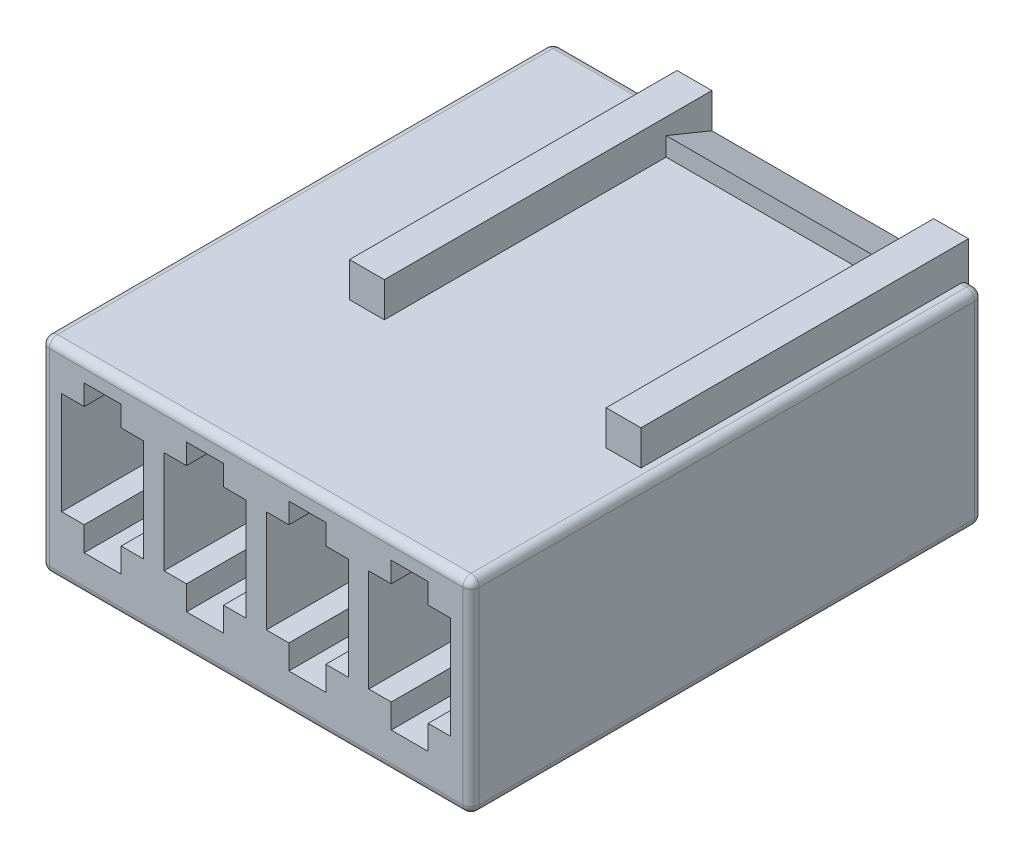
ISO-10303-21;
HEADER;
FILE_DESCRIPTION(('STEP AP214'),'2;1');
FILE_NAME('part.step','',(''),(''),'','','');
FILE_SCHEMA(('AUTOMOTIVE_DESIGN { 1 0 10303 214 1 1 1 1 }'));
ENDSEC;
DATA;
#1=APPLICATION_CONTEXT('core data for automotive mechanical design processes');
#2=APPLICATION_PROTOCOL_DEFINITION('international standard','automotive_design',2000,#1);
#3=PRODUCT_CONTEXT('',#1,'mechanical');
#4=PRODUCT('Part','Part','',(#3));
#5=PRODUCT_RELATED_PRODUCT_CATEGORY('part','',(#4));
#6=PRODUCT_DEFINITION_FORMATION('','',#4);
#7=PRODUCT_DEFINITION_CONTEXT('part definition',#1,'design');
#8=PRODUCT_DEFINITION('design','',#6,#7);
#9=PRODUCT_DEFINITION_SHAPE('','',#8);
#10=(LENGTH_UNIT() NAMED_UNIT(*) SI_UNIT(.MILLI.,.METRE.));
#11=(NAMED_UNIT(*) PLANE_ANGLE_UNIT() SI_UNIT($,.RADIAN.));
#12=(NAMED_UNIT(*) SI_UNIT($,.STERADIAN.) SOLID_ANGLE_UNIT());
#13=UNCERTAINTY_MEASURE_WITH_UNIT(LENGTH_MEASURE(1.E-05),#10,'distance_accuracy_value','');
#14=(GEOMETRIC_REPRESENTATION_CONTEXT(3) GLOBAL_UNCERTAINTY_ASSIGNED_CONTEXT((#13)) GLOBAL_UNIT_ASSIGNED_CONTEXT((#10,
#11,#12)) REPRESENTATION_CONTEXT('',''));
#15=CARTESIAN_POINT('',(0.,0.,0.));
#16=DIRECTION('',(0.,0.,1.));
#17=DIRECTION('',(1.,0.,0.));
#18=AXIS2_PLACEMENT_3D('',#15,#16,#17);
#19=CARTESIAN_POINT('',(0.,5.,12.5));
#20=DIRECTION('',(0.,-1.,0.));
#21=DIRECTION('',(1.,0.,0.));
#22=AXIS2_PLACEMENT_3D('',#19,#20,#21);
#23=PLANE('',#22);
#24=DIRECTION('',(0.,0.,-1.));
#25=VECTOR('',#24,1.);
#26=CARTESIAN_POINT('',(-0.2,5.,12.5));
#27=LINE('',#26,#25);
#28=CARTESIAN_POINT('',(-0.2,5.,12.3));
#29=VERTEX_POINT('',#28);
#30=CARTESIAN_POINT('',(-0.2,5.,0.200000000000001));
#31=VERTEX_POINT('',#30);
#32=EDGE_CURVE('E1589',#29,#31,#27,.T.);
#33=ORIENTED_EDGE('',*,*,#32,.T.);
#34=DIRECTION('',(-1.,0.,0.));
#35=VECTOR('',#34,1.);
#36=CARTESIAN_POINT('',(0.,5.,0.200000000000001));
#37=LINE('',#36,#35);
#38=CARTESIAN_POINT('',(-0.35,5.,0.200000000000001));
#39=VERTEX_POINT('',#38);
#40=EDGE_CURVE('E1592',#31,#39,#37,.T.);
#41=ORIENTED_EDGE('',*,*,#40,.T.);
#42=DIRECTION('',(0.,0.,-1.));
#43=VECTOR('',#42,1.);
#44=CARTESIAN_POINT('',(-0.35,5.,8.));
#45=LINE('',#44,#43);
#46=CARTESIAN_POINT('',(-0.35,5.,8.));
#47=VERTEX_POINT('',#46);
#48=EDGE_CURVE('E1430',#47,#39,#45,.T.);
#49=ORIENTED_EDGE('',*,*,#48,.F.);
#50=DIRECTION('',(-1.,0.,0.));
#51=VECTOR('',#50,1.);
#52=CARTESIAN_POINT('',(-0.35,5.,8.));
#53=LINE('',#52,#51);
#54=CARTESIAN_POINT('',(-1.2,5.,8.));
#55=VERTEX_POINT('',#54);
#56=EDGE_CURVE('E1420',#47,#55,#53,.T.);
#57=ORIENTED_EDGE('',*,*,#56,.T.);
#58=DIRECTION('',(0.,0.,-1.));
#59=VECTOR('',#58,1.);
#60=CARTESIAN_POINT('',(-1.2,5.,8.));
#61=LINE('',#60,#59);
#62=CARTESIAN_POINT('',(-1.2,5.,1.11635437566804));
#63=VERTEX_POINT('',#62);
#64=EDGE_CURVE('E1442',#55,#63,#61,.T.);
#65=ORIENTED_EDGE('',*,*,#64,.T.);
#66=DIRECTION('',(1.,0.,0.));
#67=VECTOR('',#66,1.);
#68=CARTESIAN_POINT('',(-500000.,5.00000000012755,1.11635437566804));
#69=LINE('',#68,#67);
#70=CARTESIAN_POINT('',(-6.61864436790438,5.,1.11635437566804));
#71=VERTEX_POINT('',#70);
#72=EDGE_CURVE('E955',#71,#63,#69,.T.);
#73=ORIENTED_EDGE('',*,*,#72,.F.);
#74=DIRECTION('',(0.,0.,-1.));
#75=VECTOR('',#74,1.);
#76=CARTESIAN_POINT('',(-6.61864436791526,5.,8.));
#77=LINE('',#76,#75);
#78=CARTESIAN_POINT('',(-6.61864436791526,5.,8.));
#79=VERTEX_POINT('',#78);
#80=EDGE_CURVE('E1399',#79,#71,#77,.T.);
#81=ORIENTED_EDGE('',*,*,#80,.F.);
#82=DIRECTION('',(-1.,0.,0.));
#83=VECTOR('',#82,1.);
#84=CARTESIAN_POINT('',(-6.61864436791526,5.,8.));
#85=LINE('',#84,#83);
#86=CARTESIAN_POINT('',(-7.46864436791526,5.,8.));
#87=VERTEX_POINT('',#86);
#88=EDGE_CURVE('E1390',#79,#87,#85,.T.);
#89=ORIENTED_EDGE('',*,*,#88,.T.);
#90=DIRECTION('',(0.,0.,-1.));
#91=VECTOR('',#90,1.);
#92=CARTESIAN_POINT('',(-7.46864436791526,5.,8.));
#93=LINE('',#92,#91);
#94=CARTESIAN_POINT('',(-7.46864436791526,5.,0.200000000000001));
#95=VERTEX_POINT('',#94);
#96=EDGE_CURVE('E1412',#87,#95,#93,.T.);
#97=ORIENTED_EDGE('',*,*,#96,.T.);
#98=DIRECTION('',(-1.,0.,0.));
#99=VECTOR('',#98,1.);
#100=CARTESIAN_POINT('',(0.,5.,0.200000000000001));
#101=LINE('',#100,#99);
#102=CARTESIAN_POINT('',(-10.3,5.,0.200000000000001));
#103=VERTEX_POINT('',#102);
#104=EDGE_CURVE('E1583',#95,#103,#101,.T.);
#105=ORIENTED_EDGE('',*,*,#104,.T.);
#106=DIRECTION('',(0.,0.,-1.));
#107=VECTOR('',#106,1.);
#108=CARTESIAN_POINT('',(-10.3,5.,12.5));
#109=LINE('',#108,#107);
#110=CARTESIAN_POINT('',(-10.3,5.,12.3));
#111=VERTEX_POINT('',#110);
#112=EDGE_CURVE('E1585',#103,#111,#109,.F.);
#113=ORIENTED_EDGE('',*,*,#112,.T.);
#114=DIRECTION('',(-1.,0.,0.));
#115=VECTOR('',#114,1.);
#116=CARTESIAN_POINT('',(0.,5.,12.3));
#117=LINE('',#116,#115);
#118=EDGE_CURVE('E1587',#111,#29,#117,.F.);
#119=ORIENTED_EDGE('',*,*,#118,.T.);
#120=EDGE_LOOP('',(#33,#41,#49,#57,#65,#73,#81,#89,#97,#105,#113,#119));
#121=FACE_BOUND('',#120,.T.);
#122=ADVANCED_FACE('F36',(#121),#23,.F.);
#123=CARTESIAN_POINT('',(-1.2,5.,8.));
#124=DIRECTION('',(-1.,0.,0.));
#125=DIRECTION('',(0.,-1.,0.));
#126=AXIS2_PLACEMENT_3D('',#123,#124,#125);
#127=PLANE('',#126);
#128=DIRECTION('',(0.,1.,0.));
#129=VECTOR('',#128,1.);
#130=CARTESIAN_POINT('',(-1.2,5.,0.));
#131=LINE('',#130,#129);
#132=CARTESIAN_POINT('',(-1.2,5.,0.));
#133=VERTEX_POINT('',#132);
#134=CARTESIAN_POINT('',(-1.2,5.85,0.));
#135=VERTEX_POINT('',#134);
#136=EDGE_CURVE('E1432',#133,#135,#131,.T.);
#137=ORIENTED_EDGE('',*,*,#136,.F.);
#138=DIRECTION('',(0.,-0.377542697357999,-0.925992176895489));
#139=VECTOR('',#138,1.);
#140=CARTESIAN_POINT('',(-1.2,5.,0.));
#141=LINE('',#140,#139);
#142=CARTESIAN_POINT('',(-1.2,5.45515659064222,1.11635437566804));
#143=VERTEX_POINT('',#142);
#144=EDGE_CURVE('E956',#143,#133,#141,.T.);
#145=ORIENTED_EDGE('',*,*,#144,.F.);
#146=DIRECTION('',(0.,1.,0.));
#147=VECTOR('',#146,1.);
#148=CARTESIAN_POINT('',(-1.2,5.45515659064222,1.11635437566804));
#149=LINE('',#148,#147);
#150=EDGE_CURVE('E959',#63,#143,#149,.T.);
#151=ORIENTED_EDGE('',*,*,#150,.F.);
#152=ORIENTED_EDGE('',*,*,#64,.F.);
#153=DIRECTION('',(0.,1.,0.));
#154=VECTOR('',#153,1.);
#155=CARTESIAN_POINT('',(-1.2,5.,8.));
#156=LINE('',#155,#154);
#157=CARTESIAN_POINT('',(-1.2,5.85,8.));
#158=VERTEX_POINT('',#157);
#159=EDGE_CURVE('E1424',#55,#158,#156,.T.);
#160=ORIENTED_EDGE('',*,*,#159,.T.);
#161=DIRECTION('',(0.,0.,-1.));
#162=VECTOR('',#161,1.);
#163=CARTESIAN_POINT('',(-1.2,5.85,8.));
#164=LINE('',#163,#162);
#165=EDGE_CURVE('E1440',#158,#135,#164,.T.);
#166=ORIENTED_EDGE('',*,*,#165,.T.);
#167=EDGE_LOOP('',(#137,#145,#151,#152,#160,#166));
#168=FACE_BOUND('',#167,.T.);
#169=ADVANCED_FACE('F1908',(#168),#127,.T.);
#170=CARTESIAN_POINT('',(-6.61864436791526,5.,8.));
#171=DIRECTION('',(1.,0.,0.));
#172=DIRECTION('',(0.,0.,-1.));
#173=AXIS2_PLACEMENT_3D('',#170,#171,#172);
#174=PLANE('',#173);
#175=DIRECTION('',(0.,-1.,0.));
#176=VECTOR('',#175,1.);
#177=CARTESIAN_POINT('',(-6.61864436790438,5.45515659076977,1.11635437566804));
#178=LINE('',#177,#176);
#179=CARTESIAN_POINT('',(-6.61864436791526,5.45515659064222,1.11635437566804));
#180=VERTEX_POINT('',#179);
#181=EDGE_CURVE('E949',#180,#71,#178,.T.);
#182=ORIENTED_EDGE('',*,*,#181,.F.);
#183=DIRECTION('',(0.,0.377542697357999,0.925992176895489));
#184=VECTOR('',#183,1.);
#185=CARTESIAN_POINT('',(-6.61864436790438,5.00000000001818,4.45922093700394E-11));
#186=LINE('',#185,#184);
#187=CARTESIAN_POINT('',(-6.61864436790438,5.,0.));
#188=VERTEX_POINT('',#187);
#189=EDGE_CURVE('E951',#188,#180,#186,.T.);
#190=ORIENTED_EDGE('',*,*,#189,.F.);
#191=DIRECTION('',(0.,-1.,0.));
#192=VECTOR('',#191,1.);
#193=CARTESIAN_POINT('',(-6.61864436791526,5.,0.));
#194=LINE('',#193,#192);
#195=CARTESIAN_POINT('',(-6.61864436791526,5.85,0.));
#196=VERTEX_POINT('',#195);
#197=EDGE_CURVE('E1386',#196,#188,#194,.T.);
#198=ORIENTED_EDGE('',*,*,#197,.F.);
#199=DIRECTION('',(0.,0.,-1.));
#200=VECTOR('',#199,1.);
#201=CARTESIAN_POINT('',(-6.61864436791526,5.85,8.));
#202=LINE('',#201,#200);
#203=CARTESIAN_POINT('',(-6.61864436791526,5.85,8.));
#204=VERTEX_POINT('',#203);
#205=EDGE_CURVE('E1407',#204,#196,#202,.T.);
#206=ORIENTED_EDGE('',*,*,#205,.F.);
#207=DIRECTION('',(0.,-1.,0.));
#208=VECTOR('',#207,1.);
#209=CARTESIAN_POINT('',(-6.61864436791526,5.,8.));
#210=LINE('',#209,#208);
#211=EDGE_CURVE('E1387',#204,#79,#210,.T.);
#212=ORIENTED_EDGE('',*,*,#211,.T.);
#213=ORIENTED_EDGE('',*,*,#80,.T.);
#214=EDGE_LOOP('',(#182,#190,#198,#206,#212,#213));
#215=FACE_BOUND('',#214,.T.);
#216=ADVANCED_FACE('F1914',(#215),#174,.T.);
#217=CARTESIAN_POINT('',(0.,0.,10.));
#218=DIRECTION('',(0.,0.,-1.));
#219=DIRECTION('',(-1.,0.,0.));
#220=AXIS2_PLACEMENT_3D('',#217,#218,#219);
#221=PLANE('',#220);
#222=DIRECTION('',(1.,0.,0.));
#223=VECTOR('',#222,1.);
#224=CARTESIAN_POINT('',(7.5,1.5,10.));
#225=LINE('',#224,#223);
#226=CARTESIAN_POINT('',(-1.04668525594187,1.5,10.));
#227=VERTEX_POINT('',#226);
#228=CARTESIAN_POINT('',(-0.49668525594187,1.5,10.));
#229=VERTEX_POINT('',#228);
#230=EDGE_CURVE('E965',#227,#229,#225,.T.);
#231=ORIENTED_EDGE('',*,*,#230,.T.);
#232=DIRECTION('',(0.,1.,0.));
#233=VECTOR('',#232,1.);
#234=CARTESIAN_POINT('',(-0.49668525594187,4.5,10.));
#235=LINE('',#234,#233);
#236=CARTESIAN_POINT('',(-0.49668525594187,4.,10.));
#237=VERTEX_POINT('',#236);
#238=EDGE_CURVE('E1353',#229,#237,#235,.T.);
#239=ORIENTED_EDGE('',*,*,#238,.T.);
#240=DIRECTION('',(1.,0.,0.));
#241=VECTOR('',#240,1.);
#242=CARTESIAN_POINT('',(7.5,4.,10.));
#243=LINE('',#242,#241);
#244=CARTESIAN_POINT('',(-0.5,4.,10.));
#245=VERTEX_POINT('',#244);
#246=EDGE_CURVE('E1005',#245,#237,#243,.T.);
#247=ORIENTED_EDGE('',*,*,#246,.F.);
#248=DIRECTION('',(0.,1.,0.));
#249=VECTOR('',#248,1.);
#250=CARTESIAN_POINT('',(-0.5,4.5,10.));
#251=LINE('',#250,#249);
#252=CARTESIAN_POINT('',(-0.5,2.5,10.));
#253=VERTEX_POINT('',#252);
#254=EDGE_CURVE('E1383',#253,#245,#251,.T.);
#255=ORIENTED_EDGE('',*,*,#254,.F.);
#256=DIRECTION('',(1.,0.,0.));
#257=VECTOR('',#256,1.);
#258=CARTESIAN_POINT('',(-2.5,2.5,10.));
#259=LINE('',#258,#257);
#260=CARTESIAN_POINT('',(-2.5,2.5,10.));
#261=VERTEX_POINT('',#260);
#262=EDGE_CURVE('E1380',#261,#253,#259,.T.);
#263=ORIENTED_EDGE('',*,*,#262,.F.);
#264=DIRECTION('',(0.,-1.,0.));
#265=VECTOR('',#264,1.);
#266=CARTESIAN_POINT('',(-2.5,4.5,10.));
#267=LINE('',#266,#265);
#268=CARTESIAN_POINT('',(-2.5,1.5,10.));
#269=VERTEX_POINT('',#268);
#270=EDGE_CURVE('E1355',#261,#269,#267,.T.);
#271=ORIENTED_EDGE('',*,*,#270,.T.);
#272=DIRECTION('',(1.,0.,0.));
#273=VECTOR('',#272,1.);
#274=CARTESIAN_POINT('',(7.5,1.5,10.));
#275=LINE('',#274,#273);
#276=CARTESIAN_POINT('',(-1.95,1.5,10.));
#277=VERTEX_POINT('',#276);
#278=EDGE_CURVE('E986',#269,#277,#275,.T.);
#279=ORIENTED_EDGE('',*,*,#278,.T.);
#280=DIRECTION('',(0.,-1.,0.));
#281=VECTOR('',#280,1.);
#282=CARTESIAN_POINT('',(-1.95,0.,10.));
#283=LINE('',#282,#281);
#284=CARTESIAN_POINT('',(-1.95,0.906480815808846,10.));
#285=VERTEX_POINT('',#284);
#286=EDGE_CURVE('E984',#277,#285,#283,.T.);
#287=ORIENTED_EDGE('',*,*,#286,.T.);
#288=DIRECTION('',(1.,0.,0.));
#289=VECTOR('',#288,1.);
#290=CARTESIAN_POINT('',(-2.5,0.906480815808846,10.));
#291=LINE('',#290,#289);
#292=CARTESIAN_POINT('',(-1.04668525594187,0.906480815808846,10.));
#293=VERTEX_POINT('',#292);
#294=EDGE_CURVE('E1358',#285,#293,#291,.T.);
#295=ORIENTED_EDGE('',*,*,#294,.T.);
#296=DIRECTION('',(0.,-1.,0.));
#297=VECTOR('',#296,1.);
#298=CARTESIAN_POINT('',(-1.04668525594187,0.,10.));
#299=LINE('',#298,#297);
#300=EDGE_CURVE('E967',#227,#293,#299,.T.);
#301=ORIENTED_EDGE('',*,*,#300,.F.);
#302=EDGE_LOOP('',(#231,#239,#247,#255,#263,#271,#279,#287,#295,#301));
#303=FACE_BOUND('',#302,.T.);
#304=ADVANCED_FACE('F1864',(#303),#221,.F.);
#305=CARTESIAN_POINT('',(-0.49668525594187,4.5,10.));
#306=DIRECTION('',(1.,0.,0.));
#307=DIRECTION('',(0.,0.,-1.));
#308=AXIS2_PLACEMENT_3D('',#305,#306,#307);
#309=PLANE('',#308);
#310=DIRECTION('',(0.,0.,1.));
#311=VECTOR('',#310,1.);
#312=CARTESIAN_POINT('',(-0.49668525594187,1.5,10.));
#313=LINE('',#312,#311);
#314=CARTESIAN_POINT('',(-0.49668525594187,1.5,12.5));
#315=VERTEX_POINT('',#314);
#316=EDGE_CURVE('E976',#229,#315,#313,.T.);
#317=ORIENTED_EDGE('',*,*,#316,.T.);
#318=DIRECTION('',(0.,1.,0.));
#319=VECTOR('',#318,1.);
#320=CARTESIAN_POINT('',(-0.49668525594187,4.5,12.5));
#321=LINE('',#320,#319);
#322=CARTESIAN_POINT('',(-0.49668525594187,4.,12.5));
#323=VERTEX_POINT('',#322);
#324=EDGE_CURVE('E1359',#315,#323,#321,.T.);
#325=ORIENTED_EDGE('',*,*,#324,.T.);
#326=DIRECTION('',(0.,0.,1.));
#327=VECTOR('',#326,1.);
#328=CARTESIAN_POINT('',(-0.49668525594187,4.,10.));
#329=LINE('',#328,#327);
#330=EDGE_CURVE('E1021',#237,#323,#329,.T.);
#331=ORIENTED_EDGE('',*,*,#330,.F.);
#332=ORIENTED_EDGE('',*,*,#238,.F.);
#333=EDGE_LOOP('',(#317,#325,#331,#332));
#334=FACE_BOUND('',#333,.T.);
#335=ADVANCED_FACE('F1879',(#334),#309,.F.);
#336=CARTESIAN_POINT('',(-2.5,4.5,0.));
#337=DIRECTION('',(-1.,0.,0.));
#338=DIRECTION('',(0.,0.,1.));
#339=AXIS2_PLACEMENT_3D('',#336,#337,#338);
#340=PLANE('',#339);
#341=DIRECTION('',(0.,-1.,0.));
#342=VECTOR('',#341,1.);
#343=CARTESIAN_POINT('',(-2.5,2.5,3.12373913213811));
#344=LINE('',#343,#342);
#345=CARTESIAN_POINT('',(-2.5,2.5,3.12373913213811));
#346=VERTEX_POINT('',#345);
#347=CARTESIAN_POINT('',(-2.5,0.2,3.12373913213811));
#348=VERTEX_POINT('',#347);
#349=EDGE_CURVE('E1684',#346,#348,#344,.T.);
#350=ORIENTED_EDGE('',*,*,#349,.T.);
#351=DIRECTION('',(0.,0.,-1.));
#352=VECTOR('',#351,1.);
#353=CARTESIAN_POINT('',(-2.5,0.2,0.));
#354=LINE('',#353,#352);
#355=CARTESIAN_POINT('',(-2.5,0.2,0.368670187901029));
#356=VERTEX_POINT('',#355);
#357=EDGE_CURVE('E1672',#348,#356,#354,.T.);
#358=ORIENTED_EDGE('',*,*,#357,.T.);
#359=DIRECTION('',(0.,-1.,0.));
#360=VECTOR('',#359,1.);
#361=CARTESIAN_POINT('',(-2.5,2.5,0.368670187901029));
#362=LINE('',#361,#360);
#363=CARTESIAN_POINT('',(-2.5,2.5,0.368670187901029));
#364=VERTEX_POINT('',#363);
#365=EDGE_CURVE('E1698',#364,#356,#362,.T.);
#366=ORIENTED_EDGE('',*,*,#365,.F.);
#367=DIRECTION('',(0.,0.,1.));
#368=VECTOR('',#367,1.);
#369=CARTESIAN_POINT('',(-2.5,2.5,0.));
#370=LINE('',#369,#368);
#371=CARTESIAN_POINT('',(-2.5,2.5,0.));
#372=VERTEX_POINT('',#371);
#373=EDGE_CURVE('E1556',#372,#364,#370,.T.);
#374=ORIENTED_EDGE('',*,*,#373,.F.);
#375=DIRECTION('',(0.,-1.,0.));
#376=VECTOR('',#375,1.);
#377=CARTESIAN_POINT('',(-2.5,4.5,0.));
#378=LINE('',#377,#376);
#379=CARTESIAN_POINT('',(-2.5,4.5,0.));
#380=VERTEX_POINT('',#379);
#381=EDGE_CURVE('E1538',#380,#372,#378,.T.);
#382=ORIENTED_EDGE('',*,*,#381,.F.);
#383=DIRECTION('',(0.,0.,1.));
#384=VECTOR('',#383,1.);
#385=CARTESIAN_POINT('',(-2.5,4.5,0.));
#386=LINE('',#385,#384);
#387=CARTESIAN_POINT('',(-2.5,4.5,10.));
#388=VERTEX_POINT('',#387);
#389=EDGE_CURVE('E1548',#380,#388,#386,.T.);
#390=ORIENTED_EDGE('',*,*,#389,.T.);
#391=DIRECTION('',(0.,1.,0.));
#392=VECTOR('',#391,1.);
#393=CARTESIAN_POINT('',(-2.5,0.,10.));
#394=LINE('',#393,#392);
#395=CARTESIAN_POINT('',(-2.5,4.,10.));
#396=VERTEX_POINT('',#395);
#397=EDGE_CURVE('E1038',#396,#388,#394,.T.);
#398=ORIENTED_EDGE('',*,*,#397,.F.);
#399=DIRECTION('',(0.,0.,1.));
#400=VECTOR('',#399,1.);
#401=CARTESIAN_POINT('',(-2.5,4.,10.));
#402=LINE('',#401,#400);
#403=CARTESIAN_POINT('',(-2.5,4.,12.5));
#404=VERTEX_POINT('',#403);
#405=EDGE_CURVE('E1046',#396,#404,#402,.T.);
#406=ORIENTED_EDGE('',*,*,#405,.T.);
#407=DIRECTION('',(0.,-1.,0.));
#408=VECTOR('',#407,1.);
#409=CARTESIAN_POINT('',(-2.5,4.5,12.5));
#410=LINE('',#409,#408);
#411=CARTESIAN_POINT('',(-2.5,1.5,12.5));
#412=VERTEX_POINT('',#411);
#413=EDGE_CURVE('E1539',#404,#412,#410,.T.);
#414=ORIENTED_EDGE('',*,*,#413,.T.);
#415=DIRECTION('',(0.,0.,1.));
#416=VECTOR('',#415,1.);
#417=CARTESIAN_POINT('',(-2.5,1.5,10.));
#418=LINE('',#417,#416);
#419=EDGE_CURVE('E997',#269,#412,#418,.T.);
#420=ORIENTED_EDGE('',*,*,#419,.F.);
#421=ORIENTED_EDGE('',*,*,#270,.F.);
#422=EDGE_CURVE('E1559',#346,#261,#370,.T.);
#423=ORIENTED_EDGE('',*,*,#422,.F.);
#424=EDGE_LOOP('',(#350,#358,#366,#374,#382,#390,#398,#406,#414,#420,#421,#423));
#425=FACE_BOUND('',#424,.T.);
#426=ADVANCED_FACE('F1693',(#425),#340,.F.);
#427=CARTESIAN_POINT('',(-2.5,0.906480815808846,10.));
#428=DIRECTION('',(0.,-1.,0.));
#429=DIRECTION('',(0.,0.,-1.));
#430=AXIS2_PLACEMENT_3D('',#427,#428,#429);
#431=PLANE('',#430);
#432=DIRECTION('',(1.,0.,0.));
#433=VECTOR('',#432,1.);
#434=CARTESIAN_POINT('',(-2.5,0.906480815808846,12.5));
#435=LINE('',#434,#433);
#436=CARTESIAN_POINT('',(-1.95,0.906480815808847,12.5));
#437=VERTEX_POINT('',#436);
#438=CARTESIAN_POINT('',(-1.04668525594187,0.906480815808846,12.5));
#439=VERTEX_POINT('',#438);
#440=EDGE_CURVE('E1312',#437,#439,#435,.T.);
#441=ORIENTED_EDGE('',*,*,#440,.T.);
#442=DIRECTION('',(0.,0.,1.));
#443=VECTOR('',#442,1.);
#444=CARTESIAN_POINT('',(-1.04668525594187,0.906480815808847,10.));
#445=LINE('',#444,#443);
#446=EDGE_CURVE('E980',#293,#439,#445,.T.);
#447=ORIENTED_EDGE('',*,*,#446,.F.);
#448=ORIENTED_EDGE('',*,*,#294,.F.);
#449=DIRECTION('',(0.,0.,1.));
#450=VECTOR('',#449,1.);
#451=CARTESIAN_POINT('',(-1.95,0.906480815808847,10.));
#452=LINE('',#451,#450);
#453=EDGE_CURVE('E993',#285,#437,#452,.T.);
#454=ORIENTED_EDGE('',*,*,#453,.T.);
#455=EDGE_LOOP('',(#441,#447,#448,#454));
#456=FACE_BOUND('',#455,.T.);
#457=ADVANCED_FACE('F1866',(#456),#431,.F.);
#458=CARTESIAN_POINT('',(-2.5,4.5,0.));
#459=DIRECTION('',(0.,1.,0.));
#460=DIRECTION('',(0.,0.,1.));
#461=AXIS2_PLACEMENT_3D('',#458,#459,#460);
#462=PLANE('',#461);
#463=DIRECTION('',(0.,0.,1.));
#464=VECTOR('',#463,1.);
#465=CARTESIAN_POINT('',(-1.04668525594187,4.5,10.));
#466=LINE('',#465,#464);
#467=CARTESIAN_POINT('',(-1.04668525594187,4.5,10.));
#468=VERTEX_POINT('',#467);
#469=CARTESIAN_POINT('',(-1.04668525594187,4.5,12.5));
#470=VERTEX_POINT('',#469);
#471=EDGE_CURVE('E1018',#468,#470,#466,.T.);
#472=ORIENTED_EDGE('',*,*,#471,.T.);
#473=DIRECTION('',(-1.,0.,0.));
#474=VECTOR('',#473,1.);
#475=CARTESIAN_POINT('',(-2.5,4.5,12.5));
#476=LINE('',#475,#474);
#477=CARTESIAN_POINT('',(-1.95,4.5,12.5));
#478=VERTEX_POINT('',#477);
#479=EDGE_CURVE('E1439',#470,#478,#476,.T.);
#480=ORIENTED_EDGE('',*,*,#479,.T.);
#481=DIRECTION('',(0.,0.,1.));
#482=VECTOR('',#481,1.);
#483=CARTESIAN_POINT('',(-1.95,4.5,10.));
#484=LINE('',#483,#482);
#485=CARTESIAN_POINT('',(-1.95,4.5,10.));
#486=VERTEX_POINT('',#485);
#487=EDGE_CURVE('E1050',#486,#478,#484,.T.);
#488=ORIENTED_EDGE('',*,*,#487,.F.);
#489=DIRECTION('',(1.,0.,0.));
#490=VECTOR('',#489,1.);
#491=CARTESIAN_POINT('',(7.5,4.5,10.));
#492=LINE('',#491,#490);
#493=EDGE_CURVE('E1035',#388,#486,#492,.T.);
#494=ORIENTED_EDGE('',*,*,#493,.F.);
#495=ORIENTED_EDGE('',*,*,#389,.F.);
#496=DIRECTION('',(-1.,0.,0.));
#497=VECTOR('',#496,1.);
#498=CARTESIAN_POINT('',(-2.5,4.5,0.));
#499=LINE('',#498,#497);
#500=CARTESIAN_POINT('',(-0.5,4.5,0.));
#501=VERTEX_POINT('',#500);
#502=EDGE_CURVE('E1535',#501,#380,#499,.T.);
#503=ORIENTED_EDGE('',*,*,#502,.F.);
#504=DIRECTION('',(0.,0.,1.));
#505=VECTOR('',#504,1.);
#506=CARTESIAN_POINT('',(-0.5,4.5,0.));
#507=LINE('',#506,#505);
#508=CARTESIAN_POINT('',(-0.5,4.5,10.));
#509=VERTEX_POINT('',#508);
#510=EDGE_CURVE('E1523',#501,#509,#507,.T.);
#511=ORIENTED_EDGE('',*,*,#510,.T.);
#512=DIRECTION('',(1.,0.,0.));
#513=VECTOR('',#512,1.);
#514=CARTESIAN_POINT('',(7.5,4.5,10.));
#515=LINE('',#514,#513);
#516=EDGE_CURVE('E1010',#468,#509,#515,.T.);
#517=ORIENTED_EDGE('',*,*,#516,.F.);
#518=EDGE_LOOP('',(#472,#480,#488,#494,#495,#503,#511,#517));
#519=FACE_BOUND('',#518,.T.);
#520=ADVANCED_FACE('F1892',(#519),#462,.F.);
#521=CARTESIAN_POINT('',(0.,0.,10.));
#522=DIRECTION('',(0.,0.,-1.));
#523=DIRECTION('',(-1.,0.,0.));
#524=AXIS2_PLACEMENT_3D('',#521,#522,#523);
#525=PLANE('',#524);
#526=DIRECTION('',(1.,0.,0.));
#527=VECTOR('',#526,1.);
#528=CARTESIAN_POINT('',(5.,1.5,10.));
#529=LINE('',#528,#527);
#530=CARTESIAN_POINT('',(-3.54668525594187,1.5,10.));
#531=VERTEX_POINT('',#530);
#532=CARTESIAN_POINT('',(-2.99668525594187,1.5,10.));
#533=VERTEX_POINT('',#532);
#534=EDGE_CURVE('E1054',#531,#533,#529,.T.);
#535=ORIENTED_EDGE('',*,*,#534,.T.);
#536=DIRECTION('',(0.,1.,0.));
#537=VECTOR('',#536,1.);
#538=CARTESIAN_POINT('',(-2.99668525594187,4.5,10.));
#539=LINE('',#538,#537);
#540=CARTESIAN_POINT('',(-2.99668525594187,4.,10.));
#541=VERTEX_POINT('',#540);
#542=EDGE_CURVE('E1341',#533,#541,#539,.T.);
#543=ORIENTED_EDGE('',*,*,#542,.T.);
#544=DIRECTION('',(1.,0.,0.));
#545=VECTOR('',#544,1.);
#546=CARTESIAN_POINT('',(5.,4.,10.));
#547=LINE('',#546,#545);
#548=CARTESIAN_POINT('',(-3.,4.,10.));
#549=VERTEX_POINT('',#548);
#550=EDGE_CURVE('E1094',#549,#541,#547,.T.);
#551=ORIENTED_EDGE('',*,*,#550,.F.);
#552=DIRECTION('',(0.,1.,0.));
#553=VECTOR('',#552,1.);
#554=CARTESIAN_POINT('',(-3.,4.5,10.));
#555=LINE('',#554,#553);
#556=CARTESIAN_POINT('',(-3.,2.5,10.));
#557=VERTEX_POINT('',#556);
#558=EDGE_CURVE('E1377',#557,#549,#555,.T.);
#559=ORIENTED_EDGE('',*,*,#558,.F.);
#560=DIRECTION('',(1.,0.,0.));
#561=VECTOR('',#560,1.);
#562=CARTESIAN_POINT('',(-5.,2.5,10.));
#563=LINE('',#562,#561);
#564=CARTESIAN_POINT('',(-5.,2.5,10.));
#565=VERTEX_POINT('',#564);
#566=EDGE_CURVE('E1374',#565,#557,#563,.T.);
#567=ORIENTED_EDGE('',*,*,#566,.F.);
#568=DIRECTION('',(0.,-1.,0.));
#569=VECTOR('',#568,1.);
#570=CARTESIAN_POINT('',(-5.,4.5,10.));
#571=LINE('',#570,#569);
#572=CARTESIAN_POINT('',(-5.,1.5,10.));
#573=VERTEX_POINT('',#572);
#574=EDGE_CURVE('E1343',#565,#573,#571,.T.);
#575=ORIENTED_EDGE('',*,*,#574,.T.);
#576=DIRECTION('',(1.,0.,0.));
#577=VECTOR('',#576,1.);
#578=CARTESIAN_POINT('',(5.,1.5,10.));
#579=LINE('',#578,#577);
#580=CARTESIAN_POINT('',(-4.45,1.5,10.));
#581=VERTEX_POINT('',#580);
#582=EDGE_CURVE('E1075',#573,#581,#579,.T.);
#583=ORIENTED_EDGE('',*,*,#582,.T.);
#584=DIRECTION('',(0.,-1.,0.));
#585=VECTOR('',#584,1.);
#586=CARTESIAN_POINT('',(-4.45,0.,10.));
#587=LINE('',#586,#585);
#588=CARTESIAN_POINT('',(-4.45,0.906480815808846,10.));
#589=VERTEX_POINT('',#588);
#590=EDGE_CURVE('E1073',#581,#589,#587,.T.);
#591=ORIENTED_EDGE('',*,*,#590,.T.);
#592=DIRECTION('',(1.,0.,0.));
#593=VECTOR('',#592,1.);
#594=CARTESIAN_POINT('',(-5.,0.906480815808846,10.));
#595=LINE('',#594,#593);
#596=CARTESIAN_POINT('',(-3.54668525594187,0.906480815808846,10.));
#597=VERTEX_POINT('',#596);
#598=EDGE_CURVE('E1346',#589,#597,#595,.T.);
#599=ORIENTED_EDGE('',*,*,#598,.T.);
#600=DIRECTION('',(0.,-1.,0.));
#601=VECTOR('',#600,1.);
#602=CARTESIAN_POINT('',(-3.54668525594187,0.,10.));
#603=LINE('',#602,#601);
#604=EDGE_CURVE('E1056',#531,#597,#603,.T.);
#605=ORIENTED_EDGE('',*,*,#604,.F.);
#606=EDGE_LOOP('',(#535,#543,#551,#559,#567,#575,#583,#591,#599,#605));
#607=FACE_BOUND('',#606,.T.);
#608=ADVANCED_FACE('F2902',(#607),#525,.F.);
#609=CARTESIAN_POINT('',(-2.99668525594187,4.5,10.));
#610=DIRECTION('',(1.,0.,0.));
#611=DIRECTION('',(0.,0.,-1.));
#612=AXIS2_PLACEMENT_3D('',#609,#610,#611);
#613=PLANE('',#612);
#614=DIRECTION('',(0.,0.,1.));
#615=VECTOR('',#614,1.);
#616=CARTESIAN_POINT('',(-2.99668525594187,1.5,10.));
#617=LINE('',#616,#615);
#618=CARTESIAN_POINT('',(-2.99668525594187,1.5,12.5));
#619=VERTEX_POINT('',#618);
#620=EDGE_CURVE('E1065',#533,#619,#617,.T.);
#621=ORIENTED_EDGE('',*,*,#620,.T.);
#622=DIRECTION('',(0.,1.,0.));
#623=VECTOR('',#622,1.);
#624=CARTESIAN_POINT('',(-2.99668525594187,4.5,12.5));
#625=LINE('',#624,#623);
#626=CARTESIAN_POINT('',(-2.99668525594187,4.,12.5));
#627=VERTEX_POINT('',#626);
#628=EDGE_CURVE('E1347',#619,#627,#625,.T.);
#629=ORIENTED_EDGE('',*,*,#628,.T.);
#630=DIRECTION('',(0.,0.,1.));
#631=VECTOR('',#630,1.);
#632=CARTESIAN_POINT('',(-2.99668525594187,4.,10.));
#633=LINE('',#632,#631);
#634=EDGE_CURVE('E1110',#541,#627,#633,.T.);
#635=ORIENTED_EDGE('',*,*,#634,.F.);
#636=ORIENTED_EDGE('',*,*,#542,.F.);
#637=EDGE_LOOP('',(#621,#629,#635,#636));
#638=FACE_BOUND('',#637,.T.);
#639=ADVANCED_FACE('F2912',(#638),#613,.F.);
#640=CARTESIAN_POINT('',(-5.,4.5,0.));
#641=DIRECTION('',(-1.,0.,0.));
#642=DIRECTION('',(0.,0.,1.));
#643=AXIS2_PLACEMENT_3D('',#640,#641,#642);
#644=PLANE('',#643);
#645=DIRECTION('',(0.,0.,1.));
#646=VECTOR('',#645,1.);
#647=CARTESIAN_POINT('',(-5.,1.5,10.));
#648=LINE('',#647,#646);
#649=CARTESIAN_POINT('',(-5.,1.5,12.5));
#650=VERTEX_POINT('',#649);
#651=EDGE_CURVE('E1086',#573,#650,#648,.T.);
#652=ORIENTED_EDGE('',*,*,#651,.F.);
#653=ORIENTED_EDGE('',*,*,#574,.F.);
#654=DIRECTION('',(0.,0.,1.));
#655=VECTOR('',#654,1.);
#656=CARTESIAN_POINT('',(-5.,2.5,0.));
#657=LINE('',#656,#655);
#658=CARTESIAN_POINT('',(-5.,2.5,0.));
#659=VERTEX_POINT('',#658);
#660=EDGE_CURVE('E1530',#659,#565,#657,.T.);
#661=ORIENTED_EDGE('',*,*,#660,.F.);
#662=DIRECTION('',(0.,-1.,0.));
#663=VECTOR('',#662,1.);
#664=CARTESIAN_POINT('',(-5.,4.5,0.));
#665=LINE('',#664,#663);
#666=CARTESIAN_POINT('',(-5.,4.5,0.));
#667=VERTEX_POINT('',#666);
#668=EDGE_CURVE('E1510',#667,#659,#665,.T.);
#669=ORIENTED_EDGE('',*,*,#668,.F.);
#670=DIRECTION('',(0.,0.,1.));
#671=VECTOR('',#670,1.);
#672=CARTESIAN_POINT('',(-5.,4.5,0.));
#673=LINE('',#672,#671);
#674=CARTESIAN_POINT('',(-5.,4.5,10.));
#675=VERTEX_POINT('',#674);
#676=EDGE_CURVE('E1520',#667,#675,#673,.T.);
#677=ORIENTED_EDGE('',*,*,#676,.T.);
#678=DIRECTION('',(0.,1.,0.));
#679=VECTOR('',#678,1.);
#680=CARTESIAN_POINT('',(-5.,0.,10.));
#681=LINE('',#680,#679);
#682=CARTESIAN_POINT('',(-5.,4.,10.));
#683=VERTEX_POINT('',#682);
#684=EDGE_CURVE('E1127',#683,#675,#681,.T.);
#685=ORIENTED_EDGE('',*,*,#684,.F.);
#686=DIRECTION('',(0.,0.,1.));
#687=VECTOR('',#686,1.);
#688=CARTESIAN_POINT('',(-5.,4.,10.));
#689=LINE('',#688,#687);
#690=CARTESIAN_POINT('',(-5.,4.,12.5));
#691=VERTEX_POINT('',#690);
#692=EDGE_CURVE('E1135',#683,#691,#689,.T.);
#693=ORIENTED_EDGE('',*,*,#692,.T.);
#694=DIRECTION('',(0.,-1.,0.));
#695=VECTOR('',#694,1.);
#696=CARTESIAN_POINT('',(-5.,4.5,12.5));
#697=LINE('',#696,#695);
#698=EDGE_CURVE('E1511',#691,#650,#697,.T.);
#699=ORIENTED_EDGE('',*,*,#698,.T.);
#700=EDGE_LOOP('',(#652,#653,#661,#669,#677,#685,#693,#699));
#701=FACE_BOUND('',#700,.T.);
#702=ADVANCED_FACE('F2922',(#701),#644,.F.);
#703=CARTESIAN_POINT('',(-5.,0.906480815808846,10.));
#704=DIRECTION('',(0.,-1.,0.));
#705=DIRECTION('',(0.,0.,-1.));
#706=AXIS2_PLACEMENT_3D('',#703,#704,#705);
#707=PLANE('',#706);
#708=DIRECTION('',(1.,0.,0.));
#709=VECTOR('',#708,1.);
#710=CARTESIAN_POINT('',(-5.,0.906480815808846,12.5));
#711=LINE('',#710,#709);
#712=CARTESIAN_POINT('',(-4.45,0.906480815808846,12.5));
#713=VERTEX_POINT('',#712);
#714=CARTESIAN_POINT('',(-3.54668525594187,0.906480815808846,12.5));
#715=VERTEX_POINT('',#714);
#716=EDGE_CURVE('E1351',#713,#715,#711,.T.);
#717=ORIENTED_EDGE('',*,*,#716,.T.);
#718=DIRECTION('',(0.,0.,1.));
#719=VECTOR('',#718,1.);
#720=CARTESIAN_POINT('',(-3.54668525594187,0.906480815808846,10.));
#721=LINE('',#720,#719);
#722=EDGE_CURVE('E1069',#597,#715,#721,.T.);
#723=ORIENTED_EDGE('',*,*,#722,.F.);
#724=ORIENTED_EDGE('',*,*,#598,.F.);
#725=DIRECTION('',(0.,0.,1.));
#726=VECTOR('',#725,1.);
#727=CARTESIAN_POINT('',(-4.45,0.906480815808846,10.));
#728=LINE('',#727,#726);
#729=EDGE_CURVE('E1082',#589,#713,#728,.T.);
#730=ORIENTED_EDGE('',*,*,#729,.T.);
#731=EDGE_LOOP('',(#717,#723,#724,#730));
#732=FACE_BOUND('',#731,.T.);
#733=ADVANCED_FACE('F2932',(#732),#707,.F.);
#734=CARTESIAN_POINT('',(-5.,4.5,0.));
#735=DIRECTION('',(0.,1.,0.));
#736=DIRECTION('',(0.,0.,1.));
#737=AXIS2_PLACEMENT_3D('',#734,#735,#736);
#738=PLANE('',#737);
#739=DIRECTION('',(0.,0.,1.));
#740=VECTOR('',#739,1.);
#741=CARTESIAN_POINT('',(-3.54668525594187,4.5,10.));
#742=LINE('',#741,#740);
#743=CARTESIAN_POINT('',(-3.54668525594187,4.5,10.));
#744=VERTEX_POINT('',#743);
#745=CARTESIAN_POINT('',(-3.54668525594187,4.5,12.5));
#746=VERTEX_POINT('',#745);
#747=EDGE_CURVE('E1107',#744,#746,#742,.T.);
#748=ORIENTED_EDGE('',*,*,#747,.T.);
#749=DIRECTION('',(-1.,0.,0.));
#750=VECTOR('',#749,1.);
#751=CARTESIAN_POINT('',(-5.,4.5,12.5));
#752=LINE('',#751,#750);
#753=CARTESIAN_POINT('',(-4.45,4.5,12.5));
#754=VERTEX_POINT('',#753);
#755=EDGE_CURVE('E1521',#746,#754,#752,.T.);
#756=ORIENTED_EDGE('',*,*,#755,.T.);
#757=DIRECTION('',(0.,0.,1.));
#758=VECTOR('',#757,1.);
#759=CARTESIAN_POINT('',(-4.45,4.5,10.));
#760=LINE('',#759,#758);
#761=CARTESIAN_POINT('',(-4.45,4.5,10.));
#762=VERTEX_POINT('',#761);
#763=EDGE_CURVE('E1139',#762,#754,#760,.T.);
#764=ORIENTED_EDGE('',*,*,#763,.F.);
#765=DIRECTION('',(1.,0.,0.));
#766=VECTOR('',#765,1.);
#767=CARTESIAN_POINT('',(5.,4.5,10.));
#768=LINE('',#767,#766);
#769=EDGE_CURVE('E1124',#675,#762,#768,.T.);
#770=ORIENTED_EDGE('',*,*,#769,.F.);
#771=ORIENTED_EDGE('',*,*,#676,.F.);
#772=DIRECTION('',(-1.,0.,0.));
#773=VECTOR('',#772,1.);
#774=CARTESIAN_POINT('',(-5.,4.5,0.));
#775=LINE('',#774,#773);
#776=CARTESIAN_POINT('',(-3.,4.5,0.));
#777=VERTEX_POINT('',#776);
#778=EDGE_CURVE('E1507',#777,#667,#775,.T.);
#779=ORIENTED_EDGE('',*,*,#778,.F.);
#780=DIRECTION('',(0.,0.,1.));
#781=VECTOR('',#780,1.);
#782=CARTESIAN_POINT('',(-3.,4.5,0.));
#783=LINE('',#782,#781);
#784=CARTESIAN_POINT('',(-3.,4.5,10.));
#785=VERTEX_POINT('',#784);
#786=EDGE_CURVE('E1495',#777,#785,#783,.T.);
#787=ORIENTED_EDGE('',*,*,#786,.T.);
#788=DIRECTION('',(1.,0.,0.));
#789=VECTOR('',#788,1.);
#790=CARTESIAN_POINT('',(5.,4.5,10.));
#791=LINE('',#790,#789);
#792=EDGE_CURVE('E1099',#744,#785,#791,.T.);
#793=ORIENTED_EDGE('',*,*,#792,.F.);
#794=EDGE_LOOP('',(#748,#756,#764,#770,#771,#779,#787,#793));
#795=FACE_BOUND('',#794,.T.);
#796=ADVANCED_FACE('F2943',(#795),#738,.F.);
#797=CARTESIAN_POINT('',(0.,0.,10.));
#798=DIRECTION('',(0.,0.,-1.));
#799=DIRECTION('',(-1.,0.,0.));
#800=AXIS2_PLACEMENT_3D('',#797,#798,#799);
#801=PLANE('',#800);
#802=DIRECTION('',(1.,0.,0.));
#803=VECTOR('',#802,1.);
#804=CARTESIAN_POINT('',(2.5,1.5,10.));
#805=LINE('',#804,#803);
#806=CARTESIAN_POINT('',(-6.04668525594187,1.5,10.));
#807=VERTEX_POINT('',#806);
#808=CARTESIAN_POINT('',(-5.49668525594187,1.5,10.));
#809=VERTEX_POINT('',#808);
#810=EDGE_CURVE('E1143',#807,#809,#805,.T.);
#811=ORIENTED_EDGE('',*,*,#810,.T.);
#812=DIRECTION('',(0.,1.,0.));
#813=VECTOR('',#812,1.);
#814=CARTESIAN_POINT('',(-5.49668525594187,4.5,10.));
#815=LINE('',#814,#813);
#816=CARTESIAN_POINT('',(-5.49668525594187,4.,10.));
#817=VERTEX_POINT('',#816);
#818=EDGE_CURVE('E1329',#809,#817,#815,.T.);
#819=ORIENTED_EDGE('',*,*,#818,.T.);
#820=DIRECTION('',(1.,0.,0.));
#821=VECTOR('',#820,1.);
#822=CARTESIAN_POINT('',(2.5,4.,10.));
#823=LINE('',#822,#821);
#824=CARTESIAN_POINT('',(-5.5,4.,10.));
#825=VERTEX_POINT('',#824);
#826=EDGE_CURVE('E1183',#825,#817,#823,.T.);
#827=ORIENTED_EDGE('',*,*,#826,.F.);
#828=DIRECTION('',(0.,1.,0.));
#829=VECTOR('',#828,1.);
#830=CARTESIAN_POINT('',(-5.5,4.5,10.));
#831=LINE('',#830,#829);
#832=CARTESIAN_POINT('',(-5.5,2.5,10.));
#833=VERTEX_POINT('',#832);
#834=EDGE_CURVE('E1371',#833,#825,#831,.T.);
#835=ORIENTED_EDGE('',*,*,#834,.F.);
#836=DIRECTION('',(1.,0.,0.));
#837=VECTOR('',#836,1.);
#838=CARTESIAN_POINT('',(-7.5,2.5,10.));
#839=LINE('',#838,#837);
#840=CARTESIAN_POINT('',(-7.5,2.5,10.));
#841=VERTEX_POINT('',#840);
#842=EDGE_CURVE('E1368',#841,#833,#839,.T.);
#843=ORIENTED_EDGE('',*,*,#842,.F.);
#844=DIRECTION('',(0.,-1.,0.));
#845=VECTOR('',#844,1.);
#846=CARTESIAN_POINT('',(-7.5,4.5,10.));
#847=LINE('',#846,#845);
#848=CARTESIAN_POINT('',(-7.5,1.5,10.));
#849=VERTEX_POINT('',#848);
#850=EDGE_CURVE('E1331',#841,#849,#847,.T.);
#851=ORIENTED_EDGE('',*,*,#850,.T.);
#852=DIRECTION('',(1.,0.,0.));
#853=VECTOR('',#852,1.);
#854=CARTESIAN_POINT('',(2.5,1.5,10.));
#855=LINE('',#854,#853);
#856=CARTESIAN_POINT('',(-6.95,1.5,10.));
#857=VERTEX_POINT('',#856);
#858=EDGE_CURVE('E1164',#849,#857,#855,.T.);
#859=ORIENTED_EDGE('',*,*,#858,.T.);
#860=DIRECTION('',(0.,-1.,0.));
#861=VECTOR('',#860,1.);
#862=CARTESIAN_POINT('',(-6.95,0.,10.));
#863=LINE('',#862,#861);
#864=CARTESIAN_POINT('',(-6.95,0.906480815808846,10.));
#865=VERTEX_POINT('',#864);
#866=EDGE_CURVE('E1162',#857,#865,#863,.T.);
#867=ORIENTED_EDGE('',*,*,#866,.T.);
#868=DIRECTION('',(1.,0.,0.));
#869=VECTOR('',#868,1.);
#870=CARTESIAN_POINT('',(-7.5,0.906480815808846,10.));
#871=LINE('',#870,#869);
#872=CARTESIAN_POINT('',(-6.04668525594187,0.906480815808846,10.));
#873=VERTEX_POINT('',#872);
#874=EDGE_CURVE('E1334',#865,#873,#871,.T.);
#875=ORIENTED_EDGE('',*,*,#874,.T.);
#876=DIRECTION('',(0.,-1.,0.));
#877=VECTOR('',#876,1.);
#878=CARTESIAN_POINT('',(-6.04668525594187,0.,10.));
#879=LINE('',#878,#877);
#880=EDGE_CURVE('E1145',#807,#873,#879,.T.);
#881=ORIENTED_EDGE('',*,*,#880,.F.);
#882=EDGE_LOOP('',(#811,#819,#827,#835,#843,#851,#859,#867,#875,#881));
#883=FACE_BOUND('',#882,.T.);
#884=ADVANCED_FACE('F2953',(#883),#801,.F.);
#885=CARTESIAN_POINT('',(-5.49668525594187,4.5,10.));
#886=DIRECTION('',(1.,0.,0.));
#887=DIRECTION('',(0.,0.,-1.));
#888=AXIS2_PLACEMENT_3D('',#885,#886,#887);
#889=PLANE('',#888);
#890=DIRECTION('',(0.,0.,1.));
#891=VECTOR('',#890,1.);
#892=CARTESIAN_POINT('',(-5.49668525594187,1.5,10.));
#893=LINE('',#892,#891);
#894=CARTESIAN_POINT('',(-5.49668525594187,1.5,12.5));
#895=VERTEX_POINT('',#894);
#896=EDGE_CURVE('E1154',#809,#895,#893,.T.);
#897=ORIENTED_EDGE('',*,*,#896,.T.);
#898=DIRECTION('',(0.,1.,0.));
#899=VECTOR('',#898,1.);
#900=CARTESIAN_POINT('',(-5.49668525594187,4.5,12.5));
#901=LINE('',#900,#899);
#902=CARTESIAN_POINT('',(-5.49668525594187,4.,12.5));
#903=VERTEX_POINT('',#902);
#904=EDGE_CURVE('E1335',#895,#903,#901,.T.);
#905=ORIENTED_EDGE('',*,*,#904,.T.);
#906=DIRECTION('',(0.,0.,1.));
#907=VECTOR('',#906,1.);
#908=CARTESIAN_POINT('',(-5.49668525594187,4.,10.));
#909=LINE('',#908,#907);
#910=EDGE_CURVE('E1199',#817,#903,#909,.T.);
#911=ORIENTED_EDGE('',*,*,#910,.F.);
#912=ORIENTED_EDGE('',*,*,#818,.F.);
#913=EDGE_LOOP('',(#897,#905,#911,#912));
#914=FACE_BOUND('',#913,.T.);
#915=ADVANCED_FACE('F2964',(#914),#889,.F.);
#916=CARTESIAN_POINT('',(-7.5,4.5,0.));
#917=DIRECTION('',(-1.,0.,0.));
#918=DIRECTION('',(0.,0.,1.));
#919=AXIS2_PLACEMENT_3D('',#916,#917,#918);
#920=PLANE('',#919);
#921=DIRECTION('',(0.,0.,1.));
#922=VECTOR('',#921,1.);
#923=CARTESIAN_POINT('',(-7.5,1.5,10.));
#924=LINE('',#923,#922);
#925=CARTESIAN_POINT('',(-7.5,1.5,12.5));
#926=VERTEX_POINT('',#925);
#927=EDGE_CURVE('E1175',#849,#926,#924,.T.);
#928=ORIENTED_EDGE('',*,*,#927,.F.);
#929=ORIENTED_EDGE('',*,*,#850,.F.);
#930=DIRECTION('',(0.,0.,1.));
#931=VECTOR('',#930,1.);
#932=CARTESIAN_POINT('',(-7.5,2.5,0.));
#933=LINE('',#932,#931);
#934=CARTESIAN_POINT('',(-7.5,2.5,0.));
#935=VERTEX_POINT('',#934);
#936=EDGE_CURVE('E1502',#935,#841,#933,.T.);
#937=ORIENTED_EDGE('',*,*,#936,.F.);
#938=DIRECTION('',(0.,-1.,0.));
#939=VECTOR('',#938,1.);
#940=CARTESIAN_POINT('',(-7.5,4.5,0.));
#941=LINE('',#940,#939);
#942=CARTESIAN_POINT('',(-7.5,4.5,0.));
#943=VERTEX_POINT('',#942);
#944=EDGE_CURVE('E1482',#943,#935,#941,.T.);
#945=ORIENTED_EDGE('',*,*,#944,.F.);
#946=DIRECTION('',(0.,0.,1.));
#947=VECTOR('',#946,1.);
#948=CARTESIAN_POINT('',(-7.5,4.5,0.));
#949=LINE('',#948,#947);
#950=CARTESIAN_POINT('',(-7.5,4.5,10.));
#951=VERTEX_POINT('',#950);
#952=EDGE_CURVE('E1492',#943,#951,#949,.T.);
#953=ORIENTED_EDGE('',*,*,#952,.T.);
#954=DIRECTION('',(0.,1.,0.));
#955=VECTOR('',#954,1.);
#956=CARTESIAN_POINT('',(-7.5,0.,10.));
#957=LINE('',#956,#955);
#958=CARTESIAN_POINT('',(-7.5,4.,10.));
#959=VERTEX_POINT('',#958);
#960=EDGE_CURVE('E1216',#959,#951,#957,.T.);
#961=ORIENTED_EDGE('',*,*,#960,.F.);
#962=DIRECTION('',(0.,0.,1.));
#963=VECTOR('',#962,1.);
#964=CARTESIAN_POINT('',(-7.5,4.,10.));
#965=LINE('',#964,#963);
#966=CARTESIAN_POINT('',(-7.5,4.,12.5));
#967=VERTEX_POINT('',#966);
#968=EDGE_CURVE('E1224',#959,#967,#965,.T.);
#969=ORIENTED_EDGE('',*,*,#968,.T.);
#970=DIRECTION('',(0.,-1.,0.));
#971=VECTOR('',#970,1.);
#972=CARTESIAN_POINT('',(-7.5,4.5,12.5));
#973=LINE('',#972,#971);
#974=EDGE_CURVE('E1483',#967,#926,#973,.T.);
#975=ORIENTED_EDGE('',*,*,#974,.T.);
#976=EDGE_LOOP('',(#928,#929,#937,#945,#953,#961,#969,#975));
#977=FACE_BOUND('',#976,.T.);
#978=ADVANCED_FACE('F2974',(#977),#920,.F.);
#979=CARTESIAN_POINT('',(-7.5,0.906480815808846,10.));
#980=DIRECTION('',(0.,-1.,0.));
#981=DIRECTION('',(0.,0.,-1.));
#982=AXIS2_PLACEMENT_3D('',#979,#980,#981);
#983=PLANE('',#982);
#984=DIRECTION('',(1.,0.,0.));
#985=VECTOR('',#984,1.);
#986=CARTESIAN_POINT('',(-7.5,0.906480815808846,12.5));
#987=LINE('',#986,#985);
#988=CARTESIAN_POINT('',(-6.95,0.906480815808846,12.5));
#989=VERTEX_POINT('',#988);
#990=CARTESIAN_POINT('',(-6.04668525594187,0.906480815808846,12.5));
#991=VERTEX_POINT('',#990);
#992=EDGE_CURVE('E1339',#989,#991,#987,.T.);
#993=ORIENTED_EDGE('',*,*,#992,.T.);
#994=DIRECTION('',(0.,0.,1.));
#995=VECTOR('',#994,1.);
#996=CARTESIAN_POINT('',(-6.04668525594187,0.906480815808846,10.));
#997=LINE('',#996,#995);
#998=EDGE_CURVE('E1158',#873,#991,#997,.T.);
#999=ORIENTED_EDGE('',*,*,#998,.F.);
#1000=ORIENTED_EDGE('',*,*,#874,.F.);
#1001=DIRECTION('',(0.,0.,1.));
#1002=VECTOR('',#1001,1.);
#1003=CARTESIAN_POINT('',(-6.95,0.906480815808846,10.));
#1004=LINE('',#1003,#1002);
#1005=EDGE_CURVE('E1171',#865,#989,#1004,.T.);
#1006=ORIENTED_EDGE('',*,*,#1005,.T.);
#1007=EDGE_LOOP('',(#993,#999,#1000,#1006));
#1008=FACE_BOUND('',#1007,.T.);
#1009=ADVANCED_FACE('F2984',(#1008),#983,.F.);
#1010=CARTESIAN_POINT('',(-7.5,4.5,0.));
#1011=DIRECTION('',(0.,1.,0.));
#1012=DIRECTION('',(0.,0.,1.));
#1013=AXIS2_PLACEMENT_3D('',#1010,#1011,#1012);
#1014=PLANE('',#1013);
#1015=DIRECTION('',(0.,0.,1.));
#1016=VECTOR('',#1015,1.);
#1017=CARTESIAN_POINT('',(-6.04668525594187,4.5,10.));
#1018=LINE('',#1017,#1016);
#1019=CARTESIAN_POINT('',(-6.04668525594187,4.5,10.));
#1020=VERTEX_POINT('',#1019);
#1021=CARTESIAN_POINT('',(-6.04668525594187,4.5,12.5));
#1022=VERTEX_POINT('',#1021);
#1023=EDGE_CURVE('E1196',#1020,#1022,#1018,.T.);
#1024=ORIENTED_EDGE('',*,*,#1023,.T.);
#1025=DIRECTION('',(-1.,0.,0.));
#1026=VECTOR('',#1025,1.);
#1027=CARTESIAN_POINT('',(-7.5,4.5,12.5));
#1028=LINE('',#1027,#1026);
#1029=CARTESIAN_POINT('',(-6.95,4.5,12.5));
#1030=VERTEX_POINT('',#1029);
#1031=EDGE_CURVE('E1493',#1022,#1030,#1028,.T.);
#1032=ORIENTED_EDGE('',*,*,#1031,.T.);
#1033=DIRECTION('',(0.,0.,1.));
#1034=VECTOR('',#1033,1.);
#1035=CARTESIAN_POINT('',(-6.95,4.5,10.));
#1036=LINE('',#1035,#1034);
#1037=CARTESIAN_POINT('',(-6.95,4.5,10.));
#1038=VERTEX_POINT('',#1037);
#1039=EDGE_CURVE('E1228',#1038,#1030,#1036,.T.);
#1040=ORIENTED_EDGE('',*,*,#1039,.F.);
#1041=DIRECTION('',(1.,0.,0.));
#1042=VECTOR('',#1041,1.);
#1043=CARTESIAN_POINT('',(2.5,4.5,10.));
#1044=LINE('',#1043,#1042);
#1045=EDGE_CURVE('E1213',#951,#1038,#1044,.T.);
#1046=ORIENTED_EDGE('',*,*,#1045,.F.);
#1047=ORIENTED_EDGE('',*,*,#952,.F.);
#1048=DIRECTION('',(-1.,0.,0.));
#1049=VECTOR('',#1048,1.);
#1050=CARTESIAN_POINT('',(-7.5,4.5,0.));
#1051=LINE('',#1050,#1049);
#1052=CARTESIAN_POINT('',(-5.5,4.5,0.));
#1053=VERTEX_POINT('',#1052);
#1054=EDGE_CURVE('E1479',#1053,#943,#1051,.T.);
#1055=ORIENTED_EDGE('',*,*,#1054,.F.);
#1056=DIRECTION('',(0.,0.,1.));
#1057=VECTOR('',#1056,1.);
#1058=CARTESIAN_POINT('',(-5.5,4.5,0.));
#1059=LINE('',#1058,#1057);
#1060=CARTESIAN_POINT('',(-5.5,4.5,10.));
#1061=VERTEX_POINT('',#1060);
#1062=EDGE_CURVE('E1463',#1053,#1061,#1059,.T.);
#1063=ORIENTED_EDGE('',*,*,#1062,.T.);
#1064=DIRECTION('',(1.,0.,0.));
#1065=VECTOR('',#1064,1.);
#1066=CARTESIAN_POINT('',(2.5,4.5,10.));
#1067=LINE('',#1066,#1065);
#1068=EDGE_CURVE('E1188',#1020,#1061,#1067,.T.);
#1069=ORIENTED_EDGE('',*,*,#1068,.F.);
#1070=EDGE_LOOP('',(#1024,#1032,#1040,#1046,#1047,#1055,#1063,#1069));
#1071=FACE_BOUND('',#1070,.T.);
#1072=ADVANCED_FACE('F2995',(#1071),#1014,.F.);
#1073=CARTESIAN_POINT('',(0.,0.,10.));
#1074=DIRECTION('',(0.,0.,1.));
#1075=DIRECTION('',(1.,0.,0.));
#1076=AXIS2_PLACEMENT_3D('',#1073,#1074,#1075);
#1077=PLANE('',#1076);
#1078=DIRECTION('',(0.,-1.,0.));
#1079=VECTOR('',#1078,1.);
#1080=CARTESIAN_POINT('',(-8.54668525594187,0.,10.));
#1081=LINE('',#1080,#1079);
#1082=CARTESIAN_POINT('',(-8.54668525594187,1.5,10.));
#1083=VERTEX_POINT('',#1082);
#1084=CARTESIAN_POINT('',(-8.54668525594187,0.906480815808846,10.));
#1085=VERTEX_POINT('',#1084);
#1086=EDGE_CURVE('E1234',#1083,#1085,#1081,.T.);
#1087=ORIENTED_EDGE('',*,*,#1086,.F.);
#1088=DIRECTION('',(1.,0.,0.));
#1089=VECTOR('',#1088,1.);
#1090=CARTESIAN_POINT('',(0.,1.5,10.));
#1091=LINE('',#1090,#1089);
#1092=CARTESIAN_POINT('',(-7.99668525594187,1.5,10.));
#1093=VERTEX_POINT('',#1092);
#1094=EDGE_CURVE('E1232',#1083,#1093,#1091,.T.);
#1095=ORIENTED_EDGE('',*,*,#1094,.T.);
#1096=DIRECTION('',(0.,1.,0.));
#1097=VECTOR('',#1096,1.);
#1098=CARTESIAN_POINT('',(-7.99668525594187,4.5,10.));
#1099=LINE('',#1098,#1097);
#1100=CARTESIAN_POINT('',(-7.99668525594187,4.,10.));
#1101=VERTEX_POINT('',#1100);
#1102=EDGE_CURVE('E1324',#1093,#1101,#1099,.T.);
#1103=ORIENTED_EDGE('',*,*,#1102,.T.);
#1104=DIRECTION('',(1.,0.,0.));
#1105=VECTOR('',#1104,1.);
#1106=CARTESIAN_POINT('',(0.,4.,10.));
#1107=LINE('',#1106,#1105);
#1108=CARTESIAN_POINT('',(-8.,4.,10.));
#1109=VERTEX_POINT('',#1108);
#1110=EDGE_CURVE('E1272',#1109,#1101,#1107,.T.);
#1111=ORIENTED_EDGE('',*,*,#1110,.F.);
#1112=DIRECTION('',(0.,-1.,0.));
#1113=VECTOR('',#1112,1.);
#1114=CARTESIAN_POINT('',(-8.,4.5,10.));
#1115=LINE('',#1114,#1113);
#1116=CARTESIAN_POINT('',(-8.,2.5,10.));
#1117=VERTEX_POINT('',#1116);
#1118=EDGE_CURVE('E1326',#1109,#1117,#1115,.T.);
#1119=ORIENTED_EDGE('',*,*,#1118,.T.);
#1120=DIRECTION('',(-1.,0.,0.));
#1121=VECTOR('',#1120,1.);
#1122=CARTESIAN_POINT('',(-10.,2.5,10.));
#1123=LINE('',#1122,#1121);
#1124=CARTESIAN_POINT('',(-10.,2.5,10.));
#1125=VERTEX_POINT('',#1124);
#1126=EDGE_CURVE('E1563',#1117,#1125,#1123,.T.);
#1127=ORIENTED_EDGE('',*,*,#1126,.T.);
#1128=DIRECTION('',(0.,-1.,0.));
#1129=VECTOR('',#1128,1.);
#1130=CARTESIAN_POINT('',(-10.,4.5,10.));
#1131=LINE('',#1130,#1129);
#1132=CARTESIAN_POINT('',(-10.,1.5,10.));
#1133=VERTEX_POINT('',#1132);
#1134=EDGE_CURVE('E1317',#1125,#1133,#1131,.T.);
#1135=ORIENTED_EDGE('',*,*,#1134,.T.);
#1136=DIRECTION('',(1.,0.,0.));
#1137=VECTOR('',#1136,1.);
#1138=CARTESIAN_POINT('',(0.,1.5,10.));
#1139=LINE('',#1138,#1137);
#1140=CARTESIAN_POINT('',(-9.45,1.5,10.));
#1141=VERTEX_POINT('',#1140);
#1142=EDGE_CURVE('E1253',#1133,#1141,#1139,.T.);
#1143=ORIENTED_EDGE('',*,*,#1142,.T.);
#1144=DIRECTION('',(0.,-1.,0.));
#1145=VECTOR('',#1144,1.);
#1146=CARTESIAN_POINT('',(-9.45,0.,10.));
#1147=LINE('',#1146,#1145);
#1148=CARTESIAN_POINT('',(-9.45,0.906480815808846,10.));
#1149=VERTEX_POINT('',#1148);
#1150=EDGE_CURVE('E1251',#1141,#1149,#1147,.T.);
#1151=ORIENTED_EDGE('',*,*,#1150,.T.);
#1152=DIRECTION('',(1.,0.,0.));
#1153=VECTOR('',#1152,1.);
#1154=CARTESIAN_POINT('',(-10.,0.906480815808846,10.));
#1155=LINE('',#1154,#1153);
#1156=EDGE_CURVE('E1320',#1149,#1085,#1155,.T.);
#1157=ORIENTED_EDGE('',*,*,#1156,.T.);
#1158=EDGE_LOOP('',(#1087,#1095,#1103,#1111,#1119,#1127,#1135,#1143,#1151,#1157));
#1159=FACE_BOUND('',#1158,.T.);
#1160=ADVANCED_FACE('F3005',(#1159),#1077,.T.);
#1161=CARTESIAN_POINT('',(-7.99668525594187,4.5,10.));
#1162=DIRECTION('',(1.,0.,0.));
#1163=DIRECTION('',(0.,0.,-1.));
#1164=AXIS2_PLACEMENT_3D('',#1161,#1162,#1163);
#1165=PLANE('',#1164);
#1166=DIRECTION('',(0.,0.,1.));
#1167=VECTOR('',#1166,1.);
#1168=CARTESIAN_POINT('',(-7.99668525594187,1.5,10.));
#1169=LINE('',#1168,#1167);
#1170=CARTESIAN_POINT('',(-7.99668525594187,1.5,12.5));
#1171=VERTEX_POINT('',#1170);
#1172=EDGE_CURVE('E1243',#1093,#1171,#1169,.T.);
#1173=ORIENTED_EDGE('',*,*,#1172,.T.);
#1174=DIRECTION('',(0.,1.,0.));
#1175=VECTOR('',#1174,1.);
#1176=CARTESIAN_POINT('',(-7.99668525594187,4.5,12.5));
#1177=LINE('',#1176,#1175);
#1178=CARTESIAN_POINT('',(-7.99668525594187,4.,12.5));
#1179=VERTEX_POINT('',#1178);
#1180=EDGE_CURVE('E1321',#1171,#1179,#1177,.T.);
#1181=ORIENTED_EDGE('',*,*,#1180,.T.);
#1182=DIRECTION('',(0.,0.,1.));
#1183=VECTOR('',#1182,1.);
#1184=CARTESIAN_POINT('',(-7.99668525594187,4.,10.));
#1185=LINE('',#1184,#1183);
#1186=EDGE_CURVE('E1288',#1101,#1179,#1185,.T.);
#1187=ORIENTED_EDGE('',*,*,#1186,.F.);
#1188=ORIENTED_EDGE('',*,*,#1102,.F.);
#1189=EDGE_LOOP('',(#1173,#1181,#1187,#1188));
#1190=FACE_BOUND('',#1189,.T.);
#1191=ADVANCED_FACE('F3097',(#1190),#1165,.F.);
#1192=CARTESIAN_POINT('',(-10.,4.5,0.));
#1193=DIRECTION('',(-1.,0.,0.));
#1194=DIRECTION('',(0.,0.,1.));
#1195=AXIS2_PLACEMENT_3D('',#1192,#1193,#1194);
#1196=PLANE('',#1195);
#1197=DIRECTION('',(0.,0.,1.));
#1198=VECTOR('',#1197,1.);
#1199=CARTESIAN_POINT('',(-10.,1.5,10.));
#1200=LINE('',#1199,#1198);
#1201=CARTESIAN_POINT('',(-10.,1.5,12.5));
#1202=VERTEX_POINT('',#1201);
#1203=EDGE_CURVE('E1264',#1133,#1202,#1200,.T.);
#1204=ORIENTED_EDGE('',*,*,#1203,.F.);
#1205=ORIENTED_EDGE('',*,*,#1134,.F.);
#1206=DIRECTION('',(0.,0.,1.));
#1207=VECTOR('',#1206,1.);
#1208=CARTESIAN_POINT('',(-10.,2.5,0.));
#1209=LINE('',#1208,#1207);
#1210=CARTESIAN_POINT('',(-10.,2.5,0.));
#1211=VERTEX_POINT('',#1210);
#1212=EDGE_CURVE('E1460',#1211,#1125,#1209,.T.);
#1213=ORIENTED_EDGE('',*,*,#1212,.F.);
#1214=DIRECTION('',(0.,-1.,0.));
#1215=VECTOR('',#1214,1.);
#1216=CARTESIAN_POINT('',(-10.,4.5,0.));
#1217=LINE('',#1216,#1215);
#1218=CARTESIAN_POINT('',(-10.,4.5,0.));
#1219=VERTEX_POINT('',#1218);
#1220=EDGE_CURVE('E1447',#1219,#1211,#1217,.T.);
#1221=ORIENTED_EDGE('',*,*,#1220,.F.);
#1222=DIRECTION('',(0.,0.,1.));
#1223=VECTOR('',#1222,1.);
#1224=CARTESIAN_POINT('',(-10.,4.5,0.));
#1225=LINE('',#1224,#1223);
#1226=CARTESIAN_POINT('',(-10.,4.5,10.));
#1227=VERTEX_POINT('',#1226);
#1228=EDGE_CURVE('E1465',#1219,#1227,#1225,.T.);
#1229=ORIENTED_EDGE('',*,*,#1228,.T.);
#1230=DIRECTION('',(0.,1.,0.));
#1231=VECTOR('',#1230,1.);
#1232=CARTESIAN_POINT('',(-10.,0.,10.));
#1233=LINE('',#1232,#1231);
#1234=CARTESIAN_POINT('',(-10.,4.,10.));
#1235=VERTEX_POINT('',#1234);
#1236=EDGE_CURVE('E1302',#1235,#1227,#1233,.T.);
#1237=ORIENTED_EDGE('',*,*,#1236,.F.);
#1238=DIRECTION('',(0.,0.,1.));
#1239=VECTOR('',#1238,1.);
#1240=CARTESIAN_POINT('',(-10.,4.,10.));
#1241=LINE('',#1240,#1239);
#1242=CARTESIAN_POINT('',(-10.,4.,12.5));
#1243=VERTEX_POINT('',#1242);
#1244=EDGE_CURVE('E1310',#1235,#1243,#1241,.T.);
#1245=ORIENTED_EDGE('',*,*,#1244,.T.);
#1246=DIRECTION('',(0.,-1.,0.));
#1247=VECTOR('',#1246,1.);
#1248=CARTESIAN_POINT('',(-10.,4.5,12.5));
#1249=LINE('',#1248,#1247);
#1250=EDGE_CURVE('E1461',#1243,#1202,#1249,.T.);
#1251=ORIENTED_EDGE('',*,*,#1250,.T.);
#1252=EDGE_LOOP('',(#1204,#1205,#1213,#1221,#1229,#1237,#1245,#1251));
#1253=FACE_BOUND('',#1252,.T.);
#1254=ADVANCED_FACE('F3089',(#1253),#1196,.F.);
#1255=CARTESIAN_POINT('',(-10.,0.906480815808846,10.));
#1256=DIRECTION('',(0.,-1.,0.));
#1257=DIRECTION('',(0.,0.,-1.));
#1258=AXIS2_PLACEMENT_3D('',#1255,#1256,#1257);
#1259=PLANE('',#1258);
#1260=DIRECTION('',(1.,0.,0.));
#1261=VECTOR('',#1260,1.);
#1262=CARTESIAN_POINT('',(-10.,0.906480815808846,12.5));
#1263=LINE('',#1262,#1261);
#1264=CARTESIAN_POINT('',(-9.45,0.906480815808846,12.5));
#1265=VERTEX_POINT('',#1264);
#1266=CARTESIAN_POINT('',(-8.54668525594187,0.906480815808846,12.5));
#1267=VERTEX_POINT('',#1266);
#1268=EDGE_CURVE('E1327',#1265,#1267,#1263,.T.);
#1269=ORIENTED_EDGE('',*,*,#1268,.T.);
#1270=DIRECTION('',(0.,0.,1.));
#1271=VECTOR('',#1270,1.);
#1272=CARTESIAN_POINT('',(-8.54668525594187,0.906480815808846,10.));
#1273=LINE('',#1272,#1271);
#1274=EDGE_CURVE('E1247',#1085,#1267,#1273,.T.);
#1275=ORIENTED_EDGE('',*,*,#1274,.F.);
#1276=ORIENTED_EDGE('',*,*,#1156,.F.);
#1277=DIRECTION('',(0.,0.,1.));
#1278=VECTOR('',#1277,1.);
#1279=CARTESIAN_POINT('',(-9.45,0.906480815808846,10.));
#1280=LINE('',#1279,#1278);
#1281=EDGE_CURVE('E1260',#1149,#1265,#1280,.T.);
#1282=ORIENTED_EDGE('',*,*,#1281,.T.);
#1283=EDGE_LOOP('',(#1269,#1275,#1276,#1282));
#1284=FACE_BOUND('',#1283,.T.);
#1285=ADVANCED_FACE('F3081',(#1284),#1259,.F.);
#1286=CARTESIAN_POINT('',(-10.,4.5,0.));
#1287=DIRECTION('',(0.,1.,0.));
#1288=DIRECTION('',(0.,0.,1.));
#1289=AXIS2_PLACEMENT_3D('',#1286,#1287,#1288);
#1290=PLANE('',#1289);
#1291=DIRECTION('',(0.,0.,1.));
#1292=VECTOR('',#1291,1.);
#1293=CARTESIAN_POINT('',(-8.54668525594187,4.5,10.));
#1294=LINE('',#1293,#1292);
#1295=CARTESIAN_POINT('',(-8.54668525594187,4.5,10.));
#1296=VERTEX_POINT('',#1295);
#1297=CARTESIAN_POINT('',(-8.54668525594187,4.5,12.5));
#1298=VERTEX_POINT('',#1297);
#1299=EDGE_CURVE('E1285',#1296,#1298,#1294,.T.);
#1300=ORIENTED_EDGE('',*,*,#1299,.T.);
#1301=DIRECTION('',(-1.,0.,0.));
#1302=VECTOR('',#1301,1.);
#1303=CARTESIAN_POINT('',(-10.,4.5,12.5));
#1304=LINE('',#1303,#1302);
#1305=CARTESIAN_POINT('',(-9.45,4.5,12.5));
#1306=VERTEX_POINT('',#1305);
#1307=EDGE_CURVE('E1451',#1298,#1306,#1304,.T.);
#1308=ORIENTED_EDGE('',*,*,#1307,.T.);
#1309=DIRECTION('',(0.,0.,1.));
#1310=VECTOR('',#1309,1.);
#1311=CARTESIAN_POINT('',(-9.45,4.5,10.));
#1312=LINE('',#1311,#1310);
#1313=CARTESIAN_POINT('',(-9.45,4.5,10.));
#1314=VERTEX_POINT('',#1313);
#1315=EDGE_CURVE('E1313',#1314,#1306,#1312,.T.);
#1316=ORIENTED_EDGE('',*,*,#1315,.F.);
#1317=DIRECTION('',(1.,0.,0.));
#1318=VECTOR('',#1317,1.);
#1319=CARTESIAN_POINT('',(0.,4.5,10.));
#1320=LINE('',#1319,#1318);
#1321=EDGE_CURVE('E1299',#1227,#1314,#1320,.T.);
#1322=ORIENTED_EDGE('',*,*,#1321,.F.);
#1323=ORIENTED_EDGE('',*,*,#1228,.F.);
#1324=DIRECTION('',(-1.,0.,0.));
#1325=VECTOR('',#1324,1.);
#1326=CARTESIAN_POINT('',(-10.,4.5,0.));
#1327=LINE('',#1326,#1325);
#1328=CARTESIAN_POINT('',(-8.,4.5,0.));
#1329=VERTEX_POINT('',#1328);
#1330=EDGE_CURVE('E1457',#1329,#1219,#1327,.T.);
#1331=ORIENTED_EDGE('',*,*,#1330,.F.);
#1332=DIRECTION('',(0.,0.,1.));
#1333=VECTOR('',#1332,1.);
#1334=CARTESIAN_POINT('',(-8.,4.5,0.));
#1335=LINE('',#1334,#1333);
#1336=CARTESIAN_POINT('',(-8.,4.5,10.));
#1337=VERTEX_POINT('',#1336);
#1338=EDGE_CURVE('E1469',#1329,#1337,#1335,.T.);
#1339=ORIENTED_EDGE('',*,*,#1338,.T.);
#1340=DIRECTION('',(1.,0.,0.));
#1341=VECTOR('',#1340,1.);
#1342=CARTESIAN_POINT('',(0.,4.5,10.));
#1343=LINE('',#1342,#1341);
#1344=EDGE_CURVE('E1277',#1296,#1337,#1343,.T.);
#1345=ORIENTED_EDGE('',*,*,#1344,.F.);
#1346=EDGE_LOOP('',(#1300,#1308,#1316,#1322,#1323,#1331,#1339,#1345));
#1347=FACE_BOUND('',#1346,.T.);
#1348=ADVANCED_FACE('F3071',(#1347),#1290,.F.);
#1349=CARTESIAN_POINT('',(-8.,4.5,0.));
#1350=DIRECTION('',(1.,0.,0.));
#1351=DIRECTION('',(0.,0.,-1.));
#1352=AXIS2_PLACEMENT_3D('',#1349,#1350,#1351);
#1353=PLANE('',#1352);
#1354=EDGE_CURVE('E1365',#1337,#1109,#1115,.T.);
#1355=ORIENTED_EDGE('',*,*,#1354,.F.);
#1356=ORIENTED_EDGE('',*,*,#1338,.F.);
#1357=DIRECTION('',(0.,1.,0.));
#1358=VECTOR('',#1357,1.);
#1359=CARTESIAN_POINT('',(-8.,4.5,0.));
#1360=LINE('',#1359,#1358);
#1361=CARTESIAN_POINT('',(-8.,2.5,0.));
#1362=VERTEX_POINT('',#1361);
#1363=EDGE_CURVE('E1454',#1362,#1329,#1360,.T.);
#1364=ORIENTED_EDGE('',*,*,#1363,.F.);
#1365=DIRECTION('',(0.,0.,1.));
#1366=VECTOR('',#1365,1.);
#1367=CARTESIAN_POINT('',(-8.,2.5,0.));
#1368=LINE('',#1367,#1366);
#1369=CARTESIAN_POINT('',(-8.,2.5,0.368670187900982));
#1370=VERTEX_POINT('',#1369);
#1371=EDGE_CURVE('E1472',#1362,#1370,#1368,.T.);
#1372=ORIENTED_EDGE('',*,*,#1371,.T.);
#1373=CARTESIAN_POINT('',(-8.,2.5,3.12373913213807));
#1374=VERTEX_POINT('',#1373);
#1375=EDGE_CURVE('E1475',#1370,#1374,#1368,.T.);
#1376=ORIENTED_EDGE('',*,*,#1375,.T.);
#1377=EDGE_CURVE('E1476',#1374,#1117,#1368,.T.);
#1378=ORIENTED_EDGE('',*,*,#1377,.T.);
#1379=ORIENTED_EDGE('',*,*,#1118,.F.);
#1380=EDGE_LOOP('',(#1355,#1356,#1364,#1372,#1376,#1378,#1379));
#1381=FACE_BOUND('',#1380,.T.);
#1382=ADVANCED_FACE('F3062',(#1381),#1353,.F.);
#1383=CARTESIAN_POINT('',(-10.,2.5,0.));
#1384=DIRECTION('',(0.,-1.,0.));
#1385=DIRECTION('',(0.,0.,-1.));
#1386=AXIS2_PLACEMENT_3D('',#1383,#1384,#1385);
#1387=PLANE('',#1386);
#1388=DIRECTION('',(0.,0.,-1.));
#1389=VECTOR('',#1388,1.);
#1390=CARTESIAN_POINT('',(-9.25,2.5,0.368670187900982));
#1391=LINE('',#1390,#1389);
#1392=CARTESIAN_POINT('',(-9.25,2.5,3.12373913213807));
#1393=VERTEX_POINT('',#1392);
#1394=CARTESIAN_POINT('',(-9.25,2.5,0.368670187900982));
#1395=VERTEX_POINT('',#1394);
#1396=EDGE_CURVE('E933',#1393,#1395,#1391,.T.);
#1397=ORIENTED_EDGE('',*,*,#1396,.T.);
#1398=DIRECTION('',(1.,0.,0.));
#1399=VECTOR('',#1398,1.);
#1400=CARTESIAN_POINT('',(-7.95,2.5,0.368670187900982));
#1401=LINE('',#1400,#1399);
#1402=EDGE_CURVE('E920',#1395,#1370,#1401,.T.);
#1403=ORIENTED_EDGE('',*,*,#1402,.T.);
#1404=ORIENTED_EDGE('',*,*,#1371,.F.);
#1405=DIRECTION('',(1.,0.,0.));
#1406=VECTOR('',#1405,1.);
#1407=CARTESIAN_POINT('',(-10.,2.5,0.));
#1408=LINE('',#1407,#1406);
#1409=EDGE_CURVE('E1450',#1211,#1362,#1408,.T.);
#1410=ORIENTED_EDGE('',*,*,#1409,.F.);
#1411=ORIENTED_EDGE('',*,*,#1212,.T.);
#1412=ORIENTED_EDGE('',*,*,#1126,.F.);
#1413=ORIENTED_EDGE('',*,*,#1377,.F.);
#1414=DIRECTION('',(-1.,0.,0.));
#1415=VECTOR('',#1414,1.);
#1416=CARTESIAN_POINT('',(-7.95,2.5,3.12373913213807));
#1417=LINE('',#1416,#1415);
#1418=EDGE_CURVE('E929',#1374,#1393,#1417,.T.);
#1419=ORIENTED_EDGE('',*,*,#1418,.T.);
#1420=EDGE_LOOP('',(#1397,#1403,#1404,#1410,#1411,#1412,#1413,#1419));
#1421=FACE_BOUND('',#1420,.T.);
#1422=ADVANCED_FACE('F1923',(#1421),#1387,.F.);
#1423=CARTESIAN_POINT('',(0.,0.,12.5));
#1424=DIRECTION('',(-1.,0.,0.));
#1425=DIRECTION('',(0.,-1.,0.));
#1426=AXIS2_PLACEMENT_3D('',#1423,#1424,#1425);
#1427=PLANE('',#1426);
#1428=DIRECTION('',(0.,0.,-1.));
#1429=VECTOR('',#1428,1.);
#1430=CARTESIAN_POINT('',(0.,4.8,12.5));
#1431=LINE('',#1430,#1429);
#1432=CARTESIAN_POINT('',(0.,4.8,0.200000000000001));
#1433=VERTEX_POINT('',#1432);
#1434=CARTESIAN_POINT('',(0.,4.8,12.3));
#1435=VERTEX_POINT('',#1434);
#1436=EDGE_CURVE('E1578',#1433,#1435,#1431,.F.);
#1437=ORIENTED_EDGE('',*,*,#1436,.T.);
#1438=DIRECTION('',(0.,1.,0.));
#1439=VECTOR('',#1438,1.);
#1440=CARTESIAN_POINT('',(0.,0.,12.3));
#1441=LINE('',#1440,#1439);
#1442=CARTESIAN_POINT('',(0.,0.2,12.3));
#1443=VERTEX_POINT('',#1442);
#1444=EDGE_CURVE('E1580',#1435,#1443,#1441,.F.);
#1445=ORIENTED_EDGE('',*,*,#1444,.T.);
#1446=DIRECTION('',(0.,0.,-1.));
#1447=VECTOR('',#1446,1.);
#1448=CARTESIAN_POINT('',(0.,0.2,12.5));
#1449=LINE('',#1448,#1447);
#1450=CARTESIAN_POINT('',(0.,0.2,0.200000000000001));
#1451=VERTEX_POINT('',#1450);
#1452=EDGE_CURVE('E1574',#1443,#1451,#1449,.T.);
#1453=ORIENTED_EDGE('',*,*,#1452,.T.);
#1454=DIRECTION('',(0.,1.,0.));
#1455=VECTOR('',#1454,1.);
#1456=CARTESIAN_POINT('',(0.,0.,0.200000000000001));
#1457=LINE('',#1456,#1455);
#1458=EDGE_CURVE('E1576',#1451,#1433,#1457,.T.);
#1459=ORIENTED_EDGE('',*,*,#1458,.T.);
#1460=EDGE_LOOP('',(#1437,#1445,#1453,#1459));
#1461=FACE_BOUND('',#1460,.T.);
#1462=ADVANCED_FACE('F1920',(#1461),#1427,.F.);
#1463=CARTESIAN_POINT('',(-10.5,0.,12.5));
#1464=DIRECTION('',(1.,0.,0.));
#1465=DIRECTION('',(0.,0.,-1.));
#1466=AXIS2_PLACEMENT_3D('',#1463,#1464,#1465);
#1467=PLANE('',#1466);
#1468=DIRECTION('',(0.,-1.,0.));
#1469=VECTOR('',#1468,1.);
#1470=CARTESIAN_POINT('',(-10.5,5.,12.3));
#1471=LINE('',#1470,#1469);
#1472=CARTESIAN_POINT('',(-10.5,0.2,12.3));
#1473=VERTEX_POINT('',#1472);
#1474=CARTESIAN_POINT('',(-10.5,4.8,12.3));
#1475=VERTEX_POINT('',#1474);
#1476=EDGE_CURVE('E55',#1473,#1475,#1471,.F.);
#1477=ORIENTED_EDGE('',*,*,#1476,.T.);
#1478=DIRECTION('',(0.,0.,-1.));
#1479=VECTOR('',#1478,1.);
#1480=CARTESIAN_POINT('',(-10.5,4.8,12.5));
#1481=LINE('',#1480,#1479);
#1482=CARTESIAN_POINT('',(-10.5,4.8,0.200000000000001));
#1483=VERTEX_POINT('',#1482);
#1484=EDGE_CURVE('E756',#1475,#1483,#1481,.T.);
#1485=ORIENTED_EDGE('',*,*,#1484,.T.);
#1486=DIRECTION('',(0.,-1.,0.));
#1487=VECTOR('',#1486,1.);
#1488=CARTESIAN_POINT('',(-10.5,0.,0.200000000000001));
#1489=LINE('',#1488,#1487);
#1490=CARTESIAN_POINT('',(-10.5,0.2,0.200000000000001));
#1491=VERTEX_POINT('',#1490);
#1492=EDGE_CURVE('E751',#1483,#1491,#1489,.T.);
#1493=ORIENTED_EDGE('',*,*,#1492,.T.);
#1494=DIRECTION('',(0.,0.,-1.));
#1495=VECTOR('',#1494,1.);
#1496=CARTESIAN_POINT('',(-10.5,0.2,12.5));
#1497=LINE('',#1496,#1495);
#1498=EDGE_CURVE('E755',#1491,#1473,#1497,.F.);
#1499=ORIENTED_EDGE('',*,*,#1498,.T.);
#1500=EDGE_LOOP('',(#1477,#1485,#1493,#1499));
#1501=FACE_BOUND('',#1500,.T.);
#1502=ADVANCED_FACE('F753',(#1501),#1467,.F.);
#1503=CARTESIAN_POINT('',(0.,0.,12.5));
#1504=DIRECTION('',(0.,1.,0.));
#1505=DIRECTION('',(0.,0.,1.));
#1506=AXIS2_PLACEMENT_3D('',#1503,#1504,#1505);
#1507=PLANE('',#1506);
#1508=DIRECTION('',(0.,0.,-1.));
#1509=VECTOR('',#1508,1.);
#1510=CARTESIAN_POINT('',(-4.95,0.,12.5));
#1511=LINE('',#1510,#1509);
#1512=CARTESIAN_POINT('',(-4.95,0.,0.200000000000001));
#1513=VERTEX_POINT('',#1512);
#1514=CARTESIAN_POINT('',(-4.95,0.,3.3237391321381));
#1515=VERTEX_POINT('',#1514);
#1516=EDGE_CURVE('E1641',#1513,#1515,#1511,.F.);
#1517=ORIENTED_EDGE('',*,*,#1516,.T.);
#1518=DIRECTION('',(-1.,0.,0.));
#1519=VECTOR('',#1518,1.);
#1520=CARTESIAN_POINT('',(0.,0.,3.3237391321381));
#1521=LINE('',#1520,#1519);
#1522=CARTESIAN_POINT('',(-3.25,0.,3.3237391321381));
#1523=VERTEX_POINT('',#1522);
#1524=EDGE_CURVE('E1643',#1515,#1523,#1521,.F.);
#1525=ORIENTED_EDGE('',*,*,#1524,.T.);
#1526=DIRECTION('',(0.,0.,1.));
#1527=VECTOR('',#1526,1.);
#1528=CARTESIAN_POINT('',(-3.25,0.,12.5));
#1529=LINE('',#1528,#1527);
#1530=CARTESIAN_POINT('',(-3.25,0.,0.200000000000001));
#1531=VERTEX_POINT('',#1530);
#1532=EDGE_CURVE('E1639',#1523,#1531,#1529,.F.);
#1533=ORIENTED_EDGE('',*,*,#1532,.T.);
#1534=DIRECTION('',(1.,0.,0.));
#1535=VECTOR('',#1534,1.);
#1536=CARTESIAN_POINT('',(0.,0.,0.200000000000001));
#1537=LINE('',#1536,#1535);
#1538=CARTESIAN_POINT('',(-2.7,0.,0.200000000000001));
#1539=VERTEX_POINT('',#1538);
#1540=EDGE_CURVE('E1635',#1531,#1539,#1537,.T.);
#1541=ORIENTED_EDGE('',*,*,#1540,.T.);
#1542=DIRECTION('',(0.,0.,-1.));
#1543=VECTOR('',#1542,1.);
#1544=CARTESIAN_POINT('',(-2.7,0.,12.5));
#1545=LINE('',#1544,#1543);
#1546=CARTESIAN_POINT('',(-2.7,0.,3.32373913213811));
#1547=VERTEX_POINT('',#1546);
#1548=EDGE_CURVE('E1631',#1539,#1547,#1545,.F.);
#1549=ORIENTED_EDGE('',*,*,#1548,.T.);
#1550=DIRECTION('',(-1.,0.,0.));
#1551=VECTOR('',#1550,1.);
#1552=CARTESIAN_POINT('',(0.,0.,3.32373913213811));
#1553=LINE('',#1552,#1551);
#1554=CARTESIAN_POINT('',(-1.,0.,3.32373913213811));
#1555=VERTEX_POINT('',#1554);
#1556=EDGE_CURVE('E1629',#1547,#1555,#1553,.F.);
#1557=ORIENTED_EDGE('',*,*,#1556,.T.);
#1558=DIRECTION('',(0.,0.,1.));
#1559=VECTOR('',#1558,1.);
#1560=CARTESIAN_POINT('',(-1.,0.,12.5));
#1561=LINE('',#1560,#1559);
#1562=CARTESIAN_POINT('',(-1.,0.,0.200000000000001));
#1563=VERTEX_POINT('',#1562);
#1564=EDGE_CURVE('E1623',#1555,#1563,#1561,.F.);
#1565=ORIENTED_EDGE('',*,*,#1564,.T.);
#1566=DIRECTION('',(1.,0.,0.));
#1567=VECTOR('',#1566,1.);
#1568=CARTESIAN_POINT('',(0.,0.,0.200000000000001));
#1569=LINE('',#1568,#1567);
#1570=CARTESIAN_POINT('',(-0.2,0.,0.200000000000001));
#1571=VERTEX_POINT('',#1570);
#1572=EDGE_CURVE('E1619',#1563,#1571,#1569,.T.);
#1573=ORIENTED_EDGE('',*,*,#1572,.T.);
#1574=DIRECTION('',(0.,0.,-1.));
#1575=VECTOR('',#1574,1.);
#1576=CARTESIAN_POINT('',(-0.2,0.,12.5));
#1577=LINE('',#1576,#1575);
#1578=CARTESIAN_POINT('',(-0.2,0.,12.3));
#1579=VERTEX_POINT('',#1578);
#1580=EDGE_CURVE('E1615',#1571,#1579,#1577,.F.);
#1581=ORIENTED_EDGE('',*,*,#1580,.T.);
#1582=DIRECTION('',(1.,0.,0.));
#1583=VECTOR('',#1582,1.);
#1584=CARTESIAN_POINT('',(-10.5,0.,12.3));
#1585=LINE('',#1584,#1583);
#1586=CARTESIAN_POINT('',(-10.3,0.,12.3));
#1587=VERTEX_POINT('',#1586);
#1588=EDGE_CURVE('E1608',#1579,#1587,#1585,.F.);
#1589=ORIENTED_EDGE('',*,*,#1588,.T.);
#1590=DIRECTION('',(0.,0.,-1.));
#1591=VECTOR('',#1590,1.);
#1592=CARTESIAN_POINT('',(-10.3,0.,12.5));
#1593=LINE('',#1592,#1591);
#1594=CARTESIAN_POINT('',(-10.3,0.,0.200000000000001));
#1595=VERTEX_POINT('',#1594);
#1596=EDGE_CURVE('E1604',#1587,#1595,#1593,.T.);
#1597=ORIENTED_EDGE('',*,*,#1596,.T.);
#1598=DIRECTION('',(1.,0.,0.));
#1599=VECTOR('',#1598,1.);
#1600=CARTESIAN_POINT('',(0.,0.,0.200000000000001));
#1601=LINE('',#1600,#1599);
#1602=CARTESIAN_POINT('',(-9.45,0.,0.200000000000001));
#1603=VERTEX_POINT('',#1602);
#1604=EDGE_CURVE('E1606',#1595,#1603,#1601,.T.);
#1605=ORIENTED_EDGE('',*,*,#1604,.T.);
#1606=DIRECTION('',(0.,0.,-1.));
#1607=VECTOR('',#1606,1.);
#1608=CARTESIAN_POINT('',(-9.45,0.,12.5));
#1609=LINE('',#1608,#1607);
#1610=CARTESIAN_POINT('',(-9.45,0.,3.32373913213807));
#1611=VERTEX_POINT('',#1610);
#1612=EDGE_CURVE('E1611',#1603,#1611,#1609,.F.);
#1613=ORIENTED_EDGE('',*,*,#1612,.T.);
#1614=DIRECTION('',(-1.,0.,0.));
#1615=VECTOR('',#1614,1.);
#1616=CARTESIAN_POINT('',(0.,0.,3.32373913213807));
#1617=LINE('',#1616,#1615);
#1618=CARTESIAN_POINT('',(-7.75,0.,3.32373913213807));
#1619=VERTEX_POINT('',#1618);
#1620=EDGE_CURVE('E1613',#1611,#1619,#1617,.F.);
#1621=ORIENTED_EDGE('',*,*,#1620,.T.);
#1622=DIRECTION('',(0.,0.,1.));
#1623=VECTOR('',#1622,1.);
#1624=CARTESIAN_POINT('',(-7.75,0.,12.5));
#1625=LINE('',#1624,#1623);
#1626=CARTESIAN_POINT('',(-7.75,0.,0.200000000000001));
#1627=VERTEX_POINT('',#1626);
#1628=EDGE_CURVE('E1617',#1619,#1627,#1625,.F.);
#1629=ORIENTED_EDGE('',*,*,#1628,.T.);
#1630=DIRECTION('',(1.,0.,0.));
#1631=VECTOR('',#1630,1.);
#1632=CARTESIAN_POINT('',(0.,0.,0.200000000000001));
#1633=LINE('',#1632,#1631);
#1634=CARTESIAN_POINT('',(-7.2,0.,0.200000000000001));
#1635=VERTEX_POINT('',#1634);
#1636=EDGE_CURVE('E1621',#1627,#1635,#1633,.T.);
#1637=ORIENTED_EDGE('',*,*,#1636,.T.);
#1638=DIRECTION('',(0.,0.,-1.));
#1639=VECTOR('',#1638,1.);
#1640=CARTESIAN_POINT('',(-7.2,0.,12.5));
#1641=LINE('',#1640,#1639);
#1642=CARTESIAN_POINT('',(-7.2,0.,3.32373913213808));
#1643=VERTEX_POINT('',#1642);
#1644=EDGE_CURVE('E1625',#1635,#1643,#1641,.F.);
#1645=ORIENTED_EDGE('',*,*,#1644,.T.);
#1646=DIRECTION('',(-1.,0.,0.));
#1647=VECTOR('',#1646,1.);
#1648=CARTESIAN_POINT('',(0.,0.,3.32373913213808));
#1649=LINE('',#1648,#1647);
#1650=CARTESIAN_POINT('',(-5.5,0.,3.32373913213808));
#1651=VERTEX_POINT('',#1650);
#1652=EDGE_CURVE('E1627',#1643,#1651,#1649,.F.);
#1653=ORIENTED_EDGE('',*,*,#1652,.T.);
#1654=DIRECTION('',(0.,0.,1.));
#1655=VECTOR('',#1654,1.);
#1656=CARTESIAN_POINT('',(-5.5,0.,12.5));
#1657=LINE('',#1656,#1655);
#1658=CARTESIAN_POINT('',(-5.5,0.,0.200000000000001));
#1659=VERTEX_POINT('',#1658);
#1660=EDGE_CURVE('E1633',#1651,#1659,#1657,.F.);
#1661=ORIENTED_EDGE('',*,*,#1660,.T.);
#1662=DIRECTION('',(1.,0.,0.));
#1663=VECTOR('',#1662,1.);
#1664=CARTESIAN_POINT('',(0.,0.,0.200000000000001));
#1665=LINE('',#1664,#1663);
#1666=EDGE_CURVE('E1637',#1659,#1513,#1665,.T.);
#1667=ORIENTED_EDGE('',*,*,#1666,.T.);
#1668=EDGE_LOOP('',(#1517,#1525,#1533,#1541,#1549,#1557,#1565,#1573,#1581,#1589,#1597,#1605,
#1613,#1621,#1629,#1637,#1645,#1653,#1661,#1667));
#1669=FACE_BOUND('',#1668,.T.);
#1670=ADVANCED_FACE('F2063',(#1669),#1507,.F.);
#1671=CARTESIAN_POINT('',(0.,0.,12.5));
#1672=DIRECTION('',(0.,0.,1.));
#1673=DIRECTION('',(1.,0.,0.));
#1674=AXIS2_PLACEMENT_3D('',#1671,#1672,#1673);
#1675=PLANE('',#1674);
#1676=DIRECTION('',(1.,0.,0.));
#1677=VECTOR('',#1676,1.);
#1678=CARTESIAN_POINT('',(0.,0.2,12.5));
#1679=LINE('',#1678,#1677);
#1680=CARTESIAN_POINT('',(-10.3,0.2,12.5));
#1681=VERTEX_POINT('',#1680);
#1682=CARTESIAN_POINT('',(-0.2,0.2,12.5));
#1683=VERTEX_POINT('',#1682);
#1684=EDGE_CURVE('E1569',#1681,#1683,#1679,.T.);
#1685=ORIENTED_EDGE('',*,*,#1684,.T.);
#1686=DIRECTION('',(0.,1.,0.));
#1687=VECTOR('',#1686,1.);
#1688=CARTESIAN_POINT('',(-0.2,5.,12.5));
#1689=LINE('',#1688,#1687);
#1690=CARTESIAN_POINT('',(-0.2,4.8,12.5));
#1691=VERTEX_POINT('',#1690);
#1692=EDGE_CURVE('E1571',#1683,#1691,#1689,.T.);
#1693=ORIENTED_EDGE('',*,*,#1692,.T.);
#1694=DIRECTION('',(-1.,0.,0.));
#1695=VECTOR('',#1694,1.);
#1696=CARTESIAN_POINT('',(-10.5,4.8,12.5));
#1697=LINE('',#1696,#1695);
#1698=CARTESIAN_POINT('',(-10.3,4.8,12.5));
#1699=VERTEX_POINT('',#1698);
#1700=EDGE_CURVE('E1565',#1691,#1699,#1697,.T.);
#1701=ORIENTED_EDGE('',*,*,#1700,.T.);
#1702=DIRECTION('',(0.,-1.,0.));
#1703=VECTOR('',#1702,1.);
#1704=CARTESIAN_POINT('',(-10.3,0.,12.5));
#1705=LINE('',#1704,#1703);
#1706=EDGE_CURVE('E1567',#1699,#1681,#1705,.T.);
#1707=ORIENTED_EDGE('',*,*,#1706,.T.);
#1708=EDGE_LOOP('',(#1685,#1693,#1701,#1707));
#1709=FACE_BOUND('',#1708,.T.);
#1710=DIRECTION('',(0.,-1.,0.));
#1711=VECTOR('',#1710,1.);
#1712=CARTESIAN_POINT('',(-1.04668525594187,0.,12.5));
#1713=LINE('',#1712,#1711);
#1714=CARTESIAN_POINT('',(-1.04668525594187,1.5,12.5));
#1715=VERTEX_POINT('',#1714);
#1716=EDGE_CURVE('E968',#1715,#439,#1713,.T.);
#1717=ORIENTED_EDGE('',*,*,#1716,.T.);
#1718=ORIENTED_EDGE('',*,*,#440,.F.);
#1719=DIRECTION('',(0.,-1.,0.));
#1720=VECTOR('',#1719,1.);
#1721=CARTESIAN_POINT('',(-1.95,0.,12.5));
#1722=LINE('',#1721,#1720);
#1723=CARTESIAN_POINT('',(-1.95,1.5,12.5));
#1724=VERTEX_POINT('',#1723);
#1725=EDGE_CURVE('E979',#1724,#437,#1722,.T.);
#1726=ORIENTED_EDGE('',*,*,#1725,.F.);
#1727=DIRECTION('',(1.,0.,0.));
#1728=VECTOR('',#1727,1.);
#1729=CARTESIAN_POINT('',(7.5,1.5,12.5));
#1730=LINE('',#1729,#1728);
#1731=EDGE_CURVE('E987',#412,#1724,#1730,.T.);
#1732=ORIENTED_EDGE('',*,*,#1731,.F.);
#1733=ORIENTED_EDGE('',*,*,#413,.F.);
#1734=DIRECTION('',(1.,0.,0.));
#1735=VECTOR('',#1734,1.);
#1736=CARTESIAN_POINT('',(7.5,4.,12.5));
#1737=LINE('',#1736,#1735);
#1738=CARTESIAN_POINT('',(-1.95,4.,12.5));
#1739=VERTEX_POINT('',#1738);
#1740=EDGE_CURVE('E1027',#404,#1739,#1737,.T.);
#1741=ORIENTED_EDGE('',*,*,#1740,.T.);
#1742=DIRECTION('',(0.,1.,0.));
#1743=VECTOR('',#1742,1.);
#1744=CARTESIAN_POINT('',(-1.95,0.,12.5));
#1745=LINE('',#1744,#1743);
#1746=EDGE_CURVE('E1032',#1739,#478,#1745,.T.);
#1747=ORIENTED_EDGE('',*,*,#1746,.T.);
#1748=ORIENTED_EDGE('',*,*,#479,.F.);
#1749=DIRECTION('',(0.,1.,0.));
#1750=VECTOR('',#1749,1.);
#1751=CARTESIAN_POINT('',(-1.04668525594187,0.,12.5));
#1752=LINE('',#1751,#1750);
#1753=CARTESIAN_POINT('',(-1.04668525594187,4.,12.5));
#1754=VERTEX_POINT('',#1753);
#1755=EDGE_CURVE('E996',#1754,#470,#1752,.T.);
#1756=ORIENTED_EDGE('',*,*,#1755,.F.);
#1757=DIRECTION('',(1.,0.,0.));
#1758=VECTOR('',#1757,1.);
#1759=CARTESIAN_POINT('',(7.5,4.,12.5));
#1760=LINE('',#1759,#1758);
#1761=EDGE_CURVE('E1006',#1754,#323,#1760,.T.);
#1762=ORIENTED_EDGE('',*,*,#1761,.T.);
#1763=ORIENTED_EDGE('',*,*,#324,.F.);
#1764=DIRECTION('',(1.,0.,0.));
#1765=VECTOR('',#1764,1.);
#1766=CARTESIAN_POINT('',(7.5,1.5,12.5));
#1767=LINE('',#1766,#1765);
#1768=EDGE_CURVE('E958',#1715,#315,#1767,.T.);
#1769=ORIENTED_EDGE('',*,*,#1768,.F.);
#1770=EDGE_LOOP('',(#1717,#1718,#1726,#1732,#1733,#1741,#1747,#1748,#1756,#1762,#1763,#1769));
#1771=FACE_BOUND('',#1770,.T.);
#1772=DIRECTION('',(0.,-1.,0.));
#1773=VECTOR('',#1772,1.);
#1774=CARTESIAN_POINT('',(-3.54668525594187,0.,12.5));
#1775=LINE('',#1774,#1773);
#1776=CARTESIAN_POINT('',(-3.54668525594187,1.5,12.5));
#1777=VERTEX_POINT('',#1776);
#1778=EDGE_CURVE('E1057',#1777,#715,#1775,.T.);
#1779=ORIENTED_EDGE('',*,*,#1778,.T.);
#1780=ORIENTED_EDGE('',*,*,#716,.F.);
#1781=DIRECTION('',(0.,-1.,0.));
#1782=VECTOR('',#1781,1.);
#1783=CARTESIAN_POINT('',(-4.45,0.,12.5));
#1784=LINE('',#1783,#1782);
#1785=CARTESIAN_POINT('',(-4.45,1.5,12.5));
#1786=VERTEX_POINT('',#1785);
#1787=EDGE_CURVE('E1068',#1786,#713,#1784,.T.);
#1788=ORIENTED_EDGE('',*,*,#1787,.F.);
#1789=DIRECTION('',(1.,0.,0.));
#1790=VECTOR('',#1789,1.);
#1791=CARTESIAN_POINT('',(5.,1.5,12.5));
#1792=LINE('',#1791,#1790);
#1793=EDGE_CURVE('E1076',#650,#1786,#1792,.T.);
#1794=ORIENTED_EDGE('',*,*,#1793,.F.);
#1795=ORIENTED_EDGE('',*,*,#698,.F.);
#1796=DIRECTION('',(1.,0.,0.));
#1797=VECTOR('',#1796,1.);
#1798=CARTESIAN_POINT('',(5.,4.,12.5));
#1799=LINE('',#1798,#1797);
#1800=CARTESIAN_POINT('',(-4.45,4.,12.5));
#1801=VERTEX_POINT('',#1800);
#1802=EDGE_CURVE('E1116',#691,#1801,#1799,.T.);
#1803=ORIENTED_EDGE('',*,*,#1802,.T.);
#1804=DIRECTION('',(0.,1.,0.));
#1805=VECTOR('',#1804,1.);
#1806=CARTESIAN_POINT('',(-4.45,0.,12.5));
#1807=LINE('',#1806,#1805);
#1808=EDGE_CURVE('E1121',#1801,#754,#1807,.T.);
#1809=ORIENTED_EDGE('',*,*,#1808,.T.);
#1810=ORIENTED_EDGE('',*,*,#755,.F.);
#1811=DIRECTION('',(0.,1.,0.));
#1812=VECTOR('',#1811,1.);
#1813=CARTESIAN_POINT('',(-3.54668525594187,0.,12.5));
#1814=LINE('',#1813,#1812);
#1815=CARTESIAN_POINT('',(-3.54668525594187,4.,12.5));
#1816=VERTEX_POINT('',#1815);
#1817=EDGE_CURVE('E1085',#1816,#746,#1814,.T.);
#1818=ORIENTED_EDGE('',*,*,#1817,.F.);
#1819=DIRECTION('',(1.,0.,0.));
#1820=VECTOR('',#1819,1.);
#1821=CARTESIAN_POINT('',(5.,4.,12.5));
#1822=LINE('',#1821,#1820);
#1823=EDGE_CURVE('E1095',#1816,#627,#1822,.T.);
#1824=ORIENTED_EDGE('',*,*,#1823,.T.);
#1825=ORIENTED_EDGE('',*,*,#628,.F.);
#1826=DIRECTION('',(1.,0.,0.));
#1827=VECTOR('',#1826,1.);
#1828=CARTESIAN_POINT('',(5.,1.5,12.5));
#1829=LINE('',#1828,#1827);
#1830=EDGE_CURVE('E1049',#1777,#619,#1829,.T.);
#1831=ORIENTED_EDGE('',*,*,#1830,.F.);
#1832=EDGE_LOOP('',(#1779,#1780,#1788,#1794,#1795,#1803,#1809,#1810,#1818,#1824,#1825,#1831));
#1833=FACE_BOUND('',#1832,.T.);
#1834=DIRECTION('',(0.,-1.,0.));
#1835=VECTOR('',#1834,1.);
#1836=CARTESIAN_POINT('',(-6.04668525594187,0.,12.5));
#1837=LINE('',#1836,#1835);
#1838=CARTESIAN_POINT('',(-6.04668525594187,1.5,12.5));
#1839=VERTEX_POINT('',#1838);
#1840=EDGE_CURVE('E1146',#1839,#991,#1837,.T.);
#1841=ORIENTED_EDGE('',*,*,#1840,.T.);
#1842=ORIENTED_EDGE('',*,*,#992,.F.);
#1843=DIRECTION('',(0.,-1.,0.));
#1844=VECTOR('',#1843,1.);
#1845=CARTESIAN_POINT('',(-6.95,0.,12.5));
#1846=LINE('',#1845,#1844);
#1847=CARTESIAN_POINT('',(-6.95,1.5,12.5));
#1848=VERTEX_POINT('',#1847);
#1849=EDGE_CURVE('E1157',#1848,#989,#1846,.T.);
#1850=ORIENTED_EDGE('',*,*,#1849,.F.);
#1851=DIRECTION('',(1.,0.,0.));
#1852=VECTOR('',#1851,1.);
#1853=CARTESIAN_POINT('',(2.5,1.5,12.5));
#1854=LINE('',#1853,#1852);
#1855=EDGE_CURVE('E1165',#926,#1848,#1854,.T.);
#1856=ORIENTED_EDGE('',*,*,#1855,.F.);
#1857=ORIENTED_EDGE('',*,*,#974,.F.);
#1858=DIRECTION('',(1.,0.,0.));
#1859=VECTOR('',#1858,1.);
#1860=CARTESIAN_POINT('',(2.5,4.,12.5));
#1861=LINE('',#1860,#1859);
#1862=CARTESIAN_POINT('',(-6.95,4.,12.5));
#1863=VERTEX_POINT('',#1862);
#1864=EDGE_CURVE('E1205',#967,#1863,#1861,.T.);
#1865=ORIENTED_EDGE('',*,*,#1864,.T.);
#1866=DIRECTION('',(0.,1.,0.));
#1867=VECTOR('',#1866,1.);
#1868=CARTESIAN_POINT('',(-6.95,0.,12.5));
#1869=LINE('',#1868,#1867);
#1870=EDGE_CURVE('E1210',#1863,#1030,#1869,.T.);
#1871=ORIENTED_EDGE('',*,*,#1870,.T.);
#1872=ORIENTED_EDGE('',*,*,#1031,.F.);
#1873=DIRECTION('',(0.,1.,0.));
#1874=VECTOR('',#1873,1.);
#1875=CARTESIAN_POINT('',(-6.04668525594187,0.,12.5));
#1876=LINE('',#1875,#1874);
#1877=CARTESIAN_POINT('',(-6.04668525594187,4.,12.5));
#1878=VERTEX_POINT('',#1877);
#1879=EDGE_CURVE('E1174',#1878,#1022,#1876,.T.);
#1880=ORIENTED_EDGE('',*,*,#1879,.F.);
#1881=DIRECTION('',(1.,0.,0.));
#1882=VECTOR('',#1881,1.);
#1883=CARTESIAN_POINT('',(2.5,4.,12.5));
#1884=LINE('',#1883,#1882);
#1885=EDGE_CURVE('E1184',#1878,#903,#1884,.T.);
#1886=ORIENTED_EDGE('',*,*,#1885,.T.);
#1887=ORIENTED_EDGE('',*,*,#904,.F.);
#1888=DIRECTION('',(1.,0.,0.));
#1889=VECTOR('',#1888,1.);
#1890=CARTESIAN_POINT('',(2.5,1.5,12.5));
#1891=LINE('',#1890,#1889);
#1892=EDGE_CURVE('E1138',#1839,#895,#1891,.T.);
#1893=ORIENTED_EDGE('',*,*,#1892,.F.);
#1894=EDGE_LOOP('',(#1841,#1842,#1850,#1856,#1857,#1865,#1871,#1872,#1880,#1886,#1887,#1893));
#1895=FACE_BOUND('',#1894,.T.);
#1896=DIRECTION('',(0.,-1.,0.));
#1897=VECTOR('',#1896,1.);
#1898=CARTESIAN_POINT('',(-8.54668525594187,0.,12.5));
#1899=LINE('',#1898,#1897);
#1900=CARTESIAN_POINT('',(-8.54668525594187,1.5,12.5));
#1901=VERTEX_POINT('',#1900);
#1902=EDGE_CURVE('E1235',#1901,#1267,#1899,.T.);
#1903=ORIENTED_EDGE('',*,*,#1902,.T.);
#1904=ORIENTED_EDGE('',*,*,#1268,.F.);
#1905=DIRECTION('',(0.,-1.,0.));
#1906=VECTOR('',#1905,1.);
#1907=CARTESIAN_POINT('',(-9.45,0.,12.5));
#1908=LINE('',#1907,#1906);
#1909=CARTESIAN_POINT('',(-9.45,1.5,12.5));
#1910=VERTEX_POINT('',#1909);
#1911=EDGE_CURVE('E1246',#1910,#1265,#1908,.T.);
#1912=ORIENTED_EDGE('',*,*,#1911,.F.);
#1913=DIRECTION('',(1.,0.,0.));
#1914=VECTOR('',#1913,1.);
#1915=CARTESIAN_POINT('',(0.,1.5,12.5));
#1916=LINE('',#1915,#1914);
#1917=EDGE_CURVE('E1254',#1202,#1910,#1916,.T.);
#1918=ORIENTED_EDGE('',*,*,#1917,.F.);
#1919=ORIENTED_EDGE('',*,*,#1250,.F.);
#1920=DIRECTION('',(1.,0.,0.));
#1921=VECTOR('',#1920,1.);
#1922=CARTESIAN_POINT('',(0.,4.,12.5));
#1923=LINE('',#1922,#1921);
#1924=CARTESIAN_POINT('',(-9.45,4.,12.5));
#1925=VERTEX_POINT('',#1924);
#1926=EDGE_CURVE('E1287',#1243,#1925,#1923,.T.);
#1927=ORIENTED_EDGE('',*,*,#1926,.T.);
#1928=DIRECTION('',(0.,1.,0.));
#1929=VECTOR('',#1928,1.);
#1930=CARTESIAN_POINT('',(-9.45,0.,12.5));
#1931=LINE('',#1930,#1929);
#1932=EDGE_CURVE('E1296',#1925,#1306,#1931,.T.);
#1933=ORIENTED_EDGE('',*,*,#1932,.T.);
#1934=ORIENTED_EDGE('',*,*,#1307,.F.);
#1935=DIRECTION('',(0.,1.,0.));
#1936=VECTOR('',#1935,1.);
#1937=CARTESIAN_POINT('',(-8.54668525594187,0.,12.5));
#1938=LINE('',#1937,#1936);
#1939=CARTESIAN_POINT('',(-8.54668525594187,4.,12.5));
#1940=VERTEX_POINT('',#1939);
#1941=EDGE_CURVE('E1263',#1940,#1298,#1938,.T.);
#1942=ORIENTED_EDGE('',*,*,#1941,.F.);
#1943=DIRECTION('',(1.,0.,0.));
#1944=VECTOR('',#1943,1.);
#1945=CARTESIAN_POINT('',(0.,4.,12.5));
#1946=LINE('',#1945,#1944);
#1947=EDGE_CURVE('E1273',#1940,#1179,#1946,.T.);
#1948=ORIENTED_EDGE('',*,*,#1947,.T.);
#1949=ORIENTED_EDGE('',*,*,#1180,.F.);
#1950=DIRECTION('',(1.,0.,0.));
#1951=VECTOR('',#1950,1.);
#1952=CARTESIAN_POINT('',(0.,1.5,12.5));
#1953=LINE('',#1952,#1951);
#1954=EDGE_CURVE('E1227',#1901,#1171,#1953,.T.);
#1955=ORIENTED_EDGE('',*,*,#1954,.F.);
#1956=EDGE_LOOP('',(#1903,#1904,#1912,#1918,#1919,#1927,#1933,#1934,#1942,#1948,#1949,#1955));
#1957=FACE_BOUND('',#1956,.T.);
#1958=ADVANCED_FACE('F1856',(#1709,#1771,#1833,#1895,#1957),#1675,.T.);
#1959=CARTESIAN_POINT('',(0.,0.,0.));
#1960=DIRECTION('',(0.,0.,1.));
#1961=DIRECTION('',(1.,0.,0.));
#1962=AXIS2_PLACEMENT_3D('',#1959,#1960,#1961);
#1963=PLANE('',#1962);
#1964=ORIENTED_EDGE('',*,*,#1330,.T.);
#1965=ORIENTED_EDGE('',*,*,#1220,.T.);
#1966=ORIENTED_EDGE('',*,*,#1409,.T.);
#1967=ORIENTED_EDGE('',*,*,#1363,.T.);
#1968=EDGE_LOOP('',(#1964,#1965,#1966,#1967));
#1969=FACE_BOUND('',#1968,.T.);
#1970=DIRECTION('',(0.,1.,0.));
#1971=VECTOR('',#1970,1.);
#1972=CARTESIAN_POINT('',(-5.5,4.5,0.));
#1973=LINE('',#1972,#1971);
#1974=CARTESIAN_POINT('',(-5.5,2.5,0.));
#1975=VERTEX_POINT('',#1974);
#1976=EDGE_CURVE('E1489',#1975,#1053,#1973,.T.);
#1977=ORIENTED_EDGE('',*,*,#1976,.T.);
#1978=ORIENTED_EDGE('',*,*,#1054,.T.);
#1979=ORIENTED_EDGE('',*,*,#944,.T.);
#1980=DIRECTION('',(1.,0.,0.));
#1981=VECTOR('',#1980,1.);
#1982=CARTESIAN_POINT('',(-7.5,2.5,0.));
#1983=LINE('',#1982,#1981);
#1984=EDGE_CURVE('E1486',#935,#1975,#1983,.T.);
#1985=ORIENTED_EDGE('',*,*,#1984,.T.);
#1986=EDGE_LOOP('',(#1977,#1978,#1979,#1985));
#1987=FACE_BOUND('',#1986,.T.);
#1988=DIRECTION('',(0.,1.,0.));
#1989=VECTOR('',#1988,1.);
#1990=CARTESIAN_POINT('',(-3.,4.5,0.));
#1991=LINE('',#1990,#1989);
#1992=CARTESIAN_POINT('',(-3.,2.5,0.));
#1993=VERTEX_POINT('',#1992);
#1994=EDGE_CURVE('E1517',#1993,#777,#1991,.T.);
#1995=ORIENTED_EDGE('',*,*,#1994,.T.);
#1996=ORIENTED_EDGE('',*,*,#778,.T.);
#1997=ORIENTED_EDGE('',*,*,#668,.T.);
#1998=DIRECTION('',(1.,0.,0.));
#1999=VECTOR('',#1998,1.);
#2000=CARTESIAN_POINT('',(-5.,2.5,0.));
#2001=LINE('',#2000,#1999);
#2002=EDGE_CURVE('E1514',#659,#1993,#2001,.T.);
#2003=ORIENTED_EDGE('',*,*,#2002,.T.);
#2004=EDGE_LOOP('',(#1995,#1996,#1997,#2003));
#2005=FACE_BOUND('',#2004,.T.);
#2006=DIRECTION('',(0.,1.,0.));
#2007=VECTOR('',#2006,1.);
#2008=CARTESIAN_POINT('',(-0.5,4.5,0.));
#2009=LINE('',#2008,#2007);
#2010=CARTESIAN_POINT('',(-0.5,2.5,0.));
#2011=VERTEX_POINT('',#2010);
#2012=EDGE_CURVE('E1545',#2011,#501,#2009,.T.);
#2013=ORIENTED_EDGE('',*,*,#2012,.T.);
#2014=ORIENTED_EDGE('',*,*,#502,.T.);
#2015=ORIENTED_EDGE('',*,*,#381,.T.);
#2016=DIRECTION('',(1.,0.,0.));
#2017=VECTOR('',#2016,1.);
#2018=CARTESIAN_POINT('',(-2.5,2.5,0.));
#2019=LINE('',#2018,#2017);
#2020=EDGE_CURVE('E1542',#372,#2011,#2019,.T.);
#2021=ORIENTED_EDGE('',*,*,#2020,.T.);
#2022=EDGE_LOOP('',(#2013,#2014,#2015,#2021));
#2023=FACE_BOUND('',#2022,.T.);
#2024=DIRECTION('',(0.,-1.,0.));
#2025=VECTOR('',#2024,1.);
#2026=CARTESIAN_POINT('',(-0.35,5.,0.));
#2027=LINE('',#2026,#2025);
#2028=CARTESIAN_POINT('',(-0.35,5.85,0.));
#2029=VERTEX_POINT('',#2028);
#2030=CARTESIAN_POINT('',(-0.35,4.8,0.));
#2031=VERTEX_POINT('',#2030);
#2032=EDGE_CURVE('E1409',#2029,#2031,#2027,.T.);
#2033=ORIENTED_EDGE('',*,*,#2032,.T.);
#2034=DIRECTION('',(-1.,0.,0.));
#2035=VECTOR('',#2034,1.);
#2036=CARTESIAN_POINT('',(0.,4.8,0.));
#2037=LINE('',#2036,#2035);
#2038=CARTESIAN_POINT('',(-0.2,4.8,0.));
#2039=VERTEX_POINT('',#2038);
#2040=EDGE_CURVE('E1602',#2031,#2039,#2037,.F.);
#2041=ORIENTED_EDGE('',*,*,#2040,.T.);
#2042=DIRECTION('',(0.,1.,0.));
#2043=VECTOR('',#2042,1.);
#2044=CARTESIAN_POINT('',(-0.2,0.,0.));
#2045=LINE('',#2044,#2043);
#2046=CARTESIAN_POINT('',(-0.2,0.2,0.));
#2047=VERTEX_POINT('',#2046);
#2048=EDGE_CURVE('E1600',#2039,#2047,#2045,.F.);
#2049=ORIENTED_EDGE('',*,*,#2048,.T.);
#2050=DIRECTION('',(1.,0.,0.));
#2051=VECTOR('',#2050,1.);
#2052=CARTESIAN_POINT('',(0.,0.2,0.));
#2053=LINE('',#2052,#2051);
#2054=CARTESIAN_POINT('',(-10.3,0.2,0.));
#2055=VERTEX_POINT('',#2054);
#2056=EDGE_CURVE('E1598',#2047,#2055,#2053,.F.);
#2057=ORIENTED_EDGE('',*,*,#2056,.T.);
#2058=DIRECTION('',(0.,-1.,0.));
#2059=VECTOR('',#2058,1.);
#2060=CARTESIAN_POINT('',(-10.3,0.,0.));
#2061=LINE('',#2060,#2059);
#2062=CARTESIAN_POINT('',(-10.3,4.8,0.));
#2063=VERTEX_POINT('',#2062);
#2064=EDGE_CURVE('E766',#2055,#2063,#2061,.F.);
#2065=ORIENTED_EDGE('',*,*,#2064,.T.);
#2066=DIRECTION('',(-1.,0.,0.));
#2067=VECTOR('',#2066,1.);
#2068=CARTESIAN_POINT('',(0.,4.8,0.));
#2069=LINE('',#2068,#2067);
#2070=CARTESIAN_POINT('',(-7.46864436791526,4.8,0.));
#2071=VERTEX_POINT('',#2070);
#2072=EDGE_CURVE('E1594',#2063,#2071,#2069,.F.);
#2073=ORIENTED_EDGE('',*,*,#2072,.T.);
#2074=DIRECTION('',(0.,1.,0.));
#2075=VECTOR('',#2074,1.);
#2076=CARTESIAN_POINT('',(-7.46864436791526,5.,0.));
#2077=LINE('',#2076,#2075);
#2078=CARTESIAN_POINT('',(-7.46864436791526,5.85,0.));
#2079=VERTEX_POINT('',#2078);
#2080=EDGE_CURVE('E1402',#2071,#2079,#2077,.T.);
#2081=ORIENTED_EDGE('',*,*,#2080,.T.);
#2082=DIRECTION('',(1.,0.,0.));
#2083=VECTOR('',#2082,1.);
#2084=CARTESIAN_POINT('',(-6.61864436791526,5.85,0.));
#2085=LINE('',#2084,#2083);
#2086=EDGE_CURVE('E1391',#2079,#196,#2085,.T.);
#2087=ORIENTED_EDGE('',*,*,#2086,.T.);
#2088=ORIENTED_EDGE('',*,*,#197,.T.);
#2089=DIRECTION('',(-1.,0.,0.));
#2090=VECTOR('',#2089,1.);
#2091=CARTESIAN_POINT('',(0.,5.,0.));
#2092=LINE('',#2091,#2090);
#2093=EDGE_CURVE('E1468',#133,#188,#2092,.T.);
#2094=ORIENTED_EDGE('',*,*,#2093,.F.);
#2095=ORIENTED_EDGE('',*,*,#136,.T.);
#2096=DIRECTION('',(1.,0.,0.));
#2097=VECTOR('',#2096,1.);
#2098=CARTESIAN_POINT('',(-0.35,5.85,0.));
#2099=LINE('',#2098,#2097);
#2100=EDGE_CURVE('E1421',#135,#2029,#2099,.T.);
#2101=ORIENTED_EDGE('',*,*,#2100,.T.);
#2102=EDGE_LOOP('',(#2033,#2041,#2049,#2057,#2065,#2073,#2081,#2087,#2088,#2094,#2095,#2101));
#2103=FACE_BOUND('',#2102,.T.);
#2104=ADVANCED_FACE('F1836',(#1969,#1987,#2005,#2023,#2103),#1963,.F.);
#2105=CARTESIAN_POINT('',(-0.5,4.5,0.));
#2106=DIRECTION('',(1.,0.,0.));
#2107=DIRECTION('',(0.,0.,-1.));
#2108=AXIS2_PLACEMENT_3D('',#2105,#2106,#2107);
#2109=PLANE('',#2108);
#2110=DIRECTION('',(0.,0.,1.));
#2111=VECTOR('',#2110,1.);
#2112=CARTESIAN_POINT('',(-0.5,2.5,0.));
#2113=LINE('',#2112,#2111);
#2114=EDGE_CURVE('E1553',#2011,#253,#2113,.T.);
#2115=ORIENTED_EDGE('',*,*,#2114,.T.);
#2116=ORIENTED_EDGE('',*,*,#254,.T.);
#2117=DIRECTION('',(0.,-1.,0.));
#2118=VECTOR('',#2117,1.);
#2119=CARTESIAN_POINT('',(-0.5,4.5,10.));
#2120=LINE('',#2119,#2118);
#2121=EDGE_CURVE('E1020',#509,#245,#2120,.T.);
#2122=ORIENTED_EDGE('',*,*,#2121,.F.);
#2123=ORIENTED_EDGE('',*,*,#510,.F.);
#2124=ORIENTED_EDGE('',*,*,#2012,.F.);
#2125=EDGE_LOOP('',(#2115,#2116,#2122,#2123,#2124));
#2126=FACE_BOUND('',#2125,.T.);
#2127=ADVANCED_FACE('F1887',(#2126),#2109,.F.);
#2128=CARTESIAN_POINT('',(-2.5,2.5,0.));
#2129=DIRECTION('',(0.,-1.,0.));
#2130=DIRECTION('',(0.,0.,-1.));
#2131=AXIS2_PLACEMENT_3D('',#2128,#2129,#2130);
#2132=PLANE('',#2131);
#2133=ORIENTED_EDGE('',*,*,#373,.T.);
#2134=DIRECTION('',(1.,0.,0.));
#2135=VECTOR('',#2134,1.);
#2136=CARTESIAN_POINT('',(-1.2,2.5,0.368670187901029));
#2137=LINE('',#2136,#2135);
#2138=CARTESIAN_POINT('',(-1.2,2.5,0.368670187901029));
#2139=VERTEX_POINT('',#2138);
#2140=EDGE_CURVE('E1726',#364,#2139,#2137,.T.);
#2141=ORIENTED_EDGE('',*,*,#2140,.T.);
#2142=DIRECTION('',(0.,0.,1.));
#2143=VECTOR('',#2142,1.);
#2144=CARTESIAN_POINT('',(-1.2,2.5,0.368670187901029));
#2145=LINE('',#2144,#2143);
#2146=CARTESIAN_POINT('',(-1.2,2.5,3.12373913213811));
#2147=VERTEX_POINT('',#2146);
#2148=EDGE_CURVE('E1721',#2139,#2147,#2145,.T.);
#2149=ORIENTED_EDGE('',*,*,#2148,.T.);
#2150=DIRECTION('',(-1.,0.,0.));
#2151=VECTOR('',#2150,1.);
#2152=CARTESIAN_POINT('',(-1.2,2.5,3.12373913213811));
#2153=LINE('',#2152,#2151);
#2154=EDGE_CURVE('E1832',#2147,#346,#2153,.T.);
#2155=ORIENTED_EDGE('',*,*,#2154,.T.);
#2156=ORIENTED_EDGE('',*,*,#422,.T.);
#2157=ORIENTED_EDGE('',*,*,#262,.T.);
#2158=ORIENTED_EDGE('',*,*,#2114,.F.);
#2159=ORIENTED_EDGE('',*,*,#2020,.F.);
#2160=EDGE_LOOP('',(#2133,#2141,#2149,#2155,#2156,#2157,#2158,#2159));
#2161=FACE_BOUND('',#2160,.T.);
#2162=ADVANCED_FACE('F1833',(#2161),#2132,.F.);
#2163=CARTESIAN_POINT('',(-3.,4.5,0.));
#2164=DIRECTION('',(1.,0.,0.));
#2165=DIRECTION('',(0.,0.,-1.));
#2166=AXIS2_PLACEMENT_3D('',#2163,#2164,#2165);
#2167=PLANE('',#2166);
#2168=DIRECTION('',(0.,0.,1.));
#2169=VECTOR('',#2168,1.);
#2170=CARTESIAN_POINT('',(-3.,2.5,0.));
#2171=LINE('',#2170,#2169);
#2172=EDGE_CURVE('E1527',#1993,#557,#2171,.T.);
#2173=ORIENTED_EDGE('',*,*,#2172,.T.);
#2174=ORIENTED_EDGE('',*,*,#558,.T.);
#2175=DIRECTION('',(0.,-1.,0.));
#2176=VECTOR('',#2175,1.);
#2177=CARTESIAN_POINT('',(-3.,4.5,10.));
#2178=LINE('',#2177,#2176);
#2179=EDGE_CURVE('E1109',#785,#549,#2178,.T.);
#2180=ORIENTED_EDGE('',*,*,#2179,.F.);
#2181=ORIENTED_EDGE('',*,*,#786,.F.);
#2182=ORIENTED_EDGE('',*,*,#1994,.F.);
#2183=EDGE_LOOP('',(#2173,#2174,#2180,#2181,#2182));
#2184=FACE_BOUND('',#2183,.T.);
#2185=ADVANCED_FACE('F3023',(#2184),#2167,.F.);
#2186=CARTESIAN_POINT('',(-5.,2.5,0.));
#2187=DIRECTION('',(0.,-1.,0.));
#2188=DIRECTION('',(0.,0.,-1.));
#2189=AXIS2_PLACEMENT_3D('',#2186,#2187,#2188);
#2190=PLANE('',#2189);
#2191=DIRECTION('',(0.,0.,-1.));
#2192=VECTOR('',#2191,1.);
#2193=CARTESIAN_POINT('',(-4.75,2.5,0.368670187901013));
#2194=LINE('',#2193,#2192);
#2195=CARTESIAN_POINT('',(-4.75,2.5,3.1237391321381));
#2196=VERTEX_POINT('',#2195);
#2197=CARTESIAN_POINT('',(-4.75,2.5,0.368670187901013));
#2198=VERTEX_POINT('',#2197);
#2199=EDGE_CURVE('E1740',#2196,#2198,#2194,.T.);
#2200=ORIENTED_EDGE('',*,*,#2199,.T.);
#2201=DIRECTION('',(1.,0.,0.));
#2202=VECTOR('',#2201,1.);
#2203=CARTESIAN_POINT('',(-3.45,2.5,0.368670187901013));
#2204=LINE('',#2203,#2202);
#2205=CARTESIAN_POINT('',(-3.45,2.5,0.368670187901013));
#2206=VERTEX_POINT('',#2205);
#2207=EDGE_CURVE('E1730',#2198,#2206,#2204,.T.);
#2208=ORIENTED_EDGE('',*,*,#2207,.T.);
#2209=DIRECTION('',(0.,0.,1.));
#2210=VECTOR('',#2209,1.);
#2211=CARTESIAN_POINT('',(-3.45,2.5,0.368670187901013));
#2212=LINE('',#2211,#2210);
#2213=CARTESIAN_POINT('',(-3.45,2.5,3.1237391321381));
#2214=VERTEX_POINT('',#2213);
#2215=EDGE_CURVE('E1733',#2206,#2214,#2212,.T.);
#2216=ORIENTED_EDGE('',*,*,#2215,.T.);
#2217=DIRECTION('',(-1.,0.,0.));
#2218=VECTOR('',#2217,1.);
#2219=CARTESIAN_POINT('',(-3.45,2.5,3.1237391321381));
#2220=LINE('',#2219,#2218);
#2221=EDGE_CURVE('E1737',#2214,#2196,#2220,.T.);
#2222=ORIENTED_EDGE('',*,*,#2221,.T.);
#2223=EDGE_LOOP('',(#2200,#2208,#2216,#2222));
#2224=FACE_BOUND('',#2223,.T.);
#2225=ORIENTED_EDGE('',*,*,#660,.T.);
#2226=ORIENTED_EDGE('',*,*,#566,.T.);
#2227=ORIENTED_EDGE('',*,*,#2172,.F.);
#2228=ORIENTED_EDGE('',*,*,#2002,.F.);
#2229=EDGE_LOOP('',(#2225,#2226,#2227,#2228));
#2230=FACE_BOUND('',#2229,.T.);
#2231=ADVANCED_FACE('F3027',(#2224,#2230),#2190,.F.);
#2232=CARTESIAN_POINT('',(-5.5,4.5,0.));
#2233=DIRECTION('',(1.,0.,0.));
#2234=DIRECTION('',(0.,0.,-1.));
#2235=AXIS2_PLACEMENT_3D('',#2232,#2233,#2234);
#2236=PLANE('',#2235);
#2237=DIRECTION('',(0.,0.,1.));
#2238=VECTOR('',#2237,1.);
#2239=CARTESIAN_POINT('',(-5.5,2.5,0.));
#2240=LINE('',#2239,#2238);
#2241=EDGE_CURVE('E1499',#1975,#833,#2240,.T.);
#2242=ORIENTED_EDGE('',*,*,#2241,.T.);
#2243=ORIENTED_EDGE('',*,*,#834,.T.);
#2244=DIRECTION('',(0.,-1.,0.));
#2245=VECTOR('',#2244,1.);
#2246=CARTESIAN_POINT('',(-5.5,4.5,10.));
#2247=LINE('',#2246,#2245);
#2248=EDGE_CURVE('E1198',#1061,#825,#2247,.T.);
#2249=ORIENTED_EDGE('',*,*,#2248,.F.);
#2250=ORIENTED_EDGE('',*,*,#1062,.F.);
#2251=ORIENTED_EDGE('',*,*,#1976,.F.);
#2252=EDGE_LOOP('',(#2242,#2243,#2249,#2250,#2251));
#2253=FACE_BOUND('',#2252,.T.);
#2254=ADVANCED_FACE('F3035',(#2253),#2236,.F.);
#2255=CARTESIAN_POINT('',(-7.5,2.5,0.));
#2256=DIRECTION('',(0.,-1.,0.));
#2257=DIRECTION('',(0.,0.,-1.));
#2258=AXIS2_PLACEMENT_3D('',#2255,#2256,#2257);
#2259=PLANE('',#2258);
#2260=DIRECTION('',(0.,0.,-1.));
#2261=VECTOR('',#2260,1.);
#2262=CARTESIAN_POINT('',(-7.,2.5,0.368670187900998));
#2263=LINE('',#2262,#2261);
#2264=CARTESIAN_POINT('',(-7.,2.5,3.12373913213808));
#2265=VERTEX_POINT('',#2264);
#2266=CARTESIAN_POINT('',(-7.,2.5,0.368670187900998));
#2267=VERTEX_POINT('',#2266);
#2268=EDGE_CURVE('E1763',#2265,#2267,#2263,.T.);
#2269=ORIENTED_EDGE('',*,*,#2268,.T.);
#2270=DIRECTION('',(1.,0.,0.));
#2271=VECTOR('',#2270,1.);
#2272=CARTESIAN_POINT('',(-5.7,2.5,0.368670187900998));
#2273=LINE('',#2272,#2271);
#2274=CARTESIAN_POINT('',(-5.7,2.5,0.368670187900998));
#2275=VERTEX_POINT('',#2274);
#2276=EDGE_CURVE('E940',#2267,#2275,#2273,.T.);
#2277=ORIENTED_EDGE('',*,*,#2276,.T.);
#2278=DIRECTION('',(0.,0.,1.));
#2279=VECTOR('',#2278,1.);
#2280=CARTESIAN_POINT('',(-5.7,2.5,0.368670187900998));
#2281=LINE('',#2280,#2279);
#2282=CARTESIAN_POINT('',(-5.7,2.5,3.12373913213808));
#2283=VERTEX_POINT('',#2282);
#2284=EDGE_CURVE('E1757',#2275,#2283,#2281,.T.);
#2285=ORIENTED_EDGE('',*,*,#2284,.T.);
#2286=DIRECTION('',(-1.,0.,0.));
#2287=VECTOR('',#2286,1.);
#2288=CARTESIAN_POINT('',(-5.7,2.5,3.12373913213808));
#2289=LINE('',#2288,#2287);
#2290=EDGE_CURVE('E1760',#2283,#2265,#2289,.T.);
#2291=ORIENTED_EDGE('',*,*,#2290,.T.);
#2292=EDGE_LOOP('',(#2269,#2277,#2285,#2291));
#2293=FACE_BOUND('',#2292,.T.);
#2294=ORIENTED_EDGE('',*,*,#936,.T.);
#2295=ORIENTED_EDGE('',*,*,#842,.T.);
#2296=ORIENTED_EDGE('',*,*,#2241,.F.);
#2297=ORIENTED_EDGE('',*,*,#1984,.F.);
#2298=EDGE_LOOP('',(#2294,#2295,#2296,#2297));
#2299=FACE_BOUND('',#2298,.T.);
#2300=ADVANCED_FACE('F1805',(#2293,#2299),#2259,.F.);
#2301=CARTESIAN_POINT('',(-0.35,5.,8.));
#2302=DIRECTION('',(1.,0.,0.));
#2303=DIRECTION('',(0.,1.,0.));
#2304=AXIS2_PLACEMENT_3D('',#2301,#2302,#2303);
#2305=PLANE('',#2304);
#2306=ORIENTED_EDGE('',*,*,#2032,.F.);
#2307=DIRECTION('',(0.,0.,-1.));
#2308=VECTOR('',#2307,1.);
#2309=CARTESIAN_POINT('',(-0.35,5.85,8.));
#2310=LINE('',#2309,#2308);
#2311=CARTESIAN_POINT('',(-0.35,5.85,8.));
#2312=VERTEX_POINT('',#2311);
#2313=EDGE_CURVE('E1437',#2312,#2029,#2310,.T.);
#2314=ORIENTED_EDGE('',*,*,#2313,.F.);
#2315=DIRECTION('',(0.,-1.,0.));
#2316=VECTOR('',#2315,1.);
#2317=CARTESIAN_POINT('',(-0.35,5.,8.));
#2318=LINE('',#2317,#2316);
#2319=EDGE_CURVE('E1417',#2312,#47,#2318,.T.);
#2320=ORIENTED_EDGE('',*,*,#2319,.T.);
#2321=ORIENTED_EDGE('',*,*,#48,.T.);
#2322=CARTESIAN_POINT('',(-0.35,4.8,0.200000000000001));
#2323=DIRECTION('',(1.,0.,0.));
#2324=DIRECTION('',(0.,1.,0.));
#2325=AXIS2_PLACEMENT_3D('',#2322,#2323,#2324);
#2326=CIRCLE('',#2325,0.2);
#2327=EDGE_CURVE('E46',#39,#2031,#2326,.F.);
#2328=ORIENTED_EDGE('',*,*,#2327,.T.);
#2329=EDGE_LOOP('',(#2306,#2314,#2320,#2321,#2328));
#2330=FACE_BOUND('',#2329,.T.);
#2331=ADVANCED_FACE('F2520',(#2330),#2305,.T.);
#2332=CARTESIAN_POINT('',(-0.35,5.85,8.));
#2333=DIRECTION('',(0.,1.,0.));
#2334=DIRECTION('',(0.,0.,1.));
#2335=AXIS2_PLACEMENT_3D('',#2332,#2333,#2334);
#2336=PLANE('',#2335);
#2337=ORIENTED_EDGE('',*,*,#2100,.F.);
#2338=ORIENTED_EDGE('',*,*,#165,.F.);
#2339=DIRECTION('',(1.,0.,0.));
#2340=VECTOR('',#2339,1.);
#2341=CARTESIAN_POINT('',(-0.35,5.85,8.));
#2342=LINE('',#2341,#2340);
#2343=EDGE_CURVE('E1427',#158,#2312,#2342,.T.);
#2344=ORIENTED_EDGE('',*,*,#2343,.T.);
#2345=ORIENTED_EDGE('',*,*,#2313,.T.);
#2346=EDGE_LOOP('',(#2337,#2338,#2344,#2345));
#2347=FACE_BOUND('',#2346,.T.);
#2348=ADVANCED_FACE('F2523',(#2347),#2336,.T.);
#2349=CARTESIAN_POINT('',(0.,0.,8.));
#2350=DIRECTION('',(0.,0.,1.));
#2351=DIRECTION('',(1.,0.,0.));
#2352=AXIS2_PLACEMENT_3D('',#2349,#2350,#2351);
#2353=PLANE('',#2352);
#2354=ORIENTED_EDGE('',*,*,#2319,.F.);
#2355=ORIENTED_EDGE('',*,*,#2343,.F.);
#2356=ORIENTED_EDGE('',*,*,#159,.F.);
#2357=ORIENTED_EDGE('',*,*,#56,.F.);
#2358=EDGE_LOOP('',(#2354,#2355,#2356,#2357));
#2359=FACE_BOUND('',#2358,.T.);
#2360=ADVANCED_FACE('F3193',(#2359),#2353,.T.);
#2361=CARTESIAN_POINT('',(-6.61864436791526,5.85,8.));
#2362=DIRECTION('',(0.,1.,0.));
#2363=DIRECTION('',(0.,0.,1.));
#2364=AXIS2_PLACEMENT_3D('',#2361,#2362,#2363);
#2365=PLANE('',#2364);
#2366=ORIENTED_EDGE('',*,*,#2086,.F.);
#2367=DIRECTION('',(0.,0.,-1.));
#2368=VECTOR('',#2367,1.);
#2369=CARTESIAN_POINT('',(-7.46864436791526,5.85,8.));
#2370=LINE('',#2369,#2368);
#2371=CARTESIAN_POINT('',(-7.46864436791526,5.85,8.));
#2372=VERTEX_POINT('',#2371);
#2373=EDGE_CURVE('E1410',#2372,#2079,#2370,.T.);
#2374=ORIENTED_EDGE('',*,*,#2373,.F.);
#2375=DIRECTION('',(1.,0.,0.));
#2376=VECTOR('',#2375,1.);
#2377=CARTESIAN_POINT('',(-6.61864436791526,5.85,8.));
#2378=LINE('',#2377,#2376);
#2379=EDGE_CURVE('E1396',#2372,#204,#2378,.T.);
#2380=ORIENTED_EDGE('',*,*,#2379,.T.);
#2381=ORIENTED_EDGE('',*,*,#205,.T.);
#2382=EDGE_LOOP('',(#2366,#2374,#2380,#2381));
#2383=FACE_BOUND('',#2382,.T.);
#2384=ADVANCED_FACE('F2536',(#2383),#2365,.T.);
#2385=CARTESIAN_POINT('',(-7.46864436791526,5.,8.));
#2386=DIRECTION('',(-1.,0.,0.));
#2387=DIRECTION('',(0.,0.,1.));
#2388=AXIS2_PLACEMENT_3D('',#2385,#2386,#2387);
#2389=PLANE('',#2388);
#2390=ORIENTED_EDGE('',*,*,#2080,.F.);
#2391=CARTESIAN_POINT('',(-7.46864436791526,4.8,0.200000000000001));
#2392=DIRECTION('',(-1.,0.,0.));
#2393=DIRECTION('',(0.,0.,1.));
#2394=AXIS2_PLACEMENT_3D('',#2391,#2392,#2393);
#2395=CIRCLE('',#2394,0.2);
#2396=EDGE_CURVE('E11',#2071,#95,#2395,.F.);
#2397=ORIENTED_EDGE('',*,*,#2396,.T.);
#2398=ORIENTED_EDGE('',*,*,#96,.F.);
#2399=DIRECTION('',(0.,1.,0.));
#2400=VECTOR('',#2399,1.);
#2401=CARTESIAN_POINT('',(-7.46864436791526,5.,8.));
#2402=LINE('',#2401,#2400);
#2403=EDGE_CURVE('E1393',#87,#2372,#2402,.T.);
#2404=ORIENTED_EDGE('',*,*,#2403,.T.);
#2405=ORIENTED_EDGE('',*,*,#2373,.T.);
#2406=EDGE_LOOP('',(#2390,#2397,#2398,#2404,#2405));
#2407=FACE_BOUND('',#2406,.T.);
#2408=ADVANCED_FACE('F2531',(#2407),#2389,.T.);
#2409=CARTESIAN_POINT('',(0.,0.,8.));
#2410=DIRECTION('',(0.,0.,1.));
#2411=DIRECTION('',(1.,0.,0.));
#2412=AXIS2_PLACEMENT_3D('',#2409,#2410,#2411);
#2413=PLANE('',#2412);
#2414=ORIENTED_EDGE('',*,*,#211,.F.);
#2415=ORIENTED_EDGE('',*,*,#2379,.F.);
#2416=ORIENTED_EDGE('',*,*,#2403,.F.);
#2417=ORIENTED_EDGE('',*,*,#88,.F.);
#2418=EDGE_LOOP('',(#2414,#2415,#2416,#2417));
#2419=FACE_BOUND('',#2418,.T.);
#2420=ADVANCED_FACE('F2535',(#2419),#2413,.T.);
#2421=CARTESIAN_POINT('',(0.,4.,10.));
#2422=DIRECTION('',(0.,-1.,0.));
#2423=DIRECTION('',(0.,0.,-1.));
#2424=AXIS2_PLACEMENT_3D('',#2421,#2422,#2423);
#2425=PLANE('',#2424);
#2426=ORIENTED_EDGE('',*,*,#1926,.F.);
#2427=ORIENTED_EDGE('',*,*,#1244,.F.);
#2428=DIRECTION('',(1.,0.,0.));
#2429=VECTOR('',#2428,1.);
#2430=CARTESIAN_POINT('',(0.,4.,10.));
#2431=LINE('',#2430,#2429);
#2432=CARTESIAN_POINT('',(-9.45,4.,10.));
#2433=VERTEX_POINT('',#2432);
#2434=EDGE_CURVE('E1292',#1235,#2433,#2431,.T.);
#2435=ORIENTED_EDGE('',*,*,#2434,.T.);
#2436=DIRECTION('',(0.,0.,1.));
#2437=VECTOR('',#2436,1.);
#2438=CARTESIAN_POINT('',(-9.45,4.,10.));
#2439=LINE('',#2438,#2437);
#2440=EDGE_CURVE('E1305',#2433,#1925,#2439,.T.);
#2441=ORIENTED_EDGE('',*,*,#2440,.T.);
#2442=EDGE_LOOP('',(#2426,#2427,#2435,#2441));
#2443=FACE_BOUND('',#2442,.T.);
#2444=ADVANCED_FACE('F2552',(#2443),#2425,.T.);
#2445=CARTESIAN_POINT('',(-9.45,0.,10.));
#2446=DIRECTION('',(1.,0.,0.));
#2447=DIRECTION('',(0.,0.,-1.));
#2448=AXIS2_PLACEMENT_3D('',#2445,#2446,#2447);
#2449=PLANE('',#2448);
#2450=ORIENTED_EDGE('',*,*,#1932,.F.);
#2451=ORIENTED_EDGE('',*,*,#2440,.F.);
#2452=DIRECTION('',(0.,1.,0.));
#2453=VECTOR('',#2452,1.);
#2454=CARTESIAN_POINT('',(-9.45,0.,10.));
#2455=LINE('',#2454,#2453);
#2456=EDGE_CURVE('E1295',#2433,#1314,#2455,.T.);
#2457=ORIENTED_EDGE('',*,*,#2456,.T.);
#2458=ORIENTED_EDGE('',*,*,#1315,.T.);
#2459=EDGE_LOOP('',(#2450,#2451,#2457,#2458));
#2460=FACE_BOUND('',#2459,.T.);
#2461=ADVANCED_FACE('F2560',(#2460),#2449,.T.);
#2462=CARTESIAN_POINT('',(0.,0.,10.));
#2463=DIRECTION('',(0.,0.,1.));
#2464=DIRECTION('',(1.,0.,0.));
#2465=AXIS2_PLACEMENT_3D('',#2462,#2463,#2464);
#2466=PLANE('',#2465);
#2467=ORIENTED_EDGE('',*,*,#2434,.F.);
#2468=ORIENTED_EDGE('',*,*,#1236,.T.);
#2469=ORIENTED_EDGE('',*,*,#1321,.T.);
#2470=ORIENTED_EDGE('',*,*,#2456,.F.);
#2471=EDGE_LOOP('',(#2467,#2468,#2469,#2470));
#2472=FACE_BOUND('',#2471,.T.);
#2473=ADVANCED_FACE('F2569',(#2472),#2466,.F.);
#2474=CARTESIAN_POINT('',(0.,0.,10.));
#2475=DIRECTION('',(0.,0.,1.));
#2476=DIRECTION('',(1.,0.,0.));
#2477=AXIS2_PLACEMENT_3D('',#2474,#2475,#2476);
#2478=PLANE('',#2477);
#2479=ORIENTED_EDGE('',*,*,#1344,.T.);
#2480=ORIENTED_EDGE('',*,*,#1354,.T.);
#2481=CARTESIAN_POINT('',(-8.54668525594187,4.,10.));
#2482=VERTEX_POINT('',#2481);
#2483=EDGE_CURVE('E1274',#2482,#1109,#1107,.T.);
#2484=ORIENTED_EDGE('',*,*,#2483,.F.);
#2485=DIRECTION('',(0.,1.,0.));
#2486=VECTOR('',#2485,1.);
#2487=CARTESIAN_POINT('',(-8.54668525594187,0.,10.));
#2488=LINE('',#2487,#2486);
#2489=EDGE_CURVE('E1269',#2482,#1296,#2488,.T.);
#2490=ORIENTED_EDGE('',*,*,#2489,.T.);
#2491=EDGE_LOOP('',(#2479,#2480,#2484,#2490));
#2492=FACE_BOUND('',#2491,.T.);
#2493=ADVANCED_FACE('F2577',(#2492),#2478,.F.);
#2494=CARTESIAN_POINT('',(-8.54668525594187,0.,10.));
#2495=DIRECTION('',(1.,0.,0.));
#2496=DIRECTION('',(0.,0.,-1.));
#2497=AXIS2_PLACEMENT_3D('',#2494,#2495,#2496);
#2498=PLANE('',#2497);
#2499=ORIENTED_EDGE('',*,*,#1941,.T.);
#2500=ORIENTED_EDGE('',*,*,#1299,.F.);
#2501=ORIENTED_EDGE('',*,*,#2489,.F.);
#2502=DIRECTION('',(0.,0.,1.));
#2503=VECTOR('',#2502,1.);
#2504=CARTESIAN_POINT('',(-8.54668525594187,4.,10.));
#2505=LINE('',#2504,#2503);
#2506=EDGE_CURVE('E1280',#2482,#1940,#2505,.T.);
#2507=ORIENTED_EDGE('',*,*,#2506,.T.);
#2508=EDGE_LOOP('',(#2499,#2500,#2501,#2507));
#2509=FACE_BOUND('',#2508,.T.);
#2510=ADVANCED_FACE('F2585',(#2509),#2498,.F.);
#2511=CARTESIAN_POINT('',(0.,4.,10.));
#2512=DIRECTION('',(0.,-1.,0.));
#2513=DIRECTION('',(0.,0.,-1.));
#2514=AXIS2_PLACEMENT_3D('',#2511,#2512,#2513);
#2515=PLANE('',#2514);
#2516=ORIENTED_EDGE('',*,*,#1947,.F.);
#2517=ORIENTED_EDGE('',*,*,#2506,.F.);
#2518=ORIENTED_EDGE('',*,*,#2483,.T.);
#2519=ORIENTED_EDGE('',*,*,#1110,.T.);
#2520=ORIENTED_EDGE('',*,*,#1186,.T.);
#2521=EDGE_LOOP('',(#2516,#2517,#2518,#2519,#2520));
#2522=FACE_BOUND('',#2521,.T.);
#2523=ADVANCED_FACE('F2593',(#2522),#2515,.T.);
#2524=CARTESIAN_POINT('',(-9.45,0.,10.));
#2525=DIRECTION('',(-1.,0.,0.));
#2526=DIRECTION('',(0.,0.,1.));
#2527=AXIS2_PLACEMENT_3D('',#2524,#2525,#2526);
#2528=PLANE('',#2527);
#2529=ORIENTED_EDGE('',*,*,#1911,.T.);
#2530=ORIENTED_EDGE('',*,*,#1281,.F.);
#2531=ORIENTED_EDGE('',*,*,#1150,.F.);
#2532=DIRECTION('',(0.,0.,1.));
#2533=VECTOR('',#2532,1.);
#2534=CARTESIAN_POINT('',(-9.45,1.5,10.));
#2535=LINE('',#2534,#2533);
#2536=EDGE_CURVE('E1256',#1141,#1910,#2535,.T.);
#2537=ORIENTED_EDGE('',*,*,#2536,.T.);
#2538=EDGE_LOOP('',(#2529,#2530,#2531,#2537));
#2539=FACE_BOUND('',#2538,.T.);
#2540=ADVANCED_FACE('F2601',(#2539),#2528,.F.);
#2541=CARTESIAN_POINT('',(0.,1.5,10.));
#2542=DIRECTION('',(0.,-1.,0.));
#2543=DIRECTION('',(0.,0.,-1.));
#2544=AXIS2_PLACEMENT_3D('',#2541,#2542,#2543);
#2545=PLANE('',#2544);
#2546=ORIENTED_EDGE('',*,*,#1917,.T.);
#2547=ORIENTED_EDGE('',*,*,#2536,.F.);
#2548=ORIENTED_EDGE('',*,*,#1142,.F.);
#2549=ORIENTED_EDGE('',*,*,#1203,.T.);
#2550=EDGE_LOOP('',(#2546,#2547,#2548,#2549));
#2551=FACE_BOUND('',#2550,.T.);
#2552=ADVANCED_FACE('F2609',(#2551),#2545,.F.);
#2553=CARTESIAN_POINT('',(0.,1.5,10.));
#2554=DIRECTION('',(0.,-1.,0.));
#2555=DIRECTION('',(0.,0.,-1.));
#2556=AXIS2_PLACEMENT_3D('',#2553,#2554,#2555);
#2557=PLANE('',#2556);
#2558=ORIENTED_EDGE('',*,*,#1954,.T.);
#2559=ORIENTED_EDGE('',*,*,#1172,.F.);
#2560=ORIENTED_EDGE('',*,*,#1094,.F.);
#2561=DIRECTION('',(0.,0.,1.));
#2562=VECTOR('',#2561,1.);
#2563=CARTESIAN_POINT('',(-8.54668525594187,1.5,10.));
#2564=LINE('',#2563,#2562);
#2565=EDGE_CURVE('E1238',#1083,#1901,#2564,.T.);
#2566=ORIENTED_EDGE('',*,*,#2565,.T.);
#2567=EDGE_LOOP('',(#2558,#2559,#2560,#2566));
#2568=FACE_BOUND('',#2567,.T.);
#2569=ADVANCED_FACE('F2617',(#2568),#2557,.F.);
#2570=CARTESIAN_POINT('',(-8.54668525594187,0.,10.));
#2571=DIRECTION('',(-1.,0.,0.));
#2572=DIRECTION('',(0.,0.,1.));
#2573=AXIS2_PLACEMENT_3D('',#2570,#2571,#2572);
#2574=PLANE('',#2573);
#2575=ORIENTED_EDGE('',*,*,#1902,.F.);
#2576=ORIENTED_EDGE('',*,*,#2565,.F.);
#2577=ORIENTED_EDGE('',*,*,#1086,.T.);
#2578=ORIENTED_EDGE('',*,*,#1274,.T.);
#2579=EDGE_LOOP('',(#2575,#2576,#2577,#2578));
#2580=FACE_BOUND('',#2579,.T.);
#2581=ADVANCED_FACE('F2625',(#2580),#2574,.T.);
#2582=CARTESIAN_POINT('',(2.5,4.,10.));
#2583=DIRECTION('',(0.,-1.,0.));
#2584=DIRECTION('',(0.,0.,-1.));
#2585=AXIS2_PLACEMENT_3D('',#2582,#2583,#2584);
#2586=PLANE('',#2585);
#2587=ORIENTED_EDGE('',*,*,#1864,.F.);
#2588=ORIENTED_EDGE('',*,*,#968,.F.);
#2589=DIRECTION('',(1.,0.,0.));
#2590=VECTOR('',#2589,1.);
#2591=CARTESIAN_POINT('',(2.5,4.,10.));
#2592=LINE('',#2591,#2590);
#2593=CARTESIAN_POINT('',(-6.95,4.,10.));
#2594=VERTEX_POINT('',#2593);
#2595=EDGE_CURVE('E1206',#959,#2594,#2592,.T.);
#2596=ORIENTED_EDGE('',*,*,#2595,.T.);
#2597=DIRECTION('',(0.,0.,1.));
#2598=VECTOR('',#2597,1.);
#2599=CARTESIAN_POINT('',(-6.95,4.,10.));
#2600=LINE('',#2599,#2598);
#2601=EDGE_CURVE('E1219',#2594,#1863,#2600,.T.);
#2602=ORIENTED_EDGE('',*,*,#2601,.T.);
#2603=EDGE_LOOP('',(#2587,#2588,#2596,#2602));
#2604=FACE_BOUND('',#2603,.T.);
#2605=ADVANCED_FACE('F2633',(#2604),#2586,.T.);
#2606=CARTESIAN_POINT('',(-6.95,0.,10.));
#2607=DIRECTION('',(1.,0.,0.));
#2608=DIRECTION('',(0.,0.,-1.));
#2609=AXIS2_PLACEMENT_3D('',#2606,#2607,#2608);
#2610=PLANE('',#2609);
#2611=ORIENTED_EDGE('',*,*,#1870,.F.);
#2612=ORIENTED_EDGE('',*,*,#2601,.F.);
#2613=DIRECTION('',(0.,1.,0.));
#2614=VECTOR('',#2613,1.);
#2615=CARTESIAN_POINT('',(-6.95,0.,10.));
#2616=LINE('',#2615,#2614);
#2617=EDGE_CURVE('E1209',#2594,#1038,#2616,.T.);
#2618=ORIENTED_EDGE('',*,*,#2617,.T.);
#2619=ORIENTED_EDGE('',*,*,#1039,.T.);
#2620=EDGE_LOOP('',(#2611,#2612,#2618,#2619));
#2621=FACE_BOUND('',#2620,.T.);
#2622=ADVANCED_FACE('F2642',(#2621),#2610,.T.);
#2623=CARTESIAN_POINT('',(2.5,0.,10.));
#2624=DIRECTION('',(0.,0.,1.));
#2625=DIRECTION('',(1.,0.,0.));
#2626=AXIS2_PLACEMENT_3D('',#2623,#2624,#2625);
#2627=PLANE('',#2626);
#2628=ORIENTED_EDGE('',*,*,#2595,.F.);
#2629=ORIENTED_EDGE('',*,*,#960,.T.);
#2630=ORIENTED_EDGE('',*,*,#1045,.T.);
#2631=ORIENTED_EDGE('',*,*,#2617,.F.);
#2632=EDGE_LOOP('',(#2628,#2629,#2630,#2631));
#2633=FACE_BOUND('',#2632,.T.);
#2634=ADVANCED_FACE('F2651',(#2633),#2627,.F.);
#2635=CARTESIAN_POINT('',(2.5,0.,10.));
#2636=DIRECTION('',(0.,0.,1.));
#2637=DIRECTION('',(1.,0.,0.));
#2638=AXIS2_PLACEMENT_3D('',#2635,#2636,#2637);
#2639=PLANE('',#2638);
#2640=ORIENTED_EDGE('',*,*,#1068,.T.);
#2641=ORIENTED_EDGE('',*,*,#2248,.T.);
#2642=CARTESIAN_POINT('',(-6.04668525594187,4.,10.));
#2643=VERTEX_POINT('',#2642);
#2644=EDGE_CURVE('E1185',#2643,#825,#823,.T.);
#2645=ORIENTED_EDGE('',*,*,#2644,.F.);
#2646=DIRECTION('',(0.,1.,0.));
#2647=VECTOR('',#2646,1.);
#2648=CARTESIAN_POINT('',(-6.04668525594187,0.,10.));
#2649=LINE('',#2648,#2647);
#2650=EDGE_CURVE('E1180',#2643,#1020,#2649,.T.);
#2651=ORIENTED_EDGE('',*,*,#2650,.T.);
#2652=EDGE_LOOP('',(#2640,#2641,#2645,#2651));
#2653=FACE_BOUND('',#2652,.T.);
#2654=ADVANCED_FACE('F2660',(#2653),#2639,.F.);
#2655=CARTESIAN_POINT('',(-6.04668525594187,0.,10.));
#2656=DIRECTION('',(1.,0.,0.));
#2657=DIRECTION('',(0.,0.,-1.));
#2658=AXIS2_PLACEMENT_3D('',#2655,#2656,#2657);
#2659=PLANE('',#2658);
#2660=ORIENTED_EDGE('',*,*,#1879,.T.);
#2661=ORIENTED_EDGE('',*,*,#1023,.F.);
#2662=ORIENTED_EDGE('',*,*,#2650,.F.);
#2663=DIRECTION('',(0.,0.,1.));
#2664=VECTOR('',#2663,1.);
#2665=CARTESIAN_POINT('',(-6.04668525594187,4.,10.));
#2666=LINE('',#2665,#2664);
#2667=EDGE_CURVE('E1191',#2643,#1878,#2666,.T.);
#2668=ORIENTED_EDGE('',*,*,#2667,.T.);
#2669=EDGE_LOOP('',(#2660,#2661,#2662,#2668));
#2670=FACE_BOUND('',#2669,.T.);
#2671=ADVANCED_FACE('F2671',(#2670),#2659,.F.);
#2672=CARTESIAN_POINT('',(2.5,4.,10.));
#2673=DIRECTION('',(0.,-1.,0.));
#2674=DIRECTION('',(0.,0.,-1.));
#2675=AXIS2_PLACEMENT_3D('',#2672,#2673,#2674);
#2676=PLANE('',#2675);
#2677=ORIENTED_EDGE('',*,*,#1885,.F.);
#2678=ORIENTED_EDGE('',*,*,#2667,.F.);
#2679=ORIENTED_EDGE('',*,*,#2644,.T.);
#2680=ORIENTED_EDGE('',*,*,#826,.T.);
#2681=ORIENTED_EDGE('',*,*,#910,.T.);
#2682=EDGE_LOOP('',(#2677,#2678,#2679,#2680,#2681));
#2683=FACE_BOUND('',#2682,.T.);
#2684=ADVANCED_FACE('F2681',(#2683),#2676,.T.);
#2685=CARTESIAN_POINT('',(-6.95,0.,10.));
#2686=DIRECTION('',(-1.,0.,0.));
#2687=DIRECTION('',(0.,0.,1.));
#2688=AXIS2_PLACEMENT_3D('',#2685,#2686,#2687);
#2689=PLANE('',#2688);
#2690=ORIENTED_EDGE('',*,*,#1849,.T.);
#2691=ORIENTED_EDGE('',*,*,#1005,.F.);
#2692=ORIENTED_EDGE('',*,*,#866,.F.);
#2693=DIRECTION('',(0.,0.,1.));
#2694=VECTOR('',#2693,1.);
#2695=CARTESIAN_POINT('',(-6.95,1.5,10.));
#2696=LINE('',#2695,#2694);
#2697=EDGE_CURVE('E1167',#857,#1848,#2696,.T.);
#2698=ORIENTED_EDGE('',*,*,#2697,.T.);
#2699=EDGE_LOOP('',(#2690,#2691,#2692,#2698));
#2700=FACE_BOUND('',#2699,.T.);
#2701=ADVANCED_FACE('F2689',(#2700),#2689,.F.);
#2702=CARTESIAN_POINT('',(2.5,1.5,10.));
#2703=DIRECTION('',(0.,-1.,0.));
#2704=DIRECTION('',(0.,0.,-1.));
#2705=AXIS2_PLACEMENT_3D('',#2702,#2703,#2704);
#2706=PLANE('',#2705);
#2707=ORIENTED_EDGE('',*,*,#1855,.T.);
#2708=ORIENTED_EDGE('',*,*,#2697,.F.);
#2709=ORIENTED_EDGE('',*,*,#858,.F.);
#2710=ORIENTED_EDGE('',*,*,#927,.T.);
#2711=EDGE_LOOP('',(#2707,#2708,#2709,#2710));
#2712=FACE_BOUND('',#2711,.T.);
#2713=ADVANCED_FACE('F2697',(#2712),#2706,.F.);
#2714=CARTESIAN_POINT('',(2.5,1.5,10.));
#2715=DIRECTION('',(0.,-1.,0.));
#2716=DIRECTION('',(0.,0.,-1.));
#2717=AXIS2_PLACEMENT_3D('',#2714,#2715,#2716);
#2718=PLANE('',#2717);
#2719=ORIENTED_EDGE('',*,*,#1892,.T.);
#2720=ORIENTED_EDGE('',*,*,#896,.F.);
#2721=ORIENTED_EDGE('',*,*,#810,.F.);
#2722=DIRECTION('',(0.,0.,1.));
#2723=VECTOR('',#2722,1.);
#2724=CARTESIAN_POINT('',(-6.04668525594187,1.5,10.));
#2725=LINE('',#2724,#2723);
#2726=EDGE_CURVE('E1149',#807,#1839,#2725,.T.);
#2727=ORIENTED_EDGE('',*,*,#2726,.T.);
#2728=EDGE_LOOP('',(#2719,#2720,#2721,#2727));
#2729=FACE_BOUND('',#2728,.T.);
#2730=ADVANCED_FACE('F2705',(#2729),#2718,.F.);
#2731=CARTESIAN_POINT('',(-6.04668525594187,0.,10.));
#2732=DIRECTION('',(-1.,0.,0.));
#2733=DIRECTION('',(0.,0.,1.));
#2734=AXIS2_PLACEMENT_3D('',#2731,#2732,#2733);
#2735=PLANE('',#2734);
#2736=ORIENTED_EDGE('',*,*,#1840,.F.);
#2737=ORIENTED_EDGE('',*,*,#2726,.F.);
#2738=ORIENTED_EDGE('',*,*,#880,.T.);
#2739=ORIENTED_EDGE('',*,*,#998,.T.);
#2740=EDGE_LOOP('',(#2736,#2737,#2738,#2739));
#2741=FACE_BOUND('',#2740,.T.);
#2742=ADVANCED_FACE('F2713',(#2741),#2735,.T.);
#2743=CARTESIAN_POINT('',(5.,4.,10.));
#2744=DIRECTION('',(0.,-1.,0.));
#2745=DIRECTION('',(0.,0.,-1.));
#2746=AXIS2_PLACEMENT_3D('',#2743,#2744,#2745);
#2747=PLANE('',#2746);
#2748=ORIENTED_EDGE('',*,*,#1802,.F.);
#2749=ORIENTED_EDGE('',*,*,#692,.F.);
#2750=DIRECTION('',(1.,0.,0.));
#2751=VECTOR('',#2750,1.);
#2752=CARTESIAN_POINT('',(5.,4.,10.));
#2753=LINE('',#2752,#2751);
#2754=CARTESIAN_POINT('',(-4.45,4.,10.));
#2755=VERTEX_POINT('',#2754);
#2756=EDGE_CURVE('E1117',#683,#2755,#2753,.T.);
#2757=ORIENTED_EDGE('',*,*,#2756,.T.);
#2758=DIRECTION('',(0.,0.,1.));
#2759=VECTOR('',#2758,1.);
#2760=CARTESIAN_POINT('',(-4.45,4.,10.));
#2761=LINE('',#2760,#2759);
#2762=EDGE_CURVE('E1130',#2755,#1801,#2761,.T.);
#2763=ORIENTED_EDGE('',*,*,#2762,.T.);
#2764=EDGE_LOOP('',(#2748,#2749,#2757,#2763));
#2765=FACE_BOUND('',#2764,.T.);
#2766=ADVANCED_FACE('F2721',(#2765),#2747,.T.);
#2767=CARTESIAN_POINT('',(-4.45,0.,10.));
#2768=DIRECTION('',(1.,0.,0.));
#2769=DIRECTION('',(0.,0.,-1.));
#2770=AXIS2_PLACEMENT_3D('',#2767,#2768,#2769);
#2771=PLANE('',#2770);
#2772=ORIENTED_EDGE('',*,*,#1808,.F.);
#2773=ORIENTED_EDGE('',*,*,#2762,.F.);
#2774=DIRECTION('',(0.,1.,0.));
#2775=VECTOR('',#2774,1.);
#2776=CARTESIAN_POINT('',(-4.45,0.,10.));
#2777=LINE('',#2776,#2775);
#2778=EDGE_CURVE('E1120',#2755,#762,#2777,.T.);
#2779=ORIENTED_EDGE('',*,*,#2778,.T.);
#2780=ORIENTED_EDGE('',*,*,#763,.T.);
#2781=EDGE_LOOP('',(#2772,#2773,#2779,#2780));
#2782=FACE_BOUND('',#2781,.T.);
#2783=ADVANCED_FACE('F2729',(#2782),#2771,.T.);
#2784=CARTESIAN_POINT('',(5.,0.,10.));
#2785=DIRECTION('',(0.,0.,1.));
#2786=DIRECTION('',(1.,0.,0.));
#2787=AXIS2_PLACEMENT_3D('',#2784,#2785,#2786);
#2788=PLANE('',#2787);
#2789=ORIENTED_EDGE('',*,*,#2756,.F.);
#2790=ORIENTED_EDGE('',*,*,#684,.T.);
#2791=ORIENTED_EDGE('',*,*,#769,.T.);
#2792=ORIENTED_EDGE('',*,*,#2778,.F.);
#2793=EDGE_LOOP('',(#2789,#2790,#2791,#2792));
#2794=FACE_BOUND('',#2793,.T.);
#2795=ADVANCED_FACE('F2737',(#2794),#2788,.F.);
#2796=CARTESIAN_POINT('',(5.,0.,10.));
#2797=DIRECTION('',(0.,0.,1.));
#2798=DIRECTION('',(1.,0.,0.));
#2799=AXIS2_PLACEMENT_3D('',#2796,#2797,#2798);
#2800=PLANE('',#2799);
#2801=ORIENTED_EDGE('',*,*,#792,.T.);
#2802=ORIENTED_EDGE('',*,*,#2179,.T.);
#2803=CARTESIAN_POINT('',(-3.54668525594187,4.,10.));
#2804=VERTEX_POINT('',#2803);
#2805=EDGE_CURVE('E1096',#2804,#549,#547,.T.);
#2806=ORIENTED_EDGE('',*,*,#2805,.F.);
#2807=DIRECTION('',(0.,1.,0.));
#2808=VECTOR('',#2807,1.);
#2809=CARTESIAN_POINT('',(-3.54668525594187,0.,10.));
#2810=LINE('',#2809,#2808);
#2811=EDGE_CURVE('E1091',#2804,#744,#2810,.T.);
#2812=ORIENTED_EDGE('',*,*,#2811,.T.);
#2813=EDGE_LOOP('',(#2801,#2802,#2806,#2812));
#2814=FACE_BOUND('',#2813,.T.);
#2815=ADVANCED_FACE('F2745',(#2814),#2800,.F.);
#2816=CARTESIAN_POINT('',(-3.54668525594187,0.,10.));
#2817=DIRECTION('',(1.,0.,0.));
#2818=DIRECTION('',(0.,0.,-1.));
#2819=AXIS2_PLACEMENT_3D('',#2816,#2817,#2818);
#2820=PLANE('',#2819);
#2821=ORIENTED_EDGE('',*,*,#1817,.T.);
#2822=ORIENTED_EDGE('',*,*,#747,.F.);
#2823=ORIENTED_EDGE('',*,*,#2811,.F.);
#2824=DIRECTION('',(0.,0.,1.));
#2825=VECTOR('',#2824,1.);
#2826=CARTESIAN_POINT('',(-3.54668525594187,4.,10.));
#2827=LINE('',#2826,#2825);
#2828=EDGE_CURVE('E1102',#2804,#1816,#2827,.T.);
#2829=ORIENTED_EDGE('',*,*,#2828,.T.);
#2830=EDGE_LOOP('',(#2821,#2822,#2823,#2829));
#2831=FACE_BOUND('',#2830,.T.);
#2832=ADVANCED_FACE('F2755',(#2831),#2820,.F.);
#2833=CARTESIAN_POINT('',(5.,4.,10.));
#2834=DIRECTION('',(0.,-1.,0.));
#2835=DIRECTION('',(0.,0.,-1.));
#2836=AXIS2_PLACEMENT_3D('',#2833,#2834,#2835);
#2837=PLANE('',#2836);
#2838=ORIENTED_EDGE('',*,*,#1823,.F.);
#2839=ORIENTED_EDGE('',*,*,#2828,.F.);
#2840=ORIENTED_EDGE('',*,*,#2805,.T.);
#2841=ORIENTED_EDGE('',*,*,#550,.T.);
#2842=ORIENTED_EDGE('',*,*,#634,.T.);
#2843=EDGE_LOOP('',(#2838,#2839,#2840,#2841,#2842));
#2844=FACE_BOUND('',#2843,.T.);
#2845=ADVANCED_FACE('F2764',(#2844),#2837,.T.);
#2846=CARTESIAN_POINT('',(-4.45,0.,10.));
#2847=DIRECTION('',(-1.,0.,0.));
#2848=DIRECTION('',(0.,0.,1.));
#2849=AXIS2_PLACEMENT_3D('',#2846,#2847,#2848);
#2850=PLANE('',#2849);
#2851=ORIENTED_EDGE('',*,*,#1787,.T.);
#2852=ORIENTED_EDGE('',*,*,#729,.F.);
#2853=ORIENTED_EDGE('',*,*,#590,.F.);
#2854=DIRECTION('',(0.,0.,1.));
#2855=VECTOR('',#2854,1.);
#2856=CARTESIAN_POINT('',(-4.45,1.5,10.));
#2857=LINE('',#2856,#2855);
#2858=EDGE_CURVE('E1078',#581,#1786,#2857,.T.);
#2859=ORIENTED_EDGE('',*,*,#2858,.T.);
#2860=EDGE_LOOP('',(#2851,#2852,#2853,#2859));
#2861=FACE_BOUND('',#2860,.T.);
#2862=ADVANCED_FACE('F2772',(#2861),#2850,.F.);
#2863=CARTESIAN_POINT('',(5.,1.5,10.));
#2864=DIRECTION('',(0.,-1.,0.));
#2865=DIRECTION('',(0.,0.,-1.));
#2866=AXIS2_PLACEMENT_3D('',#2863,#2864,#2865);
#2867=PLANE('',#2866);
#2868=ORIENTED_EDGE('',*,*,#1793,.T.);
#2869=ORIENTED_EDGE('',*,*,#2858,.F.);
#2870=ORIENTED_EDGE('',*,*,#582,.F.);
#2871=ORIENTED_EDGE('',*,*,#651,.T.);
#2872=EDGE_LOOP('',(#2868,#2869,#2870,#2871));
#2873=FACE_BOUND('',#2872,.T.);
#2874=ADVANCED_FACE('F2780',(#2873),#2867,.F.);
#2875=CARTESIAN_POINT('',(5.,1.5,10.));
#2876=DIRECTION('',(0.,-1.,0.));
#2877=DIRECTION('',(0.,0.,-1.));
#2878=AXIS2_PLACEMENT_3D('',#2875,#2876,#2877);
#2879=PLANE('',#2878);
#2880=ORIENTED_EDGE('',*,*,#1830,.T.);
#2881=ORIENTED_EDGE('',*,*,#620,.F.);
#2882=ORIENTED_EDGE('',*,*,#534,.F.);
#2883=DIRECTION('',(0.,0.,1.));
#2884=VECTOR('',#2883,1.);
#2885=CARTESIAN_POINT('',(-3.54668525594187,1.5,10.));
#2886=LINE('',#2885,#2884);
#2887=EDGE_CURVE('E1060',#531,#1777,#2886,.T.);
#2888=ORIENTED_EDGE('',*,*,#2887,.T.);
#2889=EDGE_LOOP('',(#2880,#2881,#2882,#2888));
#2890=FACE_BOUND('',#2889,.T.);
#2891=ADVANCED_FACE('F2788',(#2890),#2879,.F.);
#2892=CARTESIAN_POINT('',(-3.54668525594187,0.,10.));
#2893=DIRECTION('',(-1.,0.,0.));
#2894=DIRECTION('',(0.,0.,1.));
#2895=AXIS2_PLACEMENT_3D('',#2892,#2893,#2894);
#2896=PLANE('',#2895);
#2897=ORIENTED_EDGE('',*,*,#1778,.F.);
#2898=ORIENTED_EDGE('',*,*,#2887,.F.);
#2899=ORIENTED_EDGE('',*,*,#604,.T.);
#2900=ORIENTED_EDGE('',*,*,#722,.T.);
#2901=EDGE_LOOP('',(#2897,#2898,#2899,#2900));
#2902=FACE_BOUND('',#2901,.T.);
#2903=ADVANCED_FACE('F2796',(#2902),#2896,.T.);
#2904=CARTESIAN_POINT('',(7.5,4.,10.));
#2905=DIRECTION('',(0.,-1.,0.));
#2906=DIRECTION('',(0.,0.,-1.));
#2907=AXIS2_PLACEMENT_3D('',#2904,#2905,#2906);
#2908=PLANE('',#2907);
#2909=ORIENTED_EDGE('',*,*,#1740,.F.);
#2910=ORIENTED_EDGE('',*,*,#405,.F.);
#2911=DIRECTION('',(1.,0.,0.));
#2912=VECTOR('',#2911,1.);
#2913=CARTESIAN_POINT('',(7.5,4.,10.));
#2914=LINE('',#2913,#2912);
#2915=CARTESIAN_POINT('',(-1.95,4.,10.));
#2916=VERTEX_POINT('',#2915);
#2917=EDGE_CURVE('E1028',#396,#2916,#2914,.T.);
#2918=ORIENTED_EDGE('',*,*,#2917,.T.);
#2919=DIRECTION('',(0.,0.,1.));
#2920=VECTOR('',#2919,1.);
#2921=CARTESIAN_POINT('',(-1.95,4.,10.));
#2922=LINE('',#2921,#2920);
#2923=EDGE_CURVE('E1041',#2916,#1739,#2922,.T.);
#2924=ORIENTED_EDGE('',*,*,#2923,.T.);
#2925=EDGE_LOOP('',(#2909,#2910,#2918,#2924));
#2926=FACE_BOUND('',#2925,.T.);
#2927=ADVANCED_FACE('F1847',(#2926),#2908,.T.);
#2928=CARTESIAN_POINT('',(-1.95,0.,10.));
#2929=DIRECTION('',(1.,0.,0.));
#2930=DIRECTION('',(0.,0.,-1.));
#2931=AXIS2_PLACEMENT_3D('',#2928,#2929,#2930);
#2932=PLANE('',#2931);
#2933=ORIENTED_EDGE('',*,*,#1746,.F.);
#2934=ORIENTED_EDGE('',*,*,#2923,.F.);
#2935=DIRECTION('',(0.,1.,0.));
#2936=VECTOR('',#2935,1.);
#2937=CARTESIAN_POINT('',(-1.95,0.,10.));
#2938=LINE('',#2937,#2936);
#2939=EDGE_CURVE('E1031',#2916,#486,#2938,.T.);
#2940=ORIENTED_EDGE('',*,*,#2939,.T.);
#2941=ORIENTED_EDGE('',*,*,#487,.T.);
#2942=EDGE_LOOP('',(#2933,#2934,#2940,#2941));
#2943=FACE_BOUND('',#2942,.T.);
#2944=ADVANCED_FACE('F2811',(#2943),#2932,.T.);
#2945=CARTESIAN_POINT('',(7.5,0.,10.));
#2946=DIRECTION('',(0.,0.,1.));
#2947=DIRECTION('',(1.,0.,0.));
#2948=AXIS2_PLACEMENT_3D('',#2945,#2946,#2947);
#2949=PLANE('',#2948);
#2950=ORIENTED_EDGE('',*,*,#2917,.F.);
#2951=ORIENTED_EDGE('',*,*,#397,.T.);
#2952=ORIENTED_EDGE('',*,*,#493,.T.);
#2953=ORIENTED_EDGE('',*,*,#2939,.F.);
#2954=EDGE_LOOP('',(#2950,#2951,#2952,#2953));
#2955=FACE_BOUND('',#2954,.T.);
#2956=ADVANCED_FACE('F1843',(#2955),#2949,.F.);
#2957=CARTESIAN_POINT('',(7.5,0.,10.));
#2958=DIRECTION('',(0.,0.,1.));
#2959=DIRECTION('',(1.,0.,0.));
#2960=AXIS2_PLACEMENT_3D('',#2957,#2958,#2959);
#2961=PLANE('',#2960);
#2962=ORIENTED_EDGE('',*,*,#516,.T.);
#2963=ORIENTED_EDGE('',*,*,#2121,.T.);
#2964=CARTESIAN_POINT('',(-1.04668525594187,4.,10.));
#2965=VERTEX_POINT('',#2964);
#2966=EDGE_CURVE('E1007',#2965,#245,#243,.T.);
#2967=ORIENTED_EDGE('',*,*,#2966,.F.);
#2968=DIRECTION('',(0.,1.,0.));
#2969=VECTOR('',#2968,1.);
#2970=CARTESIAN_POINT('',(-1.04668525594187,0.,10.));
#2971=LINE('',#2970,#2969);
#2972=EDGE_CURVE('E1002',#2965,#468,#2971,.T.);
#2973=ORIENTED_EDGE('',*,*,#2972,.T.);
#2974=EDGE_LOOP('',(#2962,#2963,#2967,#2973));
#2975=FACE_BOUND('',#2974,.T.);
#2976=ADVANCED_FACE('F1889',(#2975),#2961,.F.);
#2977=CARTESIAN_POINT('',(-1.04668525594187,0.,10.));
#2978=DIRECTION('',(1.,0.,0.));
#2979=DIRECTION('',(0.,0.,-1.));
#2980=AXIS2_PLACEMENT_3D('',#2977,#2978,#2979);
#2981=PLANE('',#2980);
#2982=ORIENTED_EDGE('',*,*,#1755,.T.);
#2983=ORIENTED_EDGE('',*,*,#471,.F.);
#2984=ORIENTED_EDGE('',*,*,#2972,.F.);
#2985=DIRECTION('',(0.,0.,1.));
#2986=VECTOR('',#2985,1.);
#2987=CARTESIAN_POINT('',(-1.04668525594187,4.,10.));
#2988=LINE('',#2987,#2986);
#2989=EDGE_CURVE('E1013',#2965,#1754,#2988,.T.);
#2990=ORIENTED_EDGE('',*,*,#2989,.T.);
#2991=EDGE_LOOP('',(#2982,#2983,#2984,#2990));
#2992=FACE_BOUND('',#2991,.T.);
#2993=ADVANCED_FACE('F1896',(#2992),#2981,.F.);
#2994=CARTESIAN_POINT('',(7.5,4.,10.));
#2995=DIRECTION('',(0.,-1.,0.));
#2996=DIRECTION('',(0.,0.,-1.));
#2997=AXIS2_PLACEMENT_3D('',#2994,#2995,#2996);
#2998=PLANE('',#2997);
#2999=ORIENTED_EDGE('',*,*,#1761,.F.);
#3000=ORIENTED_EDGE('',*,*,#2989,.F.);
#3001=ORIENTED_EDGE('',*,*,#2966,.T.);
#3002=ORIENTED_EDGE('',*,*,#246,.T.);
#3003=ORIENTED_EDGE('',*,*,#330,.T.);
#3004=EDGE_LOOP('',(#2999,#3000,#3001,#3002,#3003));
#3005=FACE_BOUND('',#3004,.T.);
#3006=ADVANCED_FACE('F1883',(#3005),#2998,.T.);
#3007=CARTESIAN_POINT('',(-1.95,0.,10.));
#3008=DIRECTION('',(-1.,0.,0.));
#3009=DIRECTION('',(0.,0.,1.));
#3010=AXIS2_PLACEMENT_3D('',#3007,#3008,#3009);
#3011=PLANE('',#3010);
#3012=ORIENTED_EDGE('',*,*,#1725,.T.);
#3013=ORIENTED_EDGE('',*,*,#453,.F.);
#3014=ORIENTED_EDGE('',*,*,#286,.F.);
#3015=DIRECTION('',(0.,0.,1.));
#3016=VECTOR('',#3015,1.);
#3017=CARTESIAN_POINT('',(-1.95,1.5,10.));
#3018=LINE('',#3017,#3016);
#3019=EDGE_CURVE('E989',#277,#1724,#3018,.T.);
#3020=ORIENTED_EDGE('',*,*,#3019,.T.);
#3021=EDGE_LOOP('',(#3012,#3013,#3014,#3020));
#3022=FACE_BOUND('',#3021,.T.);
#3023=ADVANCED_FACE('F1860',(#3022),#3011,.F.);
#3024=CARTESIAN_POINT('',(7.5,1.5,10.));
#3025=DIRECTION('',(0.,-1.,0.));
#3026=DIRECTION('',(0.,0.,-1.));
#3027=AXIS2_PLACEMENT_3D('',#3024,#3025,#3026);
#3028=PLANE('',#3027);
#3029=ORIENTED_EDGE('',*,*,#1731,.T.);
#3030=ORIENTED_EDGE('',*,*,#3019,.F.);
#3031=ORIENTED_EDGE('',*,*,#278,.F.);
#3032=ORIENTED_EDGE('',*,*,#419,.T.);
#3033=EDGE_LOOP('',(#3029,#3030,#3031,#3032));
#3034=FACE_BOUND('',#3033,.T.);
#3035=ADVANCED_FACE('F1853',(#3034),#3028,.F.);
#3036=CARTESIAN_POINT('',(7.5,1.5,10.));
#3037=DIRECTION('',(0.,-1.,0.));
#3038=DIRECTION('',(0.,0.,-1.));
#3039=AXIS2_PLACEMENT_3D('',#3036,#3037,#3038);
#3040=PLANE('',#3039);
#3041=ORIENTED_EDGE('',*,*,#1768,.T.);
#3042=ORIENTED_EDGE('',*,*,#316,.F.);
#3043=ORIENTED_EDGE('',*,*,#230,.F.);
#3044=DIRECTION('',(0.,0.,1.));
#3045=VECTOR('',#3044,1.);
#3046=CARTESIAN_POINT('',(-1.04668525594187,1.5,10.));
#3047=LINE('',#3046,#3045);
#3048=EDGE_CURVE('E971',#227,#1715,#3047,.T.);
#3049=ORIENTED_EDGE('',*,*,#3048,.T.);
#3050=EDGE_LOOP('',(#3041,#3042,#3043,#3049));
#3051=FACE_BOUND('',#3050,.T.);
#3052=ADVANCED_FACE('F1874',(#3051),#3040,.F.);
#3053=CARTESIAN_POINT('',(-1.04668525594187,0.,10.));
#3054=DIRECTION('',(-1.,0.,0.));
#3055=DIRECTION('',(0.,0.,1.));
#3056=AXIS2_PLACEMENT_3D('',#3053,#3054,#3055);
#3057=PLANE('',#3056);
#3058=ORIENTED_EDGE('',*,*,#1716,.F.);
#3059=ORIENTED_EDGE('',*,*,#3048,.F.);
#3060=ORIENTED_EDGE('',*,*,#300,.T.);
#3061=ORIENTED_EDGE('',*,*,#446,.T.);
#3062=EDGE_LOOP('',(#3058,#3059,#3060,#3061));
#3063=FACE_BOUND('',#3062,.T.);
#3064=ADVANCED_FACE('F1869',(#3063),#3057,.T.);
#3065=CARTESIAN_POINT('',(-500000.,5.00000000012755,0.));
#3066=DIRECTION('',(0.,-0.925992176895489,0.377542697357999));
#3067=DIRECTION('',(0.,-0.377542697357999,-0.925992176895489));
#3068=AXIS2_PLACEMENT_3D('',#3065,#3066,#3067);
#3069=PLANE('',#3068);
#3070=ORIENTED_EDGE('',*,*,#2093,.T.);
#3071=ORIENTED_EDGE('',*,*,#189,.T.);
#3072=DIRECTION('',(1.,0.,0.));
#3073=VECTOR('',#3072,1.);
#3074=CARTESIAN_POINT('',(-500000.,5.45515659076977,1.11635437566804));
#3075=LINE('',#3074,#3073);
#3076=EDGE_CURVE('E962',#180,#143,#3075,.T.);
#3077=ORIENTED_EDGE('',*,*,#3076,.T.);
#3078=ORIENTED_EDGE('',*,*,#144,.T.);
#3079=EDGE_LOOP('',(#3070,#3071,#3077,#3078));
#3080=FACE_BOUND('',#3079,.T.);
#3081=ADVANCED_FACE('F2094',(#3080),#3069,.F.);
#3082=CARTESIAN_POINT('',(-500000.,5.45515659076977,1.11635437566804));
#3083=DIRECTION('',(0.,0.,-1.));
#3084=DIRECTION('',(-1.,0.,0.));
#3085=AXIS2_PLACEMENT_3D('',#3082,#3083,#3084);
#3086=PLANE('',#3085);
#3087=ORIENTED_EDGE('',*,*,#3076,.F.);
#3088=ORIENTED_EDGE('',*,*,#181,.T.);
#3089=ORIENTED_EDGE('',*,*,#72,.T.);
#3090=ORIENTED_EDGE('',*,*,#150,.T.);
#3091=EDGE_LOOP('',(#3087,#3088,#3089,#3090));
#3092=FACE_BOUND('',#3091,.T.);
#3093=ADVANCED_FACE('F2091',(#3092),#3086,.F.);
#3094=CARTESIAN_POINT('',(-5.7,2.5,0.368670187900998));
#3095=DIRECTION('',(0.,0.,-1.));
#3096=DIRECTION('',(-1.,0.,0.));
#3097=AXIS2_PLACEMENT_3D('',#3094,#3095,#3096);
#3098=PLANE('',#3097);
#3099=DIRECTION('',(0.,-1.,0.));
#3100=VECTOR('',#3099,1.);
#3101=CARTESIAN_POINT('',(-7.,2.5,0.368670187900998));
#3102=LINE('',#3101,#3100);
#3103=CARTESIAN_POINT('',(-7.,0.2,0.368670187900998));
#3104=VERTEX_POINT('',#3103);
#3105=EDGE_CURVE('E1734',#2267,#3104,#3102,.T.);
#3106=ORIENTED_EDGE('',*,*,#3105,.T.);
#3107=DIRECTION('',(1.,0.,0.));
#3108=VECTOR('',#3107,1.);
#3109=CARTESIAN_POINT('',(-5.7,0.2,0.368670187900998));
#3110=LINE('',#3109,#3108);
#3111=CARTESIAN_POINT('',(-5.7,0.2,0.368670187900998));
#3112=VERTEX_POINT('',#3111);
#3113=EDGE_CURVE('E1659',#3104,#3112,#3110,.T.);
#3114=ORIENTED_EDGE('',*,*,#3113,.T.);
#3115=DIRECTION('',(0.,-1.,0.));
#3116=VECTOR('',#3115,1.);
#3117=CARTESIAN_POINT('',(-5.7,2.5,0.368670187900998));
#3118=LINE('',#3117,#3116);
#3119=EDGE_CURVE('E926',#2275,#3112,#3118,.T.);
#3120=ORIENTED_EDGE('',*,*,#3119,.F.);
#3121=ORIENTED_EDGE('',*,*,#2276,.F.);
#3122=EDGE_LOOP('',(#3106,#3114,#3120,#3121));
#3123=FACE_BOUND('',#3122,.T.);
#3124=ADVANCED_FACE('F1808',(#3123),#3098,.F.);
#3125=CARTESIAN_POINT('',(-7.,2.5,0.368670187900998));
#3126=DIRECTION('',(-1.,0.,0.));
#3127=DIRECTION('',(0.,0.,1.));
#3128=AXIS2_PLACEMENT_3D('',#3125,#3126,#3127);
#3129=PLANE('',#3128);
#3130=DIRECTION('',(0.,-1.,0.));
#3131=VECTOR('',#3130,1.);
#3132=CARTESIAN_POINT('',(-7.,2.5,3.12373913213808));
#3133=LINE('',#3132,#3131);
#3134=CARTESIAN_POINT('',(-7.,0.2,3.12373913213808));
#3135=VERTEX_POINT('',#3134);
#3136=EDGE_CURVE('E1768',#2265,#3135,#3133,.T.);
#3137=ORIENTED_EDGE('',*,*,#3136,.T.);
#3138=DIRECTION('',(0.,0.,-1.));
#3139=VECTOR('',#3138,1.);
#3140=CARTESIAN_POINT('',(-7.,0.2,0.368670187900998));
#3141=LINE('',#3140,#3139);
#3142=EDGE_CURVE('E1657',#3135,#3104,#3141,.T.);
#3143=ORIENTED_EDGE('',*,*,#3142,.T.);
#3144=ORIENTED_EDGE('',*,*,#3105,.F.);
#3145=ORIENTED_EDGE('',*,*,#2268,.F.);
#3146=EDGE_LOOP('',(#3137,#3143,#3144,#3145));
#3147=FACE_BOUND('',#3146,.T.);
#3148=ADVANCED_FACE('F1802',(#3147),#3129,.F.);
#3149=CARTESIAN_POINT('',(-5.7,2.5,3.12373913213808));
#3150=DIRECTION('',(0.,0.,1.));
#3151=DIRECTION('',(1.,0.,0.));
#3152=AXIS2_PLACEMENT_3D('',#3149,#3150,#3151);
#3153=PLANE('',#3152);
#3154=DIRECTION('',(0.,-1.,0.));
#3155=VECTOR('',#3154,1.);
#3156=CARTESIAN_POINT('',(-5.7,2.5,3.12373913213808));
#3157=LINE('',#3156,#3155);
#3158=CARTESIAN_POINT('',(-5.7,0.2,3.12373913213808));
#3159=VERTEX_POINT('',#3158);
#3160=EDGE_CURVE('E1770',#2283,#3159,#3157,.T.);
#3161=ORIENTED_EDGE('',*,*,#3160,.T.);
#3162=DIRECTION('',(-1.,0.,0.));
#3163=VECTOR('',#3162,1.);
#3164=CARTESIAN_POINT('',(-5.7,0.2,3.12373913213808));
#3165=LINE('',#3164,#3163);
#3166=EDGE_CURVE('E1654',#3159,#3135,#3165,.T.);
#3167=ORIENTED_EDGE('',*,*,#3166,.T.);
#3168=ORIENTED_EDGE('',*,*,#3136,.F.);
#3169=ORIENTED_EDGE('',*,*,#2290,.F.);
#3170=EDGE_LOOP('',(#3161,#3167,#3168,#3169));
#3171=FACE_BOUND('',#3170,.T.);
#3172=ADVANCED_FACE('F1798',(#3171),#3153,.F.);
#3173=CARTESIAN_POINT('',(-5.7,2.5,0.368670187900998));
#3174=DIRECTION('',(1.,0.,0.));
#3175=DIRECTION('',(0.,0.,-1.));
#3176=AXIS2_PLACEMENT_3D('',#3173,#3174,#3175);
#3177=PLANE('',#3176);
#3178=ORIENTED_EDGE('',*,*,#3119,.T.);
#3179=DIRECTION('',(0.,0.,1.));
#3180=VECTOR('',#3179,1.);
#3181=CARTESIAN_POINT('',(-5.7,0.2,0.368670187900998));
#3182=LINE('',#3181,#3180);
#3183=EDGE_CURVE('E1661',#3112,#3159,#3182,.T.);
#3184=ORIENTED_EDGE('',*,*,#3183,.T.);
#3185=ORIENTED_EDGE('',*,*,#3160,.F.);
#3186=ORIENTED_EDGE('',*,*,#2284,.F.);
#3187=EDGE_LOOP('',(#3178,#3184,#3185,#3186));
#3188=FACE_BOUND('',#3187,.T.);
#3189=ADVANCED_FACE('F1780',(#3188),#3177,.F.);
#3190=CARTESIAN_POINT('',(-3.45,2.5,0.368670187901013));
#3191=DIRECTION('',(0.,0.,-1.));
#3192=DIRECTION('',(-1.,0.,0.));
#3193=AXIS2_PLACEMENT_3D('',#3190,#3191,#3192);
#3194=PLANE('',#3193);
#3195=DIRECTION('',(0.,-1.,0.));
#3196=VECTOR('',#3195,1.);
#3197=CARTESIAN_POINT('',(-4.75,2.5,0.368670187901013));
#3198=LINE('',#3197,#3196);
#3199=CARTESIAN_POINT('',(-4.75,0.2,0.368670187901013));
#3200=VERTEX_POINT('',#3199);
#3201=EDGE_CURVE('E1744',#2198,#3200,#3198,.T.);
#3202=ORIENTED_EDGE('',*,*,#3201,.T.);
#3203=DIRECTION('',(1.,0.,0.));
#3204=VECTOR('',#3203,1.);
#3205=CARTESIAN_POINT('',(-3.45,0.2,0.368670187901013));
#3206=LINE('',#3205,#3204);
#3207=CARTESIAN_POINT('',(-3.45,0.2,0.368670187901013));
#3208=VERTEX_POINT('',#3207);
#3209=EDGE_CURVE('E1668',#3200,#3208,#3206,.T.);
#3210=ORIENTED_EDGE('',*,*,#3209,.T.);
#3211=DIRECTION('',(0.,-1.,0.));
#3212=VECTOR('',#3211,1.);
#3213=CARTESIAN_POINT('',(-3.45,2.5,0.368670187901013));
#3214=LINE('',#3213,#3212);
#3215=EDGE_CURVE('E1743',#2206,#3208,#3214,.T.);
#3216=ORIENTED_EDGE('',*,*,#3215,.F.);
#3217=ORIENTED_EDGE('',*,*,#2207,.F.);
#3218=EDGE_LOOP('',(#3202,#3210,#3216,#3217));
#3219=FACE_BOUND('',#3218,.T.);
#3220=ADVANCED_FACE('F2157',(#3219),#3194,.F.);
#3221=CARTESIAN_POINT('',(-4.75,2.5,0.368670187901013));
#3222=DIRECTION('',(-1.,0.,0.));
#3223=DIRECTION('',(0.,0.,1.));
#3224=AXIS2_PLACEMENT_3D('',#3221,#3222,#3223);
#3225=PLANE('',#3224);
#3226=DIRECTION('',(0.,-1.,0.));
#3227=VECTOR('',#3226,1.);
#3228=CARTESIAN_POINT('',(-4.75,2.5,3.1237391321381));
#3229=LINE('',#3228,#3227);
#3230=CARTESIAN_POINT('',(-4.75,0.2,3.1237391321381));
#3231=VERTEX_POINT('',#3230);
#3232=EDGE_CURVE('E1747',#2196,#3231,#3229,.T.);
#3233=ORIENTED_EDGE('',*,*,#3232,.T.);
#3234=DIRECTION('',(0.,0.,-1.));
#3235=VECTOR('',#3234,1.);
#3236=CARTESIAN_POINT('',(-4.75,0.2,0.368670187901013));
#3237=LINE('',#3236,#3235);
#3238=EDGE_CURVE('E1666',#3231,#3200,#3237,.T.);
#3239=ORIENTED_EDGE('',*,*,#3238,.T.);
#3240=ORIENTED_EDGE('',*,*,#3201,.F.);
#3241=ORIENTED_EDGE('',*,*,#2199,.F.);
#3242=EDGE_LOOP('',(#3233,#3239,#3240,#3241));
#3243=FACE_BOUND('',#3242,.T.);
#3244=ADVANCED_FACE('F2163',(#3243),#3225,.F.);
#3245=CARTESIAN_POINT('',(-3.45,2.5,3.1237391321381));
#3246=DIRECTION('',(0.,0.,1.));
#3247=DIRECTION('',(1.,0.,0.));
#3248=AXIS2_PLACEMENT_3D('',#3245,#3246,#3247);
#3249=PLANE('',#3248);
#3250=DIRECTION('',(0.,-1.,0.));
#3251=VECTOR('',#3250,1.);
#3252=CARTESIAN_POINT('',(-3.45,2.5,3.1237391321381));
#3253=LINE('',#3252,#3251);
#3254=CARTESIAN_POINT('',(-3.45,0.2,3.1237391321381));
#3255=VERTEX_POINT('',#3254);
#3256=EDGE_CURVE('E1750',#2214,#3255,#3253,.T.);
#3257=ORIENTED_EDGE('',*,*,#3256,.T.);
#3258=DIRECTION('',(-1.,0.,0.));
#3259=VECTOR('',#3258,1.);
#3260=CARTESIAN_POINT('',(-3.45,0.2,3.1237391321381));
#3261=LINE('',#3260,#3259);
#3262=EDGE_CURVE('E1663',#3255,#3231,#3261,.T.);
#3263=ORIENTED_EDGE('',*,*,#3262,.T.);
#3264=ORIENTED_EDGE('',*,*,#3232,.F.);
#3265=ORIENTED_EDGE('',*,*,#2221,.F.);
#3266=EDGE_LOOP('',(#3257,#3263,#3264,#3265));
#3267=FACE_BOUND('',#3266,.T.);
#3268=ADVANCED_FACE('F2170',(#3267),#3249,.F.);
#3269=CARTESIAN_POINT('',(-3.45,2.5,0.368670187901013));
#3270=DIRECTION('',(1.,0.,0.));
#3271=DIRECTION('',(0.,0.,-1.));
#3272=AXIS2_PLACEMENT_3D('',#3269,#3270,#3271);
#3273=PLANE('',#3272);
#3274=ORIENTED_EDGE('',*,*,#3215,.T.);
#3275=DIRECTION('',(0.,0.,1.));
#3276=VECTOR('',#3275,1.);
#3277=CARTESIAN_POINT('',(-3.45,0.2,0.368670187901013));
#3278=LINE('',#3277,#3276);
#3279=EDGE_CURVE('E1670',#3208,#3255,#3278,.T.);
#3280=ORIENTED_EDGE('',*,*,#3279,.T.);
#3281=ORIENTED_EDGE('',*,*,#3256,.F.);
#3282=ORIENTED_EDGE('',*,*,#2215,.F.);
#3283=EDGE_LOOP('',(#3274,#3280,#3281,#3282));
#3284=FACE_BOUND('',#3283,.T.);
#3285=ADVANCED_FACE('F2177',(#3284),#3273,.F.);
#3286=CARTESIAN_POINT('',(-1.2,2.5,0.368670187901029));
#3287=DIRECTION('',(1.,0.,0.));
#3288=DIRECTION('',(0.,0.,-1.));
#3289=AXIS2_PLACEMENT_3D('',#3286,#3287,#3288);
#3290=PLANE('',#3289);
#3291=DIRECTION('',(0.,-1.,0.));
#3292=VECTOR('',#3291,1.);
#3293=CARTESIAN_POINT('',(-1.2,2.5,0.368670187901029));
#3294=LINE('',#3293,#3292);
#3295=CARTESIAN_POINT('',(-1.2,0.2,0.368670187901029));
#3296=VERTEX_POINT('',#3295);
#3297=EDGE_CURVE('E952',#2139,#3296,#3294,.T.);
#3298=ORIENTED_EDGE('',*,*,#3297,.T.);
#3299=DIRECTION('',(0.,0.,1.));
#3300=VECTOR('',#3299,1.);
#3301=CARTESIAN_POINT('',(-1.2,0.2,0.368670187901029));
#3302=LINE('',#3301,#3300);
#3303=CARTESIAN_POINT('',(-1.2,0.2,3.12373913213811));
#3304=VERTEX_POINT('',#3303);
#3305=EDGE_CURVE('E1677',#3296,#3304,#3302,.T.);
#3306=ORIENTED_EDGE('',*,*,#3305,.T.);
#3307=DIRECTION('',(0.,-1.,0.));
#3308=VECTOR('',#3307,1.);
#3309=CARTESIAN_POINT('',(-1.2,2.5,3.12373913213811));
#3310=LINE('',#3309,#3308);
#3311=EDGE_CURVE('E1687',#2147,#3304,#3310,.T.);
#3312=ORIENTED_EDGE('',*,*,#3311,.F.);
#3313=ORIENTED_EDGE('',*,*,#2148,.F.);
#3314=EDGE_LOOP('',(#3298,#3306,#3312,#3313));
#3315=FACE_BOUND('',#3314,.T.);
#3316=ADVANCED_FACE('F1719',(#3315),#3290,.F.);
#3317=CARTESIAN_POINT('',(-1.2,2.5,0.368670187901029));
#3318=DIRECTION('',(0.,0.,-1.));
#3319=DIRECTION('',(-1.,0.,0.));
#3320=AXIS2_PLACEMENT_3D('',#3317,#3318,#3319);
#3321=PLANE('',#3320);
#3322=ORIENTED_EDGE('',*,*,#365,.T.);
#3323=DIRECTION('',(1.,0.,0.));
#3324=VECTOR('',#3323,1.);
#3325=CARTESIAN_POINT('',(-1.2,0.2,0.368670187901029));
#3326=LINE('',#3325,#3324);
#3327=EDGE_CURVE('E1675',#356,#3296,#3326,.T.);
#3328=ORIENTED_EDGE('',*,*,#3327,.T.);
#3329=ORIENTED_EDGE('',*,*,#3297,.F.);
#3330=ORIENTED_EDGE('',*,*,#2140,.F.);
#3331=EDGE_LOOP('',(#3322,#3328,#3329,#3330));
#3332=FACE_BOUND('',#3331,.T.);
#3333=ADVANCED_FACE('F1715',(#3332),#3321,.F.);
#3334=CARTESIAN_POINT('',(-1.2,2.5,3.12373913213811));
#3335=DIRECTION('',(0.,0.,1.));
#3336=DIRECTION('',(1.,0.,0.));
#3337=AXIS2_PLACEMENT_3D('',#3334,#3335,#3336);
#3338=PLANE('',#3337);
#3339=ORIENTED_EDGE('',*,*,#3311,.T.);
#3340=DIRECTION('',(-1.,0.,0.));
#3341=VECTOR('',#3340,1.);
#3342=CARTESIAN_POINT('',(-1.2,0.2,3.12373913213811));
#3343=LINE('',#3342,#3341);
#3344=EDGE_CURVE('E759',#3304,#348,#3343,.T.);
#3345=ORIENTED_EDGE('',*,*,#3344,.T.);
#3346=ORIENTED_EDGE('',*,*,#349,.F.);
#3347=ORIENTED_EDGE('',*,*,#2154,.F.);
#3348=EDGE_LOOP('',(#3339,#3345,#3346,#3347));
#3349=FACE_BOUND('',#3348,.T.);
#3350=ADVANCED_FACE('F1682',(#3349),#3338,.F.);
#3351=CARTESIAN_POINT('',(0.,2.5,0.));
#3352=DIRECTION('',(0.,1.,0.));
#3353=DIRECTION('',(0.,0.,1.));
#3354=AXIS2_PLACEMENT_3D('',#3351,#3352,#3353);
#3355=PLANE('',#3354);
#3356=CARTESIAN_POINT('',(-7.95,2.5,0.368670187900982));
#3357=VERTEX_POINT('',#3356);
#3358=EDGE_CURVE('E100',#1370,#3357,#1401,.T.);
#3359=ORIENTED_EDGE('',*,*,#3358,.T.);
#3360=DIRECTION('',(0.,0.,1.));
#3361=VECTOR('',#3360,1.);
#3362=CARTESIAN_POINT('',(-7.95,2.5,0.368670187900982));
#3363=LINE('',#3362,#3361);
#3364=CARTESIAN_POINT('',(-7.95,2.5,3.12373913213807));
#3365=VERTEX_POINT('',#3364);
#3366=EDGE_CURVE('E923',#3357,#3365,#3363,.T.);
#3367=ORIENTED_EDGE('',*,*,#3366,.T.);
#3368=EDGE_CURVE('E930',#3365,#1374,#1417,.T.);
#3369=ORIENTED_EDGE('',*,*,#3368,.T.);
#3370=ORIENTED_EDGE('',*,*,#1375,.F.);
#3371=EDGE_LOOP('',(#3359,#3367,#3369,#3370));
#3372=FACE_BOUND('',#3371,.T.);
#3373=ADVANCED_FACE('F2071',(#3372),#3355,.F.);
#3374=CARTESIAN_POINT('',(-7.95,2.5,0.368670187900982));
#3375=DIRECTION('',(0.,0.,-1.));
#3376=DIRECTION('',(-1.,0.,0.));
#3377=AXIS2_PLACEMENT_3D('',#3374,#3375,#3376);
#3378=PLANE('',#3377);
#3379=DIRECTION('',(0.,-1.,0.));
#3380=VECTOR('',#3379,1.);
#3381=CARTESIAN_POINT('',(-9.25,2.5,0.368670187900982));
#3382=LINE('',#3381,#3380);
#3383=CARTESIAN_POINT('',(-9.25,0.2,0.368670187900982));
#3384=VERTEX_POINT('',#3383);
#3385=EDGE_CURVE('E937',#1395,#3384,#3382,.T.);
#3386=ORIENTED_EDGE('',*,*,#3385,.T.);
#3387=DIRECTION('',(1.,0.,0.));
#3388=VECTOR('',#3387,1.);
#3389=CARTESIAN_POINT('',(-7.95,0.2,0.368670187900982));
#3390=LINE('',#3389,#3388);
#3391=CARTESIAN_POINT('',(-7.95,0.2,0.368670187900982));
#3392=VERTEX_POINT('',#3391);
#3393=EDGE_CURVE('E1650',#3384,#3392,#3390,.T.);
#3394=ORIENTED_EDGE('',*,*,#3393,.T.);
#3395=DIRECTION('',(0.,-1.,0.));
#3396=VECTOR('',#3395,1.);
#3397=CARTESIAN_POINT('',(-7.95,2.5,0.368670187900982));
#3398=LINE('',#3397,#3396);
#3399=EDGE_CURVE('E936',#3357,#3392,#3398,.T.);
#3400=ORIENTED_EDGE('',*,*,#3399,.F.);
#3401=ORIENTED_EDGE('',*,*,#3358,.F.);
#3402=ORIENTED_EDGE('',*,*,#1402,.F.);
#3403=EDGE_LOOP('',(#3386,#3394,#3400,#3401,#3402));
#3404=FACE_BOUND('',#3403,.T.);
#3405=ADVANCED_FACE('F2073',(#3404),#3378,.F.);
#3406=CARTESIAN_POINT('',(-9.25,2.5,0.368670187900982));
#3407=DIRECTION('',(-1.,0.,0.));
#3408=DIRECTION('',(0.,0.,1.));
#3409=AXIS2_PLACEMENT_3D('',#3406,#3407,#3408);
#3410=PLANE('',#3409);
#3411=DIRECTION('',(0.,-1.,0.));
#3412=VECTOR('',#3411,1.);
#3413=CARTESIAN_POINT('',(-9.25,2.5,3.12373913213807));
#3414=LINE('',#3413,#3412);
#3415=CARTESIAN_POINT('',(-9.25,0.2,3.12373913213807));
#3416=VERTEX_POINT('',#3415);
#3417=EDGE_CURVE('E941',#1393,#3416,#3414,.T.);
#3418=ORIENTED_EDGE('',*,*,#3417,.T.);
#3419=DIRECTION('',(0.,0.,-1.));
#3420=VECTOR('',#3419,1.);
#3421=CARTESIAN_POINT('',(-9.25,0.2,0.368670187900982));
#3422=LINE('',#3421,#3420);
#3423=EDGE_CURVE('E1648',#3416,#3384,#3422,.T.);
#3424=ORIENTED_EDGE('',*,*,#3423,.T.);
#3425=ORIENTED_EDGE('',*,*,#3385,.F.);
#3426=ORIENTED_EDGE('',*,*,#1396,.F.);
#3427=EDGE_LOOP('',(#3418,#3424,#3425,#3426));
#3428=FACE_BOUND('',#3427,.T.);
#3429=ADVANCED_FACE('F2079',(#3428),#3410,.F.);
#3430=CARTESIAN_POINT('',(-7.95,2.5,3.12373913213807));
#3431=DIRECTION('',(0.,0.,1.));
#3432=DIRECTION('',(1.,0.,0.));
#3433=AXIS2_PLACEMENT_3D('',#3430,#3431,#3432);
#3434=PLANE('',#3433);
#3435=DIRECTION('',(0.,-1.,0.));
#3436=VECTOR('',#3435,1.);
#3437=CARTESIAN_POINT('',(-7.95,2.5,3.12373913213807));
#3438=LINE('',#3437,#3436);
#3439=CARTESIAN_POINT('',(-7.95,0.2,3.12373913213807));
#3440=VERTEX_POINT('',#3439);
#3441=EDGE_CURVE('E944',#3365,#3440,#3438,.T.);
#3442=ORIENTED_EDGE('',*,*,#3441,.T.);
#3443=DIRECTION('',(-1.,0.,0.));
#3444=VECTOR('',#3443,1.);
#3445=CARTESIAN_POINT('',(-7.95,0.2,3.12373913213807));
#3446=LINE('',#3445,#3444);
#3447=EDGE_CURVE('E1645',#3440,#3416,#3446,.T.);
#3448=ORIENTED_EDGE('',*,*,#3447,.T.);
#3449=ORIENTED_EDGE('',*,*,#3417,.F.);
#3450=ORIENTED_EDGE('',*,*,#1418,.F.);
#3451=ORIENTED_EDGE('',*,*,#3368,.F.);
#3452=EDGE_LOOP('',(#3442,#3448,#3449,#3450,#3451));
#3453=FACE_BOUND('',#3452,.T.);
#3454=ADVANCED_FACE('F2054',(#3453),#3434,.F.);
#3455=CARTESIAN_POINT('',(-7.95,2.5,0.368670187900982));
#3456=DIRECTION('',(1.,0.,0.));
#3457=DIRECTION('',(0.,0.,-1.));
#3458=AXIS2_PLACEMENT_3D('',#3455,#3456,#3457);
#3459=PLANE('',#3458);
#3460=ORIENTED_EDGE('',*,*,#3399,.T.);
#3461=DIRECTION('',(0.,0.,1.));
#3462=VECTOR('',#3461,1.);
#3463=CARTESIAN_POINT('',(-7.95,0.2,0.368670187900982));
#3464=LINE('',#3463,#3462);
#3465=EDGE_CURVE('E1652',#3392,#3440,#3464,.T.);
#3466=ORIENTED_EDGE('',*,*,#3465,.T.);
#3467=ORIENTED_EDGE('',*,*,#3441,.F.);
#3468=ORIENTED_EDGE('',*,*,#3366,.F.);
#3469=EDGE_LOOP('',(#3460,#3466,#3467,#3468));
#3470=FACE_BOUND('',#3469,.T.);
#3471=ADVANCED_FACE('F2049',(#3470),#3459,.F.);
#3472=CARTESIAN_POINT('',(-7.95,0.2,3.32373913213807));
#3473=DIRECTION('',(-1.,0.,0.));
#3474=DIRECTION('',(0.,0.,1.));
#3475=AXIS2_PLACEMENT_3D('',#3472,#3473,#3474);
#3476=CYLINDRICAL_SURFACE('',#3475,0.2);
#3477=CARTESIAN_POINT('',(-7.75,0.2,3.32373913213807));
#3478=DIRECTION('',(-0.707106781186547,0.,0.707106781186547));
#3479=DIRECTION('',(-0.707106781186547,0.,-0.707106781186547));
#3480=AXIS2_PLACEMENT_3D('',#3477,#3478,#3479);
#3481=ELLIPSE('',#3480,0.282842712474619,0.2);
#3482=EDGE_CURVE('E913',#1619,#3440,#3481,.F.);
#3483=ORIENTED_EDGE('',*,*,#3482,.F.);
#3484=ORIENTED_EDGE('',*,*,#1620,.F.);
#3485=CARTESIAN_POINT('',(-9.45,0.2,3.32373913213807));
#3486=DIRECTION('',(-0.707106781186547,0.,-0.707106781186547));
#3487=DIRECTION('',(-0.707106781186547,0.,0.707106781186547));
#3488=AXIS2_PLACEMENT_3D('',#3485,#3486,#3487);
#3489=ELLIPSE('',#3488,0.282842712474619,0.2);
#3490=EDGE_CURVE('E40',#3416,#1611,#3489,.T.);
#3491=ORIENTED_EDGE('',*,*,#3490,.F.);
#3492=ORIENTED_EDGE('',*,*,#3447,.F.);
#3493=EDGE_LOOP('',(#3483,#3484,#3491,#3492));
#3494=FACE_BOUND('',#3493,.T.);
#3495=ADVANCED_FACE('F38',(#3494),#3476,.T.);
#3496=CARTESIAN_POINT('',(-5.7,0.2,3.32373913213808));
#3497=DIRECTION('',(-1.,0.,0.));
#3498=DIRECTION('',(0.,0.,1.));
#3499=AXIS2_PLACEMENT_3D('',#3496,#3497,#3498);
#3500=CYLINDRICAL_SURFACE('',#3499,0.2);
#3501=CARTESIAN_POINT('',(-5.5,0.2,3.32373913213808));
#3502=DIRECTION('',(-0.707106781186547,0.,0.707106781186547));
#3503=DIRECTION('',(-0.707106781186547,0.,-0.707106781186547));
#3504=AXIS2_PLACEMENT_3D('',#3501,#3502,#3503);
#3505=ELLIPSE('',#3504,0.282842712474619,0.2);
#3506=EDGE_CURVE('E903',#1651,#3159,#3505,.F.);
#3507=ORIENTED_EDGE('',*,*,#3506,.F.);
#3508=ORIENTED_EDGE('',*,*,#1652,.F.);
#3509=CARTESIAN_POINT('',(-7.2,0.2,3.32373913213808));
#3510=DIRECTION('',(-0.707106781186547,0.,-0.707106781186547));
#3511=DIRECTION('',(-0.707106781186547,0.,0.707106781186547));
#3512=AXIS2_PLACEMENT_3D('',#3509,#3510,#3511);
#3513=ELLIPSE('',#3512,0.282842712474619,0.2);
#3514=EDGE_CURVE('E910',#3135,#1643,#3513,.T.);
#3515=ORIENTED_EDGE('',*,*,#3514,.F.);
#3516=ORIENTED_EDGE('',*,*,#3166,.F.);
#3517=EDGE_LOOP('',(#3507,#3508,#3515,#3516));
#3518=FACE_BOUND('',#3517,.T.);
#3519=ADVANCED_FACE('F1795',(#3518),#3500,.T.);
#3520=CARTESIAN_POINT('',(-3.45,0.2,3.3237391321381));
#3521=DIRECTION('',(-1.,0.,0.));
#3522=DIRECTION('',(0.,0.,1.));
#3523=AXIS2_PLACEMENT_3D('',#3520,#3521,#3522);
#3524=CYLINDRICAL_SURFACE('',#3523,0.2);
#3525=CARTESIAN_POINT('',(-3.25,0.2,3.3237391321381));
#3526=DIRECTION('',(-0.707106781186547,0.,0.707106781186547));
#3527=DIRECTION('',(-0.707106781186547,0.,-0.707106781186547));
#3528=AXIS2_PLACEMENT_3D('',#3525,#3526,#3527);
#3529=ELLIPSE('',#3528,0.282842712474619,0.2);
#3530=EDGE_CURVE('E893',#1523,#3255,#3529,.F.);
#3531=ORIENTED_EDGE('',*,*,#3530,.F.);
#3532=ORIENTED_EDGE('',*,*,#1524,.F.);
#3533=CARTESIAN_POINT('',(-4.95,0.2,3.3237391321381));
#3534=DIRECTION('',(-0.707106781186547,0.,-0.707106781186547));
#3535=DIRECTION('',(-0.707106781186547,0.,0.707106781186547));
#3536=AXIS2_PLACEMENT_3D('',#3533,#3534,#3535);
#3537=ELLIPSE('',#3536,0.282842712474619,0.2);
#3538=EDGE_CURVE('E900',#3231,#1515,#3537,.T.);
#3539=ORIENTED_EDGE('',*,*,#3538,.F.);
#3540=ORIENTED_EDGE('',*,*,#3262,.F.);
#3541=EDGE_LOOP('',(#3531,#3532,#3539,#3540));
#3542=FACE_BOUND('',#3541,.T.);
#3543=ADVANCED_FACE('F2040',(#3542),#3524,.T.);
#3544=CARTESIAN_POINT('',(-10.3,0.,0.200000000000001));
#3545=DIRECTION('',(0.,-1.,0.));
#3546=DIRECTION('',(0.,0.,-1.));
#3547=AXIS2_PLACEMENT_3D('',#3544,#3545,#3546);
#3548=CYLINDRICAL_SURFACE('',#3547,0.2);
#3549=CARTESIAN_POINT('',(-10.3,4.8,0.2));
#3550=DIRECTION('',(0.,1.,0.));
#3551=DIRECTION('',(0.,0.,1.));
#3552=AXIS2_PLACEMENT_3D('',#3549,#3550,#3551);
#3553=CIRCLE('',#3552,0.2);
#3554=EDGE_CURVE('E771',#2063,#1483,#3553,.T.);
#3555=ORIENTED_EDGE('',*,*,#3554,.F.);
#3556=ORIENTED_EDGE('',*,*,#2064,.F.);
#3557=CARTESIAN_POINT('',(-10.3,0.2,0.200000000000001));
#3558=DIRECTION('',(0.,-1.,0.));
#3559=DIRECTION('',(0.,0.,-1.));
#3560=AXIS2_PLACEMENT_3D('',#3557,#3558,#3559);
#3561=CIRCLE('',#3560,0.2);
#3562=EDGE_CURVE('E763',#1491,#2055,#3561,.T.);
#3563=ORIENTED_EDGE('',*,*,#3562,.F.);
#3564=ORIENTED_EDGE('',*,*,#1492,.F.);
#3565=EDGE_LOOP('',(#3555,#3556,#3563,#3564));
#3566=FACE_BOUND('',#3565,.T.);
#3567=ADVANCED_FACE('F765',(#3566),#3548,.T.);
#3568=CARTESIAN_POINT('',(-1.2,0.2,3.32373913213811));
#3569=DIRECTION('',(-1.,0.,0.));
#3570=DIRECTION('',(0.,0.,1.));
#3571=AXIS2_PLACEMENT_3D('',#3568,#3569,#3570);
#3572=CYLINDRICAL_SURFACE('',#3571,0.2);
#3573=CARTESIAN_POINT('',(-1.,0.2,3.32373913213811));
#3574=DIRECTION('',(-0.707106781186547,0.,0.707106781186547));
#3575=DIRECTION('',(0.707106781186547,0.,0.707106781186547));
#3576=AXIS2_PLACEMENT_3D('',#3573,#3574,#3575);
#3577=ELLIPSE('',#3576,0.282842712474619,0.2);
#3578=EDGE_CURVE('E770',#1555,#3304,#3577,.F.);
#3579=ORIENTED_EDGE('',*,*,#3578,.F.);
#3580=ORIENTED_EDGE('',*,*,#1556,.F.);
#3581=CARTESIAN_POINT('',(-2.7,0.2,3.32373913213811));
#3582=DIRECTION('',(-0.707106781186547,0.,-0.707106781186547));
#3583=DIRECTION('',(0.707106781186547,0.,-0.707106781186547));
#3584=AXIS2_PLACEMENT_3D('',#3581,#3582,#3583);
#3585=ELLIPSE('',#3584,0.282842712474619,0.2);
#3586=EDGE_CURVE('E890',#348,#1547,#3585,.T.);
#3587=ORIENTED_EDGE('',*,*,#3586,.F.);
#3588=ORIENTED_EDGE('',*,*,#3344,.F.);
#3589=EDGE_LOOP('',(#3579,#3580,#3587,#3588));
#3590=FACE_BOUND('',#3589,.T.);
#3591=ADVANCED_FACE('F1701',(#3590),#3572,.T.);
#3592=CARTESIAN_POINT('',(-9.45,0.2,0.368670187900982));
#3593=DIRECTION('',(0.,0.,-1.));
#3594=DIRECTION('',(-1.,0.,0.));
#3595=AXIS2_PLACEMENT_3D('',#3592,#3593,#3594);
#3596=CYLINDRICAL_SURFACE('',#3595,0.2);
#3597=CARTESIAN_POINT('',(-9.45,0.2,0.168670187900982));
#3598=DIRECTION('',(0.707106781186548,0.,-0.707106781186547));
#3599=DIRECTION('',(-0.707106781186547,0.,-0.707106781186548));
#3600=AXIS2_PLACEMENT_3D('',#3597,#3598,#3599);
#3601=ELLIPSE('',#3600,0.282842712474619,0.2);
#3602=CARTESIAN_POINT('',(-9.43433509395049,0.000614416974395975,0.18433509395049));
#3603=VERTEX_POINT('',#3602);
#3604=EDGE_CURVE('E91',#3384,#3603,#3601,.T.);
#3605=ORIENTED_EDGE('',*,*,#3604,.F.);
#3606=ORIENTED_EDGE('',*,*,#3423,.F.);
#3607=ORIENTED_EDGE('',*,*,#3490,.T.);
#3608=ORIENTED_EDGE('',*,*,#1612,.F.);
#3609=CARTESIAN_POINT('',(-9.45,0.2,0.200000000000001));
#3610=DIRECTION('',(0.707106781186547,0.,0.707106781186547));
#3611=DIRECTION('',(0.707106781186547,0.,-0.707106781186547));
#3612=AXIS2_PLACEMENT_3D('',#3609,#3610,#3611);
#3613=ELLIPSE('',#3612,0.282842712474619,0.2);
#3614=EDGE_CURVE('E875',#3603,#1603,#3613,.F.);
#3615=ORIENTED_EDGE('',*,*,#3614,.F.);
#3616=EDGE_LOOP('',(#3605,#3606,#3607,#3608,#3615));
#3617=FACE_BOUND('',#3616,.T.);
#3618=ADVANCED_FACE('F2032',(#3617),#3596,.T.);
#3619=CARTESIAN_POINT('',(-7.95,0.2,0.168670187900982));
#3620=DIRECTION('',(1.,0.,0.));
#3621=DIRECTION('',(0.,0.,-1.));
#3622=AXIS2_PLACEMENT_3D('',#3619,#3620,#3621);
#3623=CYLINDRICAL_SURFACE('',#3622,0.2);
#3624=CARTESIAN_POINT('',(-7.75,0.2,0.168670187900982));
#3625=DIRECTION('',(0.707106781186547,0.,0.707106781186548));
#3626=DIRECTION('',(0.707106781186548,0.,-0.707106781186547));
#3627=AXIS2_PLACEMENT_3D('',#3624,#3625,#3626);
#3628=ELLIPSE('',#3627,0.282842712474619,0.2);
#3629=CARTESIAN_POINT('',(-7.76566490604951,0.000614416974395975,0.184335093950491));
#3630=VERTEX_POINT('',#3629);
#3631=EDGE_CURVE('E84',#3392,#3630,#3628,.T.);
#3632=ORIENTED_EDGE('',*,*,#3631,.F.);
#3633=ORIENTED_EDGE('',*,*,#3393,.F.);
#3634=ORIENTED_EDGE('',*,*,#3604,.T.);
#3635=DIRECTION('',(1.,0.,0.));
#3636=VECTOR('',#3635,1.);
#3637=CARTESIAN_POINT('',(-8.6,0.000614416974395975,0.184335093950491));
#3638=LINE('',#3637,#3636);
#3639=EDGE_CURVE('E872',#3630,#3603,#3638,.F.);
#3640=ORIENTED_EDGE('',*,*,#3639,.F.);
#3641=EDGE_LOOP('',(#3632,#3633,#3634,#3640));
#3642=FACE_BOUND('',#3641,.T.);
#3643=ADVANCED_FACE('F2029',(#3642),#3623,.T.);
#3644=CARTESIAN_POINT('',(-7.75,0.2,0.368670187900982));
#3645=DIRECTION('',(0.,0.,1.));
#3646=DIRECTION('',(1.,0.,0.));
#3647=AXIS2_PLACEMENT_3D('',#3644,#3645,#3646);
#3648=CYLINDRICAL_SURFACE('',#3647,0.2);
#3649=ORIENTED_EDGE('',*,*,#3465,.F.);
#3650=ORIENTED_EDGE('',*,*,#3631,.T.);
#3651=CARTESIAN_POINT('',(-7.75,0.2,0.200000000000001));
#3652=DIRECTION('',(0.707106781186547,0.,-0.707106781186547));
#3653=DIRECTION('',(0.707106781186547,0.,0.707106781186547));
#3654=AXIS2_PLACEMENT_3D('',#3651,#3652,#3653);
#3655=ELLIPSE('',#3654,0.282842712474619,0.2);
#3656=EDGE_CURVE('E869',#1627,#3630,#3655,.T.);
#3657=ORIENTED_EDGE('',*,*,#3656,.F.);
#3658=ORIENTED_EDGE('',*,*,#1628,.F.);
#3659=ORIENTED_EDGE('',*,*,#3482,.T.);
#3660=EDGE_LOOP('',(#3649,#3650,#3657,#3658,#3659));
#3661=FACE_BOUND('',#3660,.T.);
#3662=ADVANCED_FACE('F2025',(#3661),#3648,.T.);
#3663=CARTESIAN_POINT('',(-7.2,0.2,0.368670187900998));
#3664=DIRECTION('',(0.,0.,-1.));
#3665=DIRECTION('',(-1.,0.,0.));
#3666=AXIS2_PLACEMENT_3D('',#3663,#3664,#3665);
#3667=CYLINDRICAL_SURFACE('',#3666,0.2);
#3668=CARTESIAN_POINT('',(-7.2,0.2,0.168670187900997));
#3669=DIRECTION('',(0.707106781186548,0.,-0.707106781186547));
#3670=DIRECTION('',(-0.707106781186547,0.,-0.707106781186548));
#3671=AXIS2_PLACEMENT_3D('',#3668,#3669,#3670);
#3672=ELLIPSE('',#3671,0.282842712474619,0.2);
#3673=CARTESIAN_POINT('',(-7.1843350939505,0.000614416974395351,0.184335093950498));
#3674=VERTEX_POINT('',#3673);
#3675=EDGE_CURVE('E908',#3104,#3674,#3672,.T.);
#3676=ORIENTED_EDGE('',*,*,#3675,.F.);
#3677=ORIENTED_EDGE('',*,*,#3142,.F.);
#3678=ORIENTED_EDGE('',*,*,#3514,.T.);
#3679=ORIENTED_EDGE('',*,*,#1644,.F.);
#3680=CARTESIAN_POINT('',(-7.2,0.2,0.200000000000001));
#3681=DIRECTION('',(0.707106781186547,0.,0.707106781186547));
#3682=DIRECTION('',(0.707106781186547,0.,-0.707106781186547));
#3683=AXIS2_PLACEMENT_3D('',#3680,#3681,#3682);
#3684=ELLIPSE('',#3683,0.282842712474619,0.2);
#3685=EDGE_CURVE('E866',#3674,#1635,#3684,.F.);
#3686=ORIENTED_EDGE('',*,*,#3685,.F.);
#3687=EDGE_LOOP('',(#3676,#3677,#3678,#3679,#3686));
#3688=FACE_BOUND('',#3687,.T.);
#3689=ADVANCED_FACE('F2022',(#3688),#3667,.T.);
#3690=CARTESIAN_POINT('',(-5.7,0.2,0.168670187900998));
#3691=DIRECTION('',(1.,0.,0.));
#3692=DIRECTION('',(0.,0.,-1.));
#3693=AXIS2_PLACEMENT_3D('',#3690,#3691,#3692);
#3694=CYLINDRICAL_SURFACE('',#3693,0.2);
#3695=CARTESIAN_POINT('',(-5.5,0.2,0.168670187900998));
#3696=DIRECTION('',(0.707106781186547,0.,0.707106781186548));
#3697=DIRECTION('',(0.707106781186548,0.,-0.707106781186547));
#3698=AXIS2_PLACEMENT_3D('',#3695,#3696,#3697);
#3699=ELLIPSE('',#3698,0.282842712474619,0.2);
#3700=CARTESIAN_POINT('',(-5.5156649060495,0.000614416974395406,0.184335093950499));
#3701=VERTEX_POINT('',#3700);
#3702=EDGE_CURVE('E906',#3112,#3701,#3699,.T.);
#3703=ORIENTED_EDGE('',*,*,#3702,.F.);
#3704=ORIENTED_EDGE('',*,*,#3113,.F.);
#3705=ORIENTED_EDGE('',*,*,#3675,.T.);
#3706=DIRECTION('',(1.,0.,0.));
#3707=VECTOR('',#3706,1.);
#3708=CARTESIAN_POINT('',(-6.35,0.000614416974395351,0.184335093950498));
#3709=LINE('',#3708,#3707);
#3710=EDGE_CURVE('E863',#3701,#3674,#3709,.F.);
#3711=ORIENTED_EDGE('',*,*,#3710,.F.);
#3712=EDGE_LOOP('',(#3703,#3704,#3705,#3711));
#3713=FACE_BOUND('',#3712,.T.);
#3714=ADVANCED_FACE('F1787',(#3713),#3694,.T.);
#3715=CARTESIAN_POINT('',(-5.5,0.2,0.368670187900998));
#3716=DIRECTION('',(0.,0.,1.));
#3717=DIRECTION('',(1.,0.,0.));
#3718=AXIS2_PLACEMENT_3D('',#3715,#3716,#3717);
#3719=CYLINDRICAL_SURFACE('',#3718,0.2);
#3720=ORIENTED_EDGE('',*,*,#3183,.F.);
#3721=ORIENTED_EDGE('',*,*,#3702,.T.);
#3722=CARTESIAN_POINT('',(-5.5,0.2,0.200000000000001));
#3723=DIRECTION('',(0.707106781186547,0.,-0.707106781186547));
#3724=DIRECTION('',(0.707106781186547,0.,0.707106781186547));
#3725=AXIS2_PLACEMENT_3D('',#3722,#3723,#3724);
#3726=ELLIPSE('',#3725,0.282842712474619,0.2);
#3727=EDGE_CURVE('E860',#1659,#3701,#3726,.T.);
#3728=ORIENTED_EDGE('',*,*,#3727,.F.);
#3729=ORIENTED_EDGE('',*,*,#1660,.F.);
#3730=ORIENTED_EDGE('',*,*,#3506,.T.);
#3731=EDGE_LOOP('',(#3720,#3721,#3728,#3729,#3730));
#3732=FACE_BOUND('',#3731,.T.);
#3733=ADVANCED_FACE('F1790',(#3732),#3719,.T.);
#3734=CARTESIAN_POINT('',(-4.95,0.2,0.368670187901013));
#3735=DIRECTION('',(0.,0.,-1.));
#3736=DIRECTION('',(-1.,0.,0.));
#3737=AXIS2_PLACEMENT_3D('',#3734,#3735,#3736);
#3738=CYLINDRICAL_SURFACE('',#3737,0.2);
#3739=CARTESIAN_POINT('',(-4.95,0.2,0.168670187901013));
#3740=DIRECTION('',(0.707106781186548,0.,-0.707106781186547));
#3741=DIRECTION('',(-0.707106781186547,0.,-0.707106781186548));
#3742=AXIS2_PLACEMENT_3D('',#3739,#3740,#3741);
#3743=ELLIPSE('',#3742,0.282842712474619,0.2);
#3744=CARTESIAN_POINT('',(-4.93433509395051,0.000614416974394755,0.184335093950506));
#3745=VERTEX_POINT('',#3744);
#3746=EDGE_CURVE('E898',#3200,#3745,#3743,.T.);
#3747=ORIENTED_EDGE('',*,*,#3746,.F.);
#3748=ORIENTED_EDGE('',*,*,#3238,.F.);
#3749=ORIENTED_EDGE('',*,*,#3538,.T.);
#3750=ORIENTED_EDGE('',*,*,#1516,.F.);
#3751=CARTESIAN_POINT('',(-4.95,0.2,0.200000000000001));
#3752=DIRECTION('',(0.707106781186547,0.,0.707106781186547));
#3753=DIRECTION('',(0.707106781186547,0.,-0.707106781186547));
#3754=AXIS2_PLACEMENT_3D('',#3751,#3752,#3753);
#3755=ELLIPSE('',#3754,0.282842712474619,0.2);
#3756=EDGE_CURVE('E857',#3745,#1513,#3755,.F.);
#3757=ORIENTED_EDGE('',*,*,#3756,.F.);
#3758=EDGE_LOOP('',(#3747,#3748,#3749,#3750,#3757));
#3759=FACE_BOUND('',#3758,.T.);
#3760=ADVANCED_FACE('F2013',(#3759),#3738,.T.);
#3761=CARTESIAN_POINT('',(-3.45,0.2,0.168670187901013));
#3762=DIRECTION('',(1.,0.,0.));
#3763=DIRECTION('',(0.,0.,-1.));
#3764=AXIS2_PLACEMENT_3D('',#3761,#3762,#3763);
#3765=CYLINDRICAL_SURFACE('',#3764,0.2);
#3766=CARTESIAN_POINT('',(-3.25,0.2,0.168670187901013));
#3767=DIRECTION('',(0.707106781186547,0.,0.707106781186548));
#3768=DIRECTION('',(0.707106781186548,0.,-0.707106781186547));
#3769=AXIS2_PLACEMENT_3D('',#3766,#3767,#3768);
#3770=ELLIPSE('',#3769,0.282842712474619,0.2);
#3771=CARTESIAN_POINT('',(-3.26566490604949,0.000614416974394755,0.184335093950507));
#3772=VERTEX_POINT('',#3771);
#3773=EDGE_CURVE('E896',#3208,#3772,#3770,.T.);
#3774=ORIENTED_EDGE('',*,*,#3773,.F.);
#3775=ORIENTED_EDGE('',*,*,#3209,.F.);
#3776=ORIENTED_EDGE('',*,*,#3746,.T.);
#3777=DIRECTION('',(1.,0.,0.));
#3778=VECTOR('',#3777,1.);
#3779=CARTESIAN_POINT('',(-4.1,0.000614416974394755,0.184335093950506));
#3780=LINE('',#3779,#3778);
#3781=EDGE_CURVE('E854',#3772,#3745,#3780,.F.);
#3782=ORIENTED_EDGE('',*,*,#3781,.F.);
#3783=EDGE_LOOP('',(#3774,#3775,#3776,#3782));
#3784=FACE_BOUND('',#3783,.T.);
#3785=ADVANCED_FACE('F2009',(#3784),#3765,.T.);
#3786=CARTESIAN_POINT('',(-3.25,0.2,0.368670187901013));
#3787=DIRECTION('',(0.,0.,1.));
#3788=DIRECTION('',(1.,0.,0.));
#3789=AXIS2_PLACEMENT_3D('',#3786,#3787,#3788);
#3790=CYLINDRICAL_SURFACE('',#3789,0.2);
#3791=ORIENTED_EDGE('',*,*,#3279,.F.);
#3792=ORIENTED_EDGE('',*,*,#3773,.T.);
#3793=CARTESIAN_POINT('',(-3.25,0.2,0.200000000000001));
#3794=DIRECTION('',(0.707106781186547,0.,-0.707106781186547));
#3795=DIRECTION('',(0.707106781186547,0.,0.707106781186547));
#3796=AXIS2_PLACEMENT_3D('',#3793,#3794,#3795);
#3797=ELLIPSE('',#3796,0.282842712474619,0.2);
#3798=EDGE_CURVE('E851',#1531,#3772,#3797,.T.);
#3799=ORIENTED_EDGE('',*,*,#3798,.F.);
#3800=ORIENTED_EDGE('',*,*,#1532,.F.);
#3801=ORIENTED_EDGE('',*,*,#3530,.T.);
#3802=EDGE_LOOP('',(#3791,#3792,#3799,#3800,#3801));
#3803=FACE_BOUND('',#3802,.T.);
#3804=ADVANCED_FACE('F2006',(#3803),#3790,.T.);
#3805=CARTESIAN_POINT('',(-2.7,0.2,0.));
#3806=DIRECTION('',(0.,0.,-1.));
#3807=DIRECTION('',(-1.,0.,0.));
#3808=AXIS2_PLACEMENT_3D('',#3805,#3806,#3807);
#3809=CYLINDRICAL_SURFACE('',#3808,0.2);
#3810=CARTESIAN_POINT('',(-2.7,0.2,0.168670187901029));
#3811=DIRECTION('',(0.707106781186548,0.,-0.707106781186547));
#3812=DIRECTION('',(-0.707106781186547,0.,-0.707106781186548));
#3813=AXIS2_PLACEMENT_3D('',#3810,#3811,#3812);
#3814=ELLIPSE('',#3813,0.282842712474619,0.2);
#3815=CARTESIAN_POINT('',(-2.68433509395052,0.000614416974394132,0.184335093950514));
#3816=VERTEX_POINT('',#3815);
#3817=EDGE_CURVE('E888',#356,#3816,#3814,.T.);
#3818=ORIENTED_EDGE('',*,*,#3817,.F.);
#3819=ORIENTED_EDGE('',*,*,#357,.F.);
#3820=ORIENTED_EDGE('',*,*,#3586,.T.);
#3821=ORIENTED_EDGE('',*,*,#1548,.F.);
#3822=CARTESIAN_POINT('',(-2.7,0.2,0.200000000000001));
#3823=DIRECTION('',(0.707106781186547,0.,0.707106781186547));
#3824=DIRECTION('',(0.707106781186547,0.,-0.707106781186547));
#3825=AXIS2_PLACEMENT_3D('',#3822,#3823,#3824);
#3826=ELLIPSE('',#3825,0.282842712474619,0.2);
#3827=EDGE_CURVE('E848',#3816,#1539,#3826,.F.);
#3828=ORIENTED_EDGE('',*,*,#3827,.F.);
#3829=EDGE_LOOP('',(#3818,#3819,#3820,#3821,#3828));
#3830=FACE_BOUND('',#3829,.T.);
#3831=ADVANCED_FACE('F1705',(#3830),#3809,.T.);
#3832=CARTESIAN_POINT('',(-1.2,0.2,0.168670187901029));
#3833=DIRECTION('',(1.,0.,0.));
#3834=DIRECTION('',(0.,0.,-1.));
#3835=AXIS2_PLACEMENT_3D('',#3832,#3833,#3834);
#3836=CYLINDRICAL_SURFACE('',#3835,0.2);
#3837=CARTESIAN_POINT('',(-1.,0.2,0.168670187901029));
#3838=DIRECTION('',(0.707106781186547,0.,0.707106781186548));
#3839=DIRECTION('',(0.707106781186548,0.,-0.707106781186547));
#3840=AXIS2_PLACEMENT_3D('',#3837,#3838,#3839);
#3841=ELLIPSE('',#3840,0.282842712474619,0.2);
#3842=CARTESIAN_POINT('',(-1.01566490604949,0.000614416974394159,0.184335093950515));
#3843=VERTEX_POINT('',#3842);
#3844=EDGE_CURVE('E886',#3296,#3843,#3841,.T.);
#3845=ORIENTED_EDGE('',*,*,#3844,.F.);
#3846=ORIENTED_EDGE('',*,*,#3327,.F.);
#3847=ORIENTED_EDGE('',*,*,#3817,.T.);
#3848=DIRECTION('',(1.,0.,0.));
#3849=VECTOR('',#3848,1.);
#3850=CARTESIAN_POINT('',(-1.85,0.000614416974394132,0.184335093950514));
#3851=LINE('',#3850,#3849);
#3852=EDGE_CURVE('E845',#3843,#3816,#3851,.F.);
#3853=ORIENTED_EDGE('',*,*,#3852,.F.);
#3854=EDGE_LOOP('',(#3845,#3846,#3847,#3853));
#3855=FACE_BOUND('',#3854,.T.);
#3856=ADVANCED_FACE('F1710',(#3855),#3836,.T.);
#3857=CARTESIAN_POINT('',(-1.,0.2,0.368670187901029));
#3858=DIRECTION('',(0.,0.,1.));
#3859=DIRECTION('',(1.,0.,0.));
#3860=AXIS2_PLACEMENT_3D('',#3857,#3858,#3859);
#3861=CYLINDRICAL_SURFACE('',#3860,0.2);
#3862=ORIENTED_EDGE('',*,*,#3305,.F.);
#3863=ORIENTED_EDGE('',*,*,#3844,.T.);
#3864=CARTESIAN_POINT('',(-1.,0.2,0.200000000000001));
#3865=DIRECTION('',(0.707106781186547,0.,-0.707106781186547));
#3866=DIRECTION('',(0.707106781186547,0.,0.707106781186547));
#3867=AXIS2_PLACEMENT_3D('',#3864,#3865,#3866);
#3868=ELLIPSE('',#3867,0.282842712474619,0.2);
#3869=EDGE_CURVE('E780',#1563,#3843,#3868,.T.);
#3870=ORIENTED_EDGE('',*,*,#3869,.F.);
#3871=ORIENTED_EDGE('',*,*,#1564,.F.);
#3872=ORIENTED_EDGE('',*,*,#3578,.T.);
#3873=EDGE_LOOP('',(#3862,#3863,#3870,#3871,#3872));
#3874=FACE_BOUND('',#3873,.T.);
#3875=ADVANCED_FACE('F1998',(#3874),#3861,.T.);
#3876=CARTESIAN_POINT('',(0.,4.8,0.200000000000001));
#3877=DIRECTION('',(-1.,0.,0.));
#3878=DIRECTION('',(0.,-1.,0.));
#3879=AXIS2_PLACEMENT_3D('',#3876,#3877,#3878);
#3880=CYLINDRICAL_SURFACE('',#3879,0.2);
#3881=ORIENTED_EDGE('',*,*,#2396,.F.);
#3882=ORIENTED_EDGE('',*,*,#2072,.F.);
#3883=CARTESIAN_POINT('',(-10.3,4.8,0.200000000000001));
#3884=DIRECTION('',(-1.,0.,0.));
#3885=DIRECTION('',(0.,0.,1.));
#3886=AXIS2_PLACEMENT_3D('',#3883,#3884,#3885);
#3887=CIRCLE('',#3886,0.2);
#3888=EDGE_CURVE('E879',#103,#2063,#3887,.T.);
#3889=ORIENTED_EDGE('',*,*,#3888,.F.);
#3890=ORIENTED_EDGE('',*,*,#104,.F.);
#3891=EDGE_LOOP('',(#3881,#3882,#3889,#3890));
#3892=FACE_BOUND('',#3891,.T.);
#3893=ADVANCED_FACE('F1997',(#3892),#3880,.T.);
#3894=CARTESIAN_POINT('',(-10.3,0.2,0.2));
#3895=DIRECTION('',(0.,0.,1.));
#3896=DIRECTION('',(1.,0.,0.));
#3897=AXIS2_PLACEMENT_3D('',#3894,#3895,#3896);
#3898=SPHERICAL_SURFACE('',#3897,0.2);
#3899=CARTESIAN_POINT('',(-10.3,0.2,0.200000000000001));
#3900=DIRECTION('',(0.,0.,-1.));
#3901=DIRECTION('',(-1.,0.,0.));
#3902=AXIS2_PLACEMENT_3D('',#3899,#3900,#3901);
#3903=CIRCLE('',#3902,0.2);
#3904=EDGE_CURVE('E774',#1491,#1595,#3903,.F.);
#3905=ORIENTED_EDGE('',*,*,#3904,.F.);
#3906=ORIENTED_EDGE('',*,*,#3562,.T.);
#3907=CARTESIAN_POINT('',(-10.3,0.2,0.2));
#3908=DIRECTION('',(-1.,0.,0.));
#3909=DIRECTION('',(0.,0.,1.));
#3910=AXIS2_PLACEMENT_3D('',#3907,#3908,#3909);
#3911=CIRCLE('',#3910,0.2);
#3912=EDGE_CURVE('E776',#1595,#2055,#3911,.F.);
#3913=ORIENTED_EDGE('',*,*,#3912,.F.);
#3914=EDGE_LOOP('',(#3905,#3906,#3913));
#3915=FACE_BOUND('',#3914,.T.);
#3916=ADVANCED_FACE('F775',(#3915),#3898,.T.);
#3917=CARTESIAN_POINT('',(-10.3,4.8,0.2));
#3918=DIRECTION('',(0.,0.,1.));
#3919=DIRECTION('',(1.,0.,0.));
#3920=AXIS2_PLACEMENT_3D('',#3917,#3918,#3919);
#3921=SPHERICAL_SURFACE('',#3920,0.2);
#3922=ORIENTED_EDGE('',*,*,#3888,.T.);
#3923=ORIENTED_EDGE('',*,*,#3554,.T.);
#3924=CARTESIAN_POINT('',(-10.3,4.8,0.200000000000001));
#3925=DIRECTION('',(0.,0.,-1.));
#3926=DIRECTION('',(-1.,0.,0.));
#3927=AXIS2_PLACEMENT_3D('',#3924,#3925,#3926);
#3928=CIRCLE('',#3927,0.2);
#3929=EDGE_CURVE('E781',#103,#1483,#3928,.F.);
#3930=ORIENTED_EDGE('',*,*,#3929,.F.);
#3931=EDGE_LOOP('',(#3922,#3923,#3930));
#3932=FACE_BOUND('',#3931,.T.);
#3933=ADVANCED_FACE('F1990',(#3932),#3921,.T.);
#3934=CARTESIAN_POINT('',(0.,0.2,0.200000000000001));
#3935=DIRECTION('',(1.,0.,0.));
#3936=DIRECTION('',(0.,0.,-1.));
#3937=AXIS2_PLACEMENT_3D('',#3934,#3935,#3936);
#3938=CYLINDRICAL_SURFACE('',#3937,0.2);
#3939=ORIENTED_EDGE('',*,*,#3912,.T.);
#3940=ORIENTED_EDGE('',*,*,#2056,.F.);
#3941=CARTESIAN_POINT('',(-0.2,0.2,0.200000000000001));
#3942=DIRECTION('',(1.,0.,0.));
#3943=DIRECTION('',(0.,0.,-1.));
#3944=AXIS2_PLACEMENT_3D('',#3941,#3942,#3943);
#3945=CIRCLE('',#3944,0.2);
#3946=EDGE_CURVE('E836',#1571,#2047,#3945,.T.);
#3947=ORIENTED_EDGE('',*,*,#3946,.F.);
#3948=ORIENTED_EDGE('',*,*,#1572,.F.);
#3949=ORIENTED_EDGE('',*,*,#3869,.T.);
#3950=ORIENTED_EDGE('',*,*,#3852,.T.);
#3951=ORIENTED_EDGE('',*,*,#3827,.T.);
#3952=ORIENTED_EDGE('',*,*,#1540,.F.);
#3953=ORIENTED_EDGE('',*,*,#3798,.T.);
#3954=ORIENTED_EDGE('',*,*,#3781,.T.);
#3955=ORIENTED_EDGE('',*,*,#3756,.T.);
#3956=ORIENTED_EDGE('',*,*,#1666,.F.);
#3957=ORIENTED_EDGE('',*,*,#3727,.T.);
#3958=ORIENTED_EDGE('',*,*,#3710,.T.);
#3959=ORIENTED_EDGE('',*,*,#3685,.T.);
#3960=ORIENTED_EDGE('',*,*,#1636,.F.);
#3961=ORIENTED_EDGE('',*,*,#3656,.T.);
#3962=ORIENTED_EDGE('',*,*,#3639,.T.);
#3963=ORIENTED_EDGE('',*,*,#3614,.T.);
#3964=ORIENTED_EDGE('',*,*,#1604,.F.);
#3965=EDGE_LOOP('',(#3939,#3940,#3947,#3948,#3949,#3950,#3951,#3952,#3953,#3954,#3955,#3956,
#3957,#3958,#3959,#3960,#3961,#3962,#3963,#3964));
#3966=FACE_BOUND('',#3965,.T.);
#3967=ADVANCED_FACE('F1987',(#3966),#3938,.T.);
#3968=CARTESIAN_POINT('',(-10.3,0.2,12.5));
#3969=DIRECTION('',(0.,0.,-1.));
#3970=DIRECTION('',(-1.,0.,0.));
#3971=AXIS2_PLACEMENT_3D('',#3968,#3969,#3970);
#3972=CYLINDRICAL_SURFACE('',#3971,0.2);
#3973=ORIENTED_EDGE('',*,*,#3904,.T.);
#3974=ORIENTED_EDGE('',*,*,#1596,.F.);
#3975=CARTESIAN_POINT('',(-10.3,0.2,12.3));
#3976=DIRECTION('',(0.,0.,1.));
#3977=DIRECTION('',(1.,0.,0.));
#3978=AXIS2_PLACEMENT_3D('',#3975,#3976,#3977);
#3979=CIRCLE('',#3978,0.2);
#3980=EDGE_CURVE('E786',#1473,#1587,#3979,.T.);
#3981=ORIENTED_EDGE('',*,*,#3980,.F.);
#3982=ORIENTED_EDGE('',*,*,#1498,.F.);
#3983=EDGE_LOOP('',(#3973,#3974,#3981,#3982));
#3984=FACE_BOUND('',#3983,.T.);
#3985=ADVANCED_FACE('F784',(#3984),#3972,.T.);
#3986=CARTESIAN_POINT('',(-10.3,0.,12.3));
#3987=DIRECTION('',(0.,1.,0.));
#3988=DIRECTION('',(0.,0.,1.));
#3989=AXIS2_PLACEMENT_3D('',#3986,#3987,#3988);
#3990=CYLINDRICAL_SURFACE('',#3989,0.2);
#3991=CARTESIAN_POINT('',(-10.3,4.8,12.3));
#3992=DIRECTION('',(0.,1.,0.));
#3993=DIRECTION('',(0.,0.,1.));
#3994=AXIS2_PLACEMENT_3D('',#3991,#3992,#3993);
#3995=CIRCLE('',#3994,0.2);
#3996=EDGE_CURVE('E830',#1475,#1699,#3995,.T.);
#3997=ORIENTED_EDGE('',*,*,#3996,.F.);
#3998=ORIENTED_EDGE('',*,*,#1476,.F.);
#3999=CARTESIAN_POINT('',(-10.3,0.2,12.3));
#4000=DIRECTION('',(0.,-1.,0.));
#4001=DIRECTION('',(0.,0.,-1.));
#4002=AXIS2_PLACEMENT_3D('',#3999,#4000,#4001);
#4003=CIRCLE('',#4002,0.2);
#4004=EDGE_CURVE('E833',#1681,#1473,#4003,.T.);
#4005=ORIENTED_EDGE('',*,*,#4004,.F.);
#4006=ORIENTED_EDGE('',*,*,#1706,.F.);
#4007=EDGE_LOOP('',(#3997,#3998,#4005,#4006));
#4008=FACE_BOUND('',#4007,.T.);
#4009=ADVANCED_FACE('F1980',(#4008),#3990,.T.);
#4010=CARTESIAN_POINT('',(-10.3,4.8,12.5));
#4011=DIRECTION('',(0.,0.,-1.));
#4012=DIRECTION('',(-1.,0.,0.));
#4013=AXIS2_PLACEMENT_3D('',#4010,#4011,#4012);
#4014=CYLINDRICAL_SURFACE('',#4013,0.2);
#4015=ORIENTED_EDGE('',*,*,#3929,.T.);
#4016=ORIENTED_EDGE('',*,*,#1484,.F.);
#4017=CARTESIAN_POINT('',(-10.3,4.8,12.3));
#4018=DIRECTION('',(0.,0.,1.));
#4019=DIRECTION('',(1.,0.,0.));
#4020=AXIS2_PLACEMENT_3D('',#4017,#4018,#4019);
#4021=CIRCLE('',#4020,0.2);
#4022=EDGE_CURVE('E827',#111,#1475,#4021,.T.);
#4023=ORIENTED_EDGE('',*,*,#4022,.F.);
#4024=ORIENTED_EDGE('',*,*,#112,.F.);
#4025=EDGE_LOOP('',(#4015,#4016,#4023,#4024));
#4026=FACE_BOUND('',#4025,.T.);
#4027=ADVANCED_FACE('F1976',(#4026),#4014,.T.);
#4028=CARTESIAN_POINT('',(0.,4.8,0.200000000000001));
#4029=DIRECTION('',(-1.,0.,0.));
#4030=DIRECTION('',(0.,-1.,0.));
#4031=AXIS2_PLACEMENT_3D('',#4028,#4029,#4030);
#4032=CYLINDRICAL_SURFACE('',#4031,0.2);
#4033=ORIENTED_EDGE('',*,*,#2327,.F.);
#4034=ORIENTED_EDGE('',*,*,#40,.F.);
#4035=CARTESIAN_POINT('',(-0.2,4.8,0.2));
#4036=DIRECTION('',(1.,0.,0.));
#4037=DIRECTION('',(0.,1.,0.));
#4038=AXIS2_PLACEMENT_3D('',#4035,#4036,#4037);
#4039=CIRCLE('',#4038,0.2);
#4040=EDGE_CURVE('E824',#2039,#31,#4039,.T.);
#4041=ORIENTED_EDGE('',*,*,#4040,.F.);
#4042=ORIENTED_EDGE('',*,*,#2040,.F.);
#4043=EDGE_LOOP('',(#4033,#4034,#4041,#4042));
#4044=FACE_BOUND('',#4043,.T.);
#4045=ADVANCED_FACE('F1972',(#4044),#4032,.T.);
#4046=CARTESIAN_POINT('',(-0.2,0.,0.200000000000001));
#4047=DIRECTION('',(0.,1.,0.));
#4048=DIRECTION('',(-1.,0.,0.));
#4049=AXIS2_PLACEMENT_3D('',#4046,#4047,#4048);
#4050=CYLINDRICAL_SURFACE('',#4049,0.2);
#4051=CARTESIAN_POINT('',(-0.2,0.2,0.2));
#4052=DIRECTION('',(0.,-1.,0.));
#4053=DIRECTION('',(0.,0.,-1.));
#4054=AXIS2_PLACEMENT_3D('',#4051,#4052,#4053);
#4055=CIRCLE('',#4054,0.2);
#4056=EDGE_CURVE('E839',#2047,#1451,#4055,.T.);
#4057=ORIENTED_EDGE('',*,*,#4056,.F.);
#4058=ORIENTED_EDGE('',*,*,#2048,.F.);
#4059=CARTESIAN_POINT('',(-0.2,4.8,0.200000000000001));
#4060=DIRECTION('',(0.,1.,0.));
#4061=DIRECTION('',(0.,0.,1.));
#4062=AXIS2_PLACEMENT_3D('',#4059,#4060,#4061);
#4063=CIRCLE('',#4062,0.2);
#4064=EDGE_CURVE('E821',#1433,#2039,#4063,.T.);
#4065=ORIENTED_EDGE('',*,*,#4064,.F.);
#4066=ORIENTED_EDGE('',*,*,#1458,.F.);
#4067=EDGE_LOOP('',(#4057,#4058,#4065,#4066));
#4068=FACE_BOUND('',#4067,.T.);
#4069=ADVANCED_FACE('F1968',(#4068),#4050,.T.);
#4070=CARTESIAN_POINT('',(-0.2,0.2,0.2));
#4071=DIRECTION('',(0.,0.,1.));
#4072=DIRECTION('',(1.,0.,0.));
#4073=AXIS2_PLACEMENT_3D('',#4070,#4071,#4072);
#4074=SPHERICAL_SURFACE('',#4073,0.2);
#4075=ORIENTED_EDGE('',*,*,#3946,.T.);
#4076=ORIENTED_EDGE('',*,*,#4056,.T.);
#4077=CARTESIAN_POINT('',(-0.2,0.2,0.200000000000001));
#4078=DIRECTION('',(0.,0.,-1.));
#4079=DIRECTION('',(-1.,0.,0.));
#4080=AXIS2_PLACEMENT_3D('',#4077,#4078,#4079);
#4081=CIRCLE('',#4080,0.2);
#4082=EDGE_CURVE('E818',#1571,#1451,#4081,.F.);
#4083=ORIENTED_EDGE('',*,*,#4082,.F.);
#4084=EDGE_LOOP('',(#4075,#4076,#4083));
#4085=FACE_BOUND('',#4084,.T.);
#4086=ADVANCED_FACE('F1964',(#4085),#4074,.T.);
#4087=CARTESIAN_POINT('',(-10.3,0.2,12.3));
#4088=DIRECTION('',(0.,0.,1.));
#4089=DIRECTION('',(1.,0.,0.));
#4090=AXIS2_PLACEMENT_3D('',#4087,#4088,#4089);
#4091=SPHERICAL_SURFACE('',#4090,0.2);
#4092=ORIENTED_EDGE('',*,*,#4004,.T.);
#4093=ORIENTED_EDGE('',*,*,#3980,.T.);
#4094=CARTESIAN_POINT('',(-10.3,0.2,12.3));
#4095=DIRECTION('',(-1.,0.,0.));
#4096=DIRECTION('',(0.,0.,1.));
#4097=AXIS2_PLACEMENT_3D('',#4094,#4095,#4096);
#4098=CIRCLE('',#4097,0.2);
#4099=EDGE_CURVE('E816',#1681,#1587,#4098,.F.);
#4100=ORIENTED_EDGE('',*,*,#4099,.F.);
#4101=EDGE_LOOP('',(#4092,#4093,#4100));
#4102=FACE_BOUND('',#4101,.T.);
#4103=ADVANCED_FACE('F1960',(#4102),#4091,.T.);
#4104=CARTESIAN_POINT('',(-10.3,4.8,12.3));
#4105=DIRECTION('',(0.,0.,1.));
#4106=DIRECTION('',(1.,0.,0.));
#4107=AXIS2_PLACEMENT_3D('',#4104,#4105,#4106);
#4108=SPHERICAL_SURFACE('',#4107,0.2);
#4109=ORIENTED_EDGE('',*,*,#4022,.T.);
#4110=ORIENTED_EDGE('',*,*,#3996,.T.);
#4111=CARTESIAN_POINT('',(-10.3,4.8,12.3));
#4112=DIRECTION('',(-1.,0.,0.));
#4113=DIRECTION('',(0.,0.,1.));
#4114=AXIS2_PLACEMENT_3D('',#4111,#4112,#4113);
#4115=CIRCLE('',#4114,0.2);
#4116=EDGE_CURVE('E813',#111,#1699,#4115,.F.);
#4117=ORIENTED_EDGE('',*,*,#4116,.F.);
#4118=EDGE_LOOP('',(#4109,#4110,#4117));
#4119=FACE_BOUND('',#4118,.T.);
#4120=ADVANCED_FACE('F1956',(#4119),#4108,.T.);
#4121=CARTESIAN_POINT('',(-0.2,4.8,0.2));
#4122=DIRECTION('',(0.,0.,1.));
#4123=DIRECTION('',(1.,0.,0.));
#4124=AXIS2_PLACEMENT_3D('',#4121,#4122,#4123);
#4125=SPHERICAL_SURFACE('',#4124,0.2);
#4126=ORIENTED_EDGE('',*,*,#4064,.T.);
#4127=ORIENTED_EDGE('',*,*,#4040,.T.);
#4128=CARTESIAN_POINT('',(-0.2,4.8,0.200000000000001));
#4129=DIRECTION('',(0.,0.,-1.));
#4130=DIRECTION('',(-1.,0.,0.));
#4131=AXIS2_PLACEMENT_3D('',#4128,#4129,#4130);
#4132=CIRCLE('',#4131,0.2);
#4133=EDGE_CURVE('E811',#1433,#31,#4132,.F.);
#4134=ORIENTED_EDGE('',*,*,#4133,.F.);
#4135=EDGE_LOOP('',(#4126,#4127,#4134));
#4136=FACE_BOUND('',#4135,.T.);
#4137=ADVANCED_FACE('F1952',(#4136),#4125,.T.);
#4138=CARTESIAN_POINT('',(-0.2,0.2,12.5));
#4139=DIRECTION('',(0.,0.,-1.));
#4140=DIRECTION('',(-1.,0.,0.));
#4141=AXIS2_PLACEMENT_3D('',#4138,#4139,#4140);
#4142=CYLINDRICAL_SURFACE('',#4141,0.2);
#4143=ORIENTED_EDGE('',*,*,#4082,.T.);
#4144=ORIENTED_EDGE('',*,*,#1452,.F.);
#4145=CARTESIAN_POINT('',(-0.2,0.2,12.3));
#4146=DIRECTION('',(0.,0.,1.));
#4147=DIRECTION('',(1.,0.,0.));
#4148=AXIS2_PLACEMENT_3D('',#4145,#4146,#4147);
#4149=CIRCLE('',#4148,0.2);
#4150=EDGE_CURVE('E808',#1579,#1443,#4149,.T.);
#4151=ORIENTED_EDGE('',*,*,#4150,.F.);
#4152=ORIENTED_EDGE('',*,*,#1580,.F.);
#4153=EDGE_LOOP('',(#4143,#4144,#4151,#4152));
#4154=FACE_BOUND('',#4153,.T.);
#4155=ADVANCED_FACE('F1948',(#4154),#4142,.T.);
#4156=CARTESIAN_POINT('',(0.,0.2,12.3));
#4157=DIRECTION('',(-1.,0.,0.));
#4158=DIRECTION('',(0.,0.,1.));
#4159=AXIS2_PLACEMENT_3D('',#4156,#4157,#4158);
#4160=CYLINDRICAL_SURFACE('',#4159,0.2);
#4161=ORIENTED_EDGE('',*,*,#4099,.T.);
#4162=ORIENTED_EDGE('',*,*,#1588,.F.);
#4163=CARTESIAN_POINT('',(-0.2,0.2,12.3));
#4164=DIRECTION('',(1.,0.,0.));
#4165=DIRECTION('',(0.,0.,-1.));
#4166=AXIS2_PLACEMENT_3D('',#4163,#4164,#4165);
#4167=CIRCLE('',#4166,0.2);
#4168=EDGE_CURVE('E805',#1683,#1579,#4167,.T.);
#4169=ORIENTED_EDGE('',*,*,#4168,.F.);
#4170=ORIENTED_EDGE('',*,*,#1684,.F.);
#4171=EDGE_LOOP('',(#4161,#4162,#4169,#4170));
#4172=FACE_BOUND('',#4171,.T.);
#4173=ADVANCED_FACE('F1944',(#4172),#4160,.T.);
#4174=CARTESIAN_POINT('',(0.,4.8,12.3));
#4175=DIRECTION('',(1.,0.,0.));
#4176=DIRECTION('',(0.,1.,0.));
#4177=AXIS2_PLACEMENT_3D('',#4174,#4175,#4176);
#4178=CYLINDRICAL_SURFACE('',#4177,0.2);
#4179=ORIENTED_EDGE('',*,*,#4116,.T.);
#4180=ORIENTED_EDGE('',*,*,#1700,.F.);
#4181=CARTESIAN_POINT('',(-0.2,4.8,12.3));
#4182=DIRECTION('',(1.,0.,0.));
#4183=DIRECTION('',(0.,1.,0.));
#4184=AXIS2_PLACEMENT_3D('',#4181,#4182,#4183);
#4185=CIRCLE('',#4184,0.2);
#4186=EDGE_CURVE('E802',#29,#1691,#4185,.T.);
#4187=ORIENTED_EDGE('',*,*,#4186,.F.);
#4188=ORIENTED_EDGE('',*,*,#118,.F.);
#4189=EDGE_LOOP('',(#4179,#4180,#4187,#4188));
#4190=FACE_BOUND('',#4189,.T.);
#4191=ADVANCED_FACE('F1940',(#4190),#4178,.T.);
#4192=CARTESIAN_POINT('',(-0.2,4.8,12.5));
#4193=DIRECTION('',(0.,0.,-1.));
#4194=DIRECTION('',(-1.,0.,0.));
#4195=AXIS2_PLACEMENT_3D('',#4192,#4193,#4194);
#4196=CYLINDRICAL_SURFACE('',#4195,0.2);
#4197=ORIENTED_EDGE('',*,*,#4133,.T.);
#4198=ORIENTED_EDGE('',*,*,#32,.F.);
#4199=CARTESIAN_POINT('',(-0.2,4.8,12.3));
#4200=DIRECTION('',(0.,0.,1.));
#4201=DIRECTION('',(1.,0.,0.));
#4202=AXIS2_PLACEMENT_3D('',#4199,#4200,#4201);
#4203=CIRCLE('',#4202,0.2);
#4204=EDGE_CURVE('E799',#1435,#29,#4203,.T.);
#4205=ORIENTED_EDGE('',*,*,#4204,.F.);
#4206=ORIENTED_EDGE('',*,*,#1436,.F.);
#4207=EDGE_LOOP('',(#4197,#4198,#4205,#4206));
#4208=FACE_BOUND('',#4207,.T.);
#4209=ADVANCED_FACE('F1936',(#4208),#4196,.T.);
#4210=CARTESIAN_POINT('',(-0.2,0.2,12.3));
#4211=DIRECTION('',(0.,0.,1.));
#4212=DIRECTION('',(1.,0.,0.));
#4213=AXIS2_PLACEMENT_3D('',#4210,#4211,#4212);
#4214=SPHERICAL_SURFACE('',#4213,0.2);
#4215=ORIENTED_EDGE('',*,*,#4168,.T.);
#4216=ORIENTED_EDGE('',*,*,#4150,.T.);
#4217=CARTESIAN_POINT('',(-0.2,0.2,12.3));
#4218=DIRECTION('',(0.,-1.,0.));
#4219=DIRECTION('',(0.,0.,-1.));
#4220=AXIS2_PLACEMENT_3D('',#4217,#4218,#4219);
#4221=CIRCLE('',#4220,0.2);
#4222=EDGE_CURVE('E797',#1683,#1443,#4221,.F.);
#4223=ORIENTED_EDGE('',*,*,#4222,.F.);
#4224=EDGE_LOOP('',(#4215,#4216,#4223));
#4225=FACE_BOUND('',#4224,.T.);
#4226=ADVANCED_FACE('F1932',(#4225),#4214,.T.);
#4227=CARTESIAN_POINT('',(-0.2,4.8,12.3));
#4228=DIRECTION('',(0.,0.,1.));
#4229=DIRECTION('',(1.,0.,0.));
#4230=AXIS2_PLACEMENT_3D('',#4227,#4228,#4229);
#4231=SPHERICAL_SURFACE('',#4230,0.2);
#4232=ORIENTED_EDGE('',*,*,#4204,.T.);
#4233=ORIENTED_EDGE('',*,*,#4186,.T.);
#4234=CARTESIAN_POINT('',(-0.2,4.8,12.3));
#4235=DIRECTION('',(0.,1.,0.));
#4236=DIRECTION('',(0.,0.,1.));
#4237=AXIS2_PLACEMENT_3D('',#4234,#4235,#4236);
#4238=CIRCLE('',#4237,0.2);
#4239=EDGE_CURVE('E795',#1435,#1691,#4238,.F.);
#4240=ORIENTED_EDGE('',*,*,#4239,.F.);
#4241=EDGE_LOOP('',(#4232,#4233,#4240));
#4242=FACE_BOUND('',#4241,.T.);
#4243=ADVANCED_FACE('F1928',(#4242),#4231,.T.);
#4244=CARTESIAN_POINT('',(-0.2,0.,12.3));
#4245=DIRECTION('',(0.,-1.,0.));
#4246=DIRECTION('',(1.,0.,0.));
#4247=AXIS2_PLACEMENT_3D('',#4244,#4245,#4246);
#4248=CYLINDRICAL_SURFACE('',#4247,0.2);
#4249=ORIENTED_EDGE('',*,*,#4222,.T.);
#4250=ORIENTED_EDGE('',*,*,#1444,.F.);
#4251=ORIENTED_EDGE('',*,*,#4239,.T.);
#4252=ORIENTED_EDGE('',*,*,#1692,.F.);
#4253=EDGE_LOOP('',(#4249,#4250,#4251,#4252));
#4254=FACE_BOUND('',#4253,.T.);
#4255=ADVANCED_FACE('F1925',(#4254),#4248,.T.);
#4256=CLOSED_SHELL('',(#122,#169,#216,#304,#335,#426,#457,#520,#608,#639,#702,#733,#796,#884,
#915,#978,#1009,#1072,#1160,#1191,#1254,#1285,#1348,#1382,#1422,#1462,#1502,#1670,#1958,#2104,
#2127,#2162,#2185,#2231,#2254,#2300,#2331,#2348,#2360,#2384,#2408,#2420,#2444,#2461,#2473,#2493,
#2510,#2523,#2540,#2552,#2569,#2581,#2605,#2622,#2634,#2654,#2671,#2684,#2701,#2713,#2730,#2742,
#2766,#2783,#2795,#2815,#2832,#2845,#2862,#2874,#2891,#2903,#2927,#2944,#2956,#2976,#2993,#3006,
#3023,#3035,#3052,#3064,#3081,#3093,#3124,#3148,#3172,#3189,#3220,#3244,#3268,#3285,#3316,#3333,
#3350,#3373,#3405,#3429,#3454,#3471,#3495,#3519,#3543,#3567,#3591,#3618,#3643,#3662,#3689,#3714,
#3733,#3760,#3785,#3804,#3831,#3856,#3875,#3893,#3916,#3933,#3967,#3985,#4009,#4027,#4045,#4069,
#4086,#4103,#4120,#4137,#4155,#4173,#4191,#4209,#4226,#4243,#4255));
#4257=MANIFOLD_SOLID_BREP('B2',#4256);
#4258=ADVANCED_BREP_SHAPE_REPRESENTATION('',(#18,#4257),#14);
#4259=SHAPE_DEFINITION_REPRESENTATION(#9,#4258);
ENDSEC;
END-ISO-10303-21;
